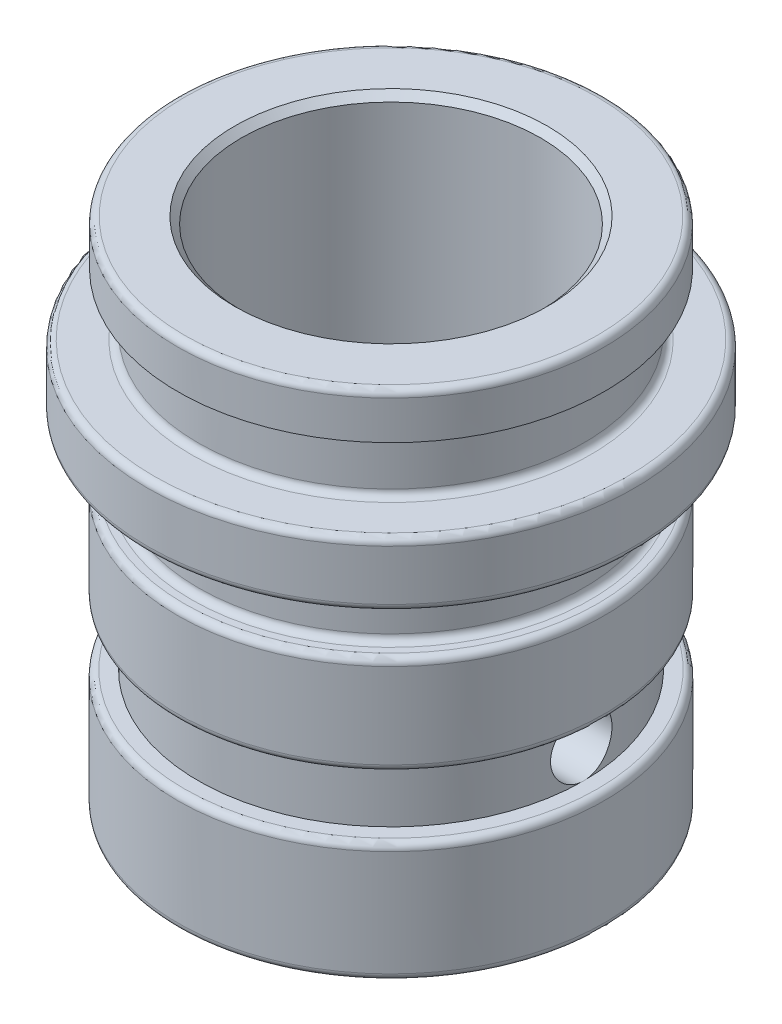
ISO-10303-21;
HEADER;
FILE_DESCRIPTION(('STEP AP214'),'2;1');
FILE_NAME('part.step','',(''),(''),'','','');
FILE_SCHEMA(('AUTOMOTIVE_DESIGN { 1 0 10303 214 1 1 1 1 }'));
ENDSEC;
DATA;
#1=APPLICATION_CONTEXT('core data for automotive mechanical design processes');
#2=APPLICATION_PROTOCOL_DEFINITION('international standard','automotive_design',2000,#1);
#3=PRODUCT_CONTEXT('',#1,'mechanical');
#4=PRODUCT('Part','Part','',(#3));
#5=PRODUCT_RELATED_PRODUCT_CATEGORY('part','',(#4));
#6=PRODUCT_DEFINITION_FORMATION('','',#4);
#7=PRODUCT_DEFINITION_CONTEXT('part definition',#1,'design');
#8=PRODUCT_DEFINITION('design','',#6,#7);
#9=PRODUCT_DEFINITION_SHAPE('','',#8);
#10=(LENGTH_UNIT() NAMED_UNIT(*) SI_UNIT(.MILLI.,.METRE.));
#11=(NAMED_UNIT(*) PLANE_ANGLE_UNIT() SI_UNIT($,.RADIAN.));
#12=(NAMED_UNIT(*) SI_UNIT($,.STERADIAN.) SOLID_ANGLE_UNIT());
#13=UNCERTAINTY_MEASURE_WITH_UNIT(LENGTH_MEASURE(1.E-05),#10,'distance_accuracy_value','');
#14=(GEOMETRIC_REPRESENTATION_CONTEXT(3) GLOBAL_UNCERTAINTY_ASSIGNED_CONTEXT((#13)) GLOBAL_UNIT_ASSIGNED_CONTEXT((#10,
#11,#12)) REPRESENTATION_CONTEXT('',''));
#15=CARTESIAN_POINT('',(0.,0.,0.));
#16=DIRECTION('',(0.,0.,1.));
#17=DIRECTION('',(1.,0.,0.));
#18=AXIS2_PLACEMENT_3D('',#15,#16,#17);
#19=CARTESIAN_POINT('',(0.,0.,0.));
#20=DIRECTION('',(0.,-1.,0.));
#21=DIRECTION('',(0.,0.,-1.));
#22=AXIS2_PLACEMENT_3D('',#19,#20,#21);
#23=CYLINDRICAL_SURFACE('',#22,14.3383);
#24=CARTESIAN_POINT('',(14.3383,13.462,0.));
#25=CARTESIAN_POINT('',(14.3382978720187,13.4619948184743,0.127538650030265));
#26=CARTESIAN_POINT('',(14.3365805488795,13.4512906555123,0.255148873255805));
#27=CARTESIAN_POINT('',(14.3298951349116,13.4087715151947,0.506795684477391));
#28=CARTESIAN_POINT('',(14.324923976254,13.3769366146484,0.63082878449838));
#29=CARTESIAN_POINT('',(14.312288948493,13.2931370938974,0.871643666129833));
#30=CARTESIAN_POINT('',(14.3046272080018,13.2411883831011,0.988431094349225));
#31=CARTESIAN_POINT('',(14.2874553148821,13.1186763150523,1.21161539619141));
#32=CARTESIAN_POINT('',(14.2779453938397,13.04811528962,1.31801356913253));
#33=CARTESIAN_POINT('',(14.2580394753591,12.8897219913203,1.51834959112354));
#34=CARTESIAN_POINT('',(14.2476371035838,12.8017583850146,1.61218298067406));
#35=CARTESIAN_POINT('',(14.227167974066,12.6113395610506,1.78382399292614));
#36=CARTESIAN_POINT('',(14.2171012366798,12.5088834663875,1.86163064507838));
#37=CARTESIAN_POINT('',(14.1983814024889,12.2916773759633,1.9994228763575));
#38=CARTESIAN_POINT('',(14.1897365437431,12.1768617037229,2.05930614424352));
#39=CARTESIAN_POINT('',(14.1749271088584,11.9386406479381,2.15889767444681));
#40=CARTESIAN_POINT('',(14.168762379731,11.8152357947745,2.19860718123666));
#41=CARTESIAN_POINT('',(14.1596743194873,11.5644429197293,2.25639693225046));
#42=CARTESIAN_POINT('',(14.1567240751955,11.4370972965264,2.27465686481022));
#43=CARTESIAN_POINT('',(14.1543174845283,11.1811180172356,2.28958605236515));
#44=CARTESIAN_POINT('',(14.1548609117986,11.0524844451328,2.28625670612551));
#45=CARTESIAN_POINT('',(14.1593556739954,10.7988574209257,2.25824842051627));
#46=CARTESIAN_POINT('',(14.1632749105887,10.6738411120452,2.2337705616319));
#47=CARTESIAN_POINT('',(14.1740294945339,10.4297129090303,2.16447529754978));
#48=CARTESIAN_POINT('',(14.1808649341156,10.3106012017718,2.11965724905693));
#49=CARTESIAN_POINT('',(14.1967167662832,10.0810569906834,2.01074761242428));
#50=CARTESIAN_POINT('',(14.2057426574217,9.9706651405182,1.94657177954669));
#51=CARTESIAN_POINT('',(14.2249516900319,9.76214080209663,1.80082818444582));
#52=CARTESIAN_POINT('',(14.235134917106,9.66400922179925,1.71925913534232));
#53=CARTESIAN_POINT('',(14.2556526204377,9.48162642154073,1.53994531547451));
#54=CARTESIAN_POINT('',(14.2659875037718,9.39754493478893,1.44202785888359));
#55=CARTESIAN_POINT('',(14.2855372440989,9.24698128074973,1.23338278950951));
#56=CARTESIAN_POINT('',(14.2947520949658,9.18049920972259,1.12265510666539));
#57=CARTESIAN_POINT('',(14.3110349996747,9.067009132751,0.891378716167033));
#58=CARTESIAN_POINT('',(14.318101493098,9.02001527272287,0.770822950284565));
#59=CARTESIAN_POINT('',(14.3292787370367,8.94698866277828,0.523392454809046));
#60=CARTESIAN_POINT('',(14.3333897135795,8.92095430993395,0.396518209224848));
#61=CARTESIAN_POINT('',(14.3381625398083,8.89081386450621,0.141516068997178));
#62=CARTESIAN_POINT('',(14.3388610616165,8.88647461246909,0.0134163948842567));
#63=CARTESIAN_POINT('',(14.3368304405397,8.89922715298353,-0.241680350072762));
#64=CARTESIAN_POINT('',(14.3341014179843,8.91631819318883,-0.368677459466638));
#65=CARTESIAN_POINT('',(14.3255450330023,8.97125225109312,-0.617250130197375));
#66=CARTESIAN_POINT('',(14.3197347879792,9.00898065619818,-0.738851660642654));
#67=CARTESIAN_POINT('',(14.3056650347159,9.10399688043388,-0.974003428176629));
#68=CARTESIAN_POINT('',(14.2974053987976,9.16128571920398,-1.08755324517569));
#69=CARTESIAN_POINT('',(14.2792627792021,9.29433639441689,-1.30439667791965));
#70=CARTESIAN_POINT('',(14.2693671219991,9.37024488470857,-1.40759922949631));
#71=CARTESIAN_POINT('',(14.2490906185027,9.53817727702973,-1.59988404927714));
#72=CARTESIAN_POINT('',(14.2387097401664,9.63020224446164,-1.68896538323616));
#73=CARTESIAN_POINT('',(14.2185152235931,9.82879765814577,-1.85133627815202));
#74=CARTESIAN_POINT('',(14.2087078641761,9.93549719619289,-1.92446884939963));
#75=CARTESIAN_POINT('',(14.1908853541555,10.1598035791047,-2.05177216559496));
#76=CARTESIAN_POINT('',(14.1828701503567,10.2774101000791,-2.10594347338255));
#77=CARTESIAN_POINT('',(14.1695858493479,10.519740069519,-2.19354792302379));
#78=CARTESIAN_POINT('',(14.1643061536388,10.6444339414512,-2.22706119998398));
#79=CARTESIAN_POINT('',(14.157063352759,10.8977715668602,-2.27265177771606));
#80=CARTESIAN_POINT('',(14.1550999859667,11.0264150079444,-2.28473076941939));
#81=CARTESIAN_POINT('',(14.1547227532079,11.2824337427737,-2.28706582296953));
#82=CARTESIAN_POINT('',(14.1562687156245,11.4098067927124,-2.27756886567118));
#83=CARTESIAN_POINT('',(14.1626482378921,11.6611186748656,-2.23755352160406));
#84=CARTESIAN_POINT('',(14.1674817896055,11.7850575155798,-2.2070351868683));
#85=CARTESIAN_POINT('',(14.1798771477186,12.025899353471,-2.12593479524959));
#86=CARTESIAN_POINT('',(14.1874363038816,12.1428090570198,-2.07537222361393));
#87=CARTESIAN_POINT('',(14.2044339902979,12.3665261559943,-1.95564362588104));
#88=CARTESIAN_POINT('',(14.2138726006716,12.4733331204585,-1.88647680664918));
#89=CARTESIAN_POINT('',(14.2336938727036,12.6750638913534,-1.73061451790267));
#90=CARTESIAN_POINT('',(14.2440856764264,12.7698459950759,-1.64373678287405));
#91=CARTESIAN_POINT('',(14.2645680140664,12.943572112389,-1.45530376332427));
#92=CARTESIAN_POINT('',(14.2746584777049,13.0225124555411,-1.35374508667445));
#93=CARTESIAN_POINT('',(14.2934740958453,13.162762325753,-1.13807937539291));
#94=CARTESIAN_POINT('',(14.3021902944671,13.2239582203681,-1.02389766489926));
#95=CARTESIAN_POINT('',(14.3171879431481,13.3262088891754,-0.786786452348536));
#96=CARTESIAN_POINT('',(14.3234718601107,13.3672840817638,-0.663865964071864));
#97=CARTESIAN_POINT('',(14.3314973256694,13.4190312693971,-0.450361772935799));
#98=CARTESIAN_POINT('',(14.3340349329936,13.4351192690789,-0.361081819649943));
#99=CARTESIAN_POINT('',(14.3374370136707,13.4566053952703,-0.181213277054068));
#100=CARTESIAN_POINT('',(14.3383015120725,13.4620036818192,-0.0906247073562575));
#101=CARTESIAN_POINT('',(14.3383,13.462,0.));
#102=B_SPLINE_CURVE_WITH_KNOTS('',3,(#24,#25,#26,#27,#28,#29,#30,#31,#32,#33,#34,#35,#36,#37,
#38,#39,#40,#41,#42,#43,#44,#45,#46,#47,#48,#49,#50,#51,#52,#53,#54,#55,#56,#57,#58,#59,#60,#61,
#62,#63,#64,#65,#66,#67,#68,#69,#70,#71,#72,#73,#74,#75,#76,#77,#78,#79,#80,#81,#82,#83,#84,#85,
#86,#87,#88,#89,#90,#91,#92,#93,#94,#95,#96,#97,#98,#99,#100,#101),.UNSPECIFIED.,.T.,.F.,(4,2,2,
2,2,2,2,2,2,2,2,2,2,2,2,2,2,2,2,2,2,2,2,2,2,2,2,2,2,2,2,2,2,2,2,2,2,2,4),(0.,0.382284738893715,
0.764930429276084,1.14727407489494,1.52956984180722,1.91486904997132,2.30019158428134,
2.68767343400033,3.07513137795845,3.4593198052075,3.84348334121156,4.22403394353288,
4.60459658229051,4.9868399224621,5.36911155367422,5.75571127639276,6.14231311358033,
6.52919508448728,6.91604746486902,7.2987332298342,7.68140556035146,8.06197392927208,
8.44256213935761,8.8262500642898,9.20996336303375,9.59729841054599,9.98462195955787,
10.3704334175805,10.7562144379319,11.1376016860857,11.518987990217,11.9000044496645,
12.2810371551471,12.6662093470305,13.0514706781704,13.4391472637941,13.8264296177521,
14.0980724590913,14.3697112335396),.UNSPECIFIED.);
#103=CARTESIAN_POINT('',(14.2661254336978,12.954,1.43684097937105));
#104=VERTEX_POINT('',#103);
#105=CARTESIAN_POINT('',(14.3383,8.89,0.));
#106=VERTEX_POINT('',#105);
#107=EDGE_CURVE('E116',#104,#106,#102,.T.);
#108=ORIENTED_EDGE('',*,*,#107,.F.);
#109=CARTESIAN_POINT('',(0.,12.954,0.));
#110=DIRECTION('',(0.,-1.,0.));
#111=DIRECTION('',(0.,0.,-1.));
#112=AXIS2_PLACEMENT_3D('',#109,#110,#111);
#113=CIRCLE('',#112,14.3383);
#114=CARTESIAN_POINT('',(-14.2661254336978,12.954,1.43684097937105));
#115=VERTEX_POINT('',#114);
#116=EDGE_CURVE('E46',#104,#115,#113,.T.);
#117=ORIENTED_EDGE('',*,*,#116,.T.);
#118=CARTESIAN_POINT('',(-14.3383,13.462,0.));
#119=CARTESIAN_POINT('',(-14.3382978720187,13.4619948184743,-0.127538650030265));
#120=CARTESIAN_POINT('',(-14.3365805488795,13.4512906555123,-0.255148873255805));
#121=CARTESIAN_POINT('',(-14.3298951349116,13.4087715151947,-0.506795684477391));
#122=CARTESIAN_POINT('',(-14.324923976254,13.3769366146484,-0.63082878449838));
#123=CARTESIAN_POINT('',(-14.312288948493,13.2931370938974,-0.871643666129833));
#124=CARTESIAN_POINT('',(-14.3046272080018,13.2411883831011,-0.988431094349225));
#125=CARTESIAN_POINT('',(-14.2874553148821,13.1186763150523,-1.21161539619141));
#126=CARTESIAN_POINT('',(-14.2779453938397,13.04811528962,-1.31801356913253));
#127=CARTESIAN_POINT('',(-14.2580394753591,12.8897219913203,-1.51834959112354));
#128=CARTESIAN_POINT('',(-14.2476371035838,12.8017583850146,-1.61218298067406));
#129=CARTESIAN_POINT('',(-14.227167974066,12.6113395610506,-1.78382399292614));
#130=CARTESIAN_POINT('',(-14.2171012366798,12.5088834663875,-1.86163064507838));
#131=CARTESIAN_POINT('',(-14.1983814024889,12.2916773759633,-1.9994228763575));
#132=CARTESIAN_POINT('',(-14.1897365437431,12.1768617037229,-2.05930614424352));
#133=CARTESIAN_POINT('',(-14.1749271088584,11.9386406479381,-2.15889767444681));
#134=CARTESIAN_POINT('',(-14.168762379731,11.8152357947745,-2.19860718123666));
#135=CARTESIAN_POINT('',(-14.1596743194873,11.5644429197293,-2.25639693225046));
#136=CARTESIAN_POINT('',(-14.1567240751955,11.4370972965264,-2.27465686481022));
#137=CARTESIAN_POINT('',(-14.1543174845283,11.1811180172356,-2.28958605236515));
#138=CARTESIAN_POINT('',(-14.1548609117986,11.0524844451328,-2.28625670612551));
#139=CARTESIAN_POINT('',(-14.1593556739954,10.7988574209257,-2.25824842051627));
#140=CARTESIAN_POINT('',(-14.1632749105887,10.6738411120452,-2.2337705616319));
#141=CARTESIAN_POINT('',(-14.1740294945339,10.4297129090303,-2.16447529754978));
#142=CARTESIAN_POINT('',(-14.1808649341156,10.3106012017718,-2.11965724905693));
#143=CARTESIAN_POINT('',(-14.1967167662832,10.0810569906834,-2.01074761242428));
#144=CARTESIAN_POINT('',(-14.2057426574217,9.9706651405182,-1.94657177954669));
#145=CARTESIAN_POINT('',(-14.2249516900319,9.76214080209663,-1.80082818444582));
#146=CARTESIAN_POINT('',(-14.235134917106,9.66400922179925,-1.71925913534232));
#147=CARTESIAN_POINT('',(-14.2556526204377,9.48162642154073,-1.53994531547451));
#148=CARTESIAN_POINT('',(-14.2659875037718,9.39754493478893,-1.44202785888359));
#149=CARTESIAN_POINT('',(-14.2855372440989,9.24698128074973,-1.23338278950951));
#150=CARTESIAN_POINT('',(-14.2947520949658,9.18049920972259,-1.12265510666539));
#151=CARTESIAN_POINT('',(-14.3110349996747,9.067009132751,-0.891378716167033));
#152=CARTESIAN_POINT('',(-14.318101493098,9.02001527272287,-0.770822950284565));
#153=CARTESIAN_POINT('',(-14.3292787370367,8.94698866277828,-0.523392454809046));
#154=CARTESIAN_POINT('',(-14.3333897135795,8.92095430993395,-0.396518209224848));
#155=CARTESIAN_POINT('',(-14.3381625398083,8.89081386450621,-0.141516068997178));
#156=CARTESIAN_POINT('',(-14.3388610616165,8.88647461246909,-0.0134163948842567));
#157=CARTESIAN_POINT('',(-14.3368304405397,8.89922715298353,0.241680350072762));
#158=CARTESIAN_POINT('',(-14.3341014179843,8.91631819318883,0.368677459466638));
#159=CARTESIAN_POINT('',(-14.3255450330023,8.97125225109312,0.617250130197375));
#160=CARTESIAN_POINT('',(-14.3197347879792,9.00898065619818,0.738851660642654));
#161=CARTESIAN_POINT('',(-14.3056650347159,9.10399688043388,0.974003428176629));
#162=CARTESIAN_POINT('',(-14.2974053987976,9.16128571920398,1.08755324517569));
#163=CARTESIAN_POINT('',(-14.2792627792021,9.29433639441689,1.30439667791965));
#164=CARTESIAN_POINT('',(-14.2693671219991,9.37024488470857,1.40759922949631));
#165=CARTESIAN_POINT('',(-14.2490906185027,9.53817727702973,1.59988404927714));
#166=CARTESIAN_POINT('',(-14.2387097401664,9.63020224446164,1.68896538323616));
#167=CARTESIAN_POINT('',(-14.2185152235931,9.82879765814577,1.85133627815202));
#168=CARTESIAN_POINT('',(-14.2087078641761,9.93549719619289,1.92446884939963));
#169=CARTESIAN_POINT('',(-14.1908853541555,10.1598035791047,2.05177216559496));
#170=CARTESIAN_POINT('',(-14.1828701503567,10.2774101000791,2.10594347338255));
#171=CARTESIAN_POINT('',(-14.1695858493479,10.519740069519,2.19354792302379));
#172=CARTESIAN_POINT('',(-14.1643061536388,10.6444339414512,2.22706119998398));
#173=CARTESIAN_POINT('',(-14.157063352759,10.8977715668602,2.27265177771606));
#174=CARTESIAN_POINT('',(-14.1550999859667,11.0264150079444,2.28473076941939));
#175=CARTESIAN_POINT('',(-14.1547227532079,11.2824337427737,2.28706582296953));
#176=CARTESIAN_POINT('',(-14.1562687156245,11.4098067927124,2.27756886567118));
#177=CARTESIAN_POINT('',(-14.1626482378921,11.6611186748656,2.23755352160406));
#178=CARTESIAN_POINT('',(-14.1674817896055,11.7850575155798,2.2070351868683));
#179=CARTESIAN_POINT('',(-14.1798771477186,12.025899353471,2.12593479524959));
#180=CARTESIAN_POINT('',(-14.1874363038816,12.1428090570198,2.07537222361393));
#181=CARTESIAN_POINT('',(-14.2044339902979,12.3665261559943,1.95564362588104));
#182=CARTESIAN_POINT('',(-14.2138726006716,12.4733331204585,1.88647680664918));
#183=CARTESIAN_POINT('',(-14.2336938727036,12.6750638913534,1.73061451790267));
#184=CARTESIAN_POINT('',(-14.2440856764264,12.7698459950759,1.64373678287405));
#185=CARTESIAN_POINT('',(-14.2645680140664,12.943572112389,1.45530376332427));
#186=CARTESIAN_POINT('',(-14.2746584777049,13.0225124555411,1.35374508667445));
#187=CARTESIAN_POINT('',(-14.2934740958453,13.162762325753,1.13807937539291));
#188=CARTESIAN_POINT('',(-14.3021902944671,13.2239582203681,1.02389766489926));
#189=CARTESIAN_POINT('',(-14.3171879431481,13.3262088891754,0.786786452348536));
#190=CARTESIAN_POINT('',(-14.3234718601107,13.3672840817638,0.663865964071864));
#191=CARTESIAN_POINT('',(-14.3314973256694,13.4190312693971,0.450361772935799));
#192=CARTESIAN_POINT('',(-14.3340349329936,13.4351192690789,0.361081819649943));
#193=CARTESIAN_POINT('',(-14.3374370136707,13.4566053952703,0.181213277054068));
#194=CARTESIAN_POINT('',(-14.3383015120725,13.4620036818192,0.0906247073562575));
#195=CARTESIAN_POINT('',(-14.3383,13.462,0.));
#196=B_SPLINE_CURVE_WITH_KNOTS('',3,(#118,#119,#120,#121,#122,#123,#124,#125,#126,#127,#128,
#129,#130,#131,#132,#133,#134,#135,#136,#137,#138,#139,#140,#141,#142,#143,#144,#145,#146,#147,
#148,#149,#150,#151,#152,#153,#154,#155,#156,#157,#158,#159,#160,#161,#162,#163,#164,#165,#166,
#167,#168,#169,#170,#171,#172,#173,#174,#175,#176,#177,#178,#179,#180,#181,#182,#183,#184,#185,
#186,#187,#188,#189,#190,#191,#192,#193,#194,#195),.UNSPECIFIED.,.T.,.F.,(4,2,2,2,2,2,2,2,2,2,2,
2,2,2,2,2,2,2,2,2,2,2,2,2,2,2,2,2,2,2,2,2,2,2,2,2,2,2,4),(0.,0.382284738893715,
0.764930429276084,1.14727407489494,1.52956984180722,1.91486904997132,2.30019158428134,
2.68767343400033,3.07513137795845,3.4593198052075,3.84348334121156,4.22403394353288,
4.60459658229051,4.9868399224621,5.36911155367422,5.75571127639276,6.14231311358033,
6.52919508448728,6.91604746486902,7.2987332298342,7.68140556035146,8.06197392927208,
8.44256213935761,8.8262500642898,9.20996336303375,9.59729841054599,9.98462195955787,
10.3704334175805,10.7562144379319,11.1376016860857,11.518987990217,11.9000044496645,
12.2810371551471,12.6662093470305,13.0514706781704,13.4391472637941,13.8264296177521,
14.0980724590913,14.3697112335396),.UNSPECIFIED.);
#197=CARTESIAN_POINT('',(-14.3383,8.89,0.));
#198=VERTEX_POINT('',#197);
#199=EDGE_CURVE('E125',#198,#115,#196,.T.);
#200=ORIENTED_EDGE('',*,*,#199,.F.);
#201=CARTESIAN_POINT('',(0.,8.89,0.));
#202=DIRECTION('',(0.,-1.,0.));
#203=DIRECTION('',(0.,0.,-1.));
#204=AXIS2_PLACEMENT_3D('',#201,#202,#203);
#205=CIRCLE('',#204,14.3383);
#206=EDGE_CURVE('E537',#106,#198,#205,.T.);
#207=ORIENTED_EDGE('',*,*,#206,.F.);
#208=EDGE_LOOP('',(#108,#117,#200,#207));
#209=FACE_BOUND('',#208,.T.);
#210=ADVANCED_FACE('F32',(#209),#23,.T.);
#211=CARTESIAN_POINT('',(15.88135,0.,0.));
#212=DIRECTION('',(0.,-1.,0.));
#213=DIRECTION('',(0.,0.,-1.));
#214=AXIS2_PLACEMENT_3D('',#211,#212,#213);
#215=PLANE('',#214);
#216=CARTESIAN_POINT('',(0.,0.,0.));
#217=DIRECTION('',(0.,-1.,0.));
#218=DIRECTION('',(0.,0.,-1.));
#219=AXIS2_PLACEMENT_3D('',#216,#217,#218);
#220=CIRCLE('',#219,11.6332);
#221=CARTESIAN_POINT('',(0.,0.,-11.6332));
#222=VERTEX_POINT('',#221);
#223=EDGE_CURVE('E276',#222,#222,#220,.F.);
#224=ORIENTED_EDGE('',*,*,#223,.T.);
#225=EDGE_LOOP('',(#224));
#226=FACE_BOUND('',#225,.T.);
#227=CARTESIAN_POINT('',(0.,0.,0.));
#228=DIRECTION('',(0.,-1.,0.));
#229=DIRECTION('',(0.,0.,-1.));
#230=AXIS2_PLACEMENT_3D('',#227,#228,#229);
#231=CIRCLE('',#230,15.37335);
#232=CARTESIAN_POINT('',(0.,0.,-15.37335));
#233=VERTEX_POINT('',#232);
#234=EDGE_CURVE('E273',#233,#233,#231,.T.);
#235=ORIENTED_EDGE('',*,*,#234,.T.);
#236=EDGE_LOOP('',(#235));
#237=FACE_BOUND('',#236,.T.);
#238=ADVANCED_FACE('F364',(#226,#237),#215,.T.);
#239=CARTESIAN_POINT('',(0.,0.,0.));
#240=DIRECTION('',(0.,-1.,0.));
#241=DIRECTION('',(0.,0.,-1.));
#242=AXIS2_PLACEMENT_3D('',#239,#240,#241);
#243=CYLINDRICAL_SURFACE('',#242,15.88135);
#244=CARTESIAN_POINT('',(0.,8.382,0.));
#245=DIRECTION('',(0.,1.,0.));
#246=DIRECTION('',(0.,0.,1.));
#247=AXIS2_PLACEMENT_3D('',#244,#245,#246);
#248=CIRCLE('',#247,15.88135);
#249=CARTESIAN_POINT('',(0.,8.382,15.88135));
#250=VERTEX_POINT('',#249);
#251=EDGE_CURVE('E267',#250,#250,#248,.F.);
#252=ORIENTED_EDGE('',*,*,#251,.T.);
#253=EDGE_LOOP('',(#252));
#254=FACE_BOUND('',#253,.T.);
#255=CARTESIAN_POINT('',(0.,0.508,0.));
#256=DIRECTION('',(0.,-1.,0.));
#257=DIRECTION('',(0.,0.,-1.));
#258=AXIS2_PLACEMENT_3D('',#255,#256,#257);
#259=CIRCLE('',#258,15.88135);
#260=CARTESIAN_POINT('',(0.,0.508,-15.88135));
#261=VERTEX_POINT('',#260);
#262=EDGE_CURVE('E264',#261,#261,#259,.F.);
#263=ORIENTED_EDGE('',*,*,#262,.T.);
#264=EDGE_LOOP('',(#263));
#265=FACE_BOUND('',#264,.T.);
#266=ADVANCED_FACE('F368',(#254,#265),#243,.T.);
#267=CARTESIAN_POINT('',(15.88135,8.89,0.));
#268=DIRECTION('',(0.,1.,0.));
#269=DIRECTION('',(0.,0.,1.));
#270=AXIS2_PLACEMENT_3D('',#267,#268,#269);
#271=PLANE('',#270);
#272=CARTESIAN_POINT('',(0.,8.89,0.));
#273=DIRECTION('',(0.,1.,0.));
#274=DIRECTION('',(0.,0.,1.));
#275=AXIS2_PLACEMENT_3D('',#272,#273,#274);
#276=CIRCLE('',#275,15.37335);
#277=CARTESIAN_POINT('',(0.,8.89,15.37335));
#278=VERTEX_POINT('',#277);
#279=EDGE_CURVE('E270',#278,#278,#276,.T.);
#280=ORIENTED_EDGE('',*,*,#279,.T.);
#281=EDGE_LOOP('',(#280));
#282=FACE_BOUND('',#281,.T.);
#283=ORIENTED_EDGE('',*,*,#206,.T.);
#284=EDGE_CURVE('E383',#198,#106,#205,.T.);
#285=ORIENTED_EDGE('',*,*,#284,.T.);
#286=EDGE_LOOP('',(#283,#285));
#287=FACE_BOUND('',#286,.T.);
#288=ADVANCED_FACE('F372',(#282,#287),#271,.T.);
#289=CARTESIAN_POINT('',(-14.2661254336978,12.954,-1.43684097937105));
#290=VERTEX_POINT('',#289);
#291=EDGE_CURVE('E127',#290,#198,#196,.T.);
#292=ORIENTED_EDGE('',*,*,#291,.F.);
#293=CARTESIAN_POINT('',(0.,12.954,0.));
#294=DIRECTION('',(0.,-1.,0.));
#295=DIRECTION('',(0.,0.,-1.));
#296=AXIS2_PLACEMENT_3D('',#293,#294,#295);
#297=CIRCLE('',#296,14.3383);
#298=CARTESIAN_POINT('',(14.2661254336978,12.954,-1.43684097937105));
#299=VERTEX_POINT('',#298);
#300=EDGE_CURVE('E100',#290,#299,#297,.T.);
#301=ORIENTED_EDGE('',*,*,#300,.T.);
#302=EDGE_CURVE('E111',#106,#299,#102,.T.);
#303=ORIENTED_EDGE('',*,*,#302,.F.);
#304=ORIENTED_EDGE('',*,*,#284,.F.);
#305=EDGE_LOOP('',(#292,#301,#303,#304));
#306=FACE_BOUND('',#305,.T.);
#307=ADVANCED_FACE('F135',(#306),#23,.T.);
#308=CARTESIAN_POINT('',(14.3383,13.462,0.));
#309=DIRECTION('',(0.,-1.,0.));
#310=DIRECTION('',(0.,0.,-1.));
#311=AXIS2_PLACEMENT_3D('',#308,#309,#310);
#312=PLANE('',#311);
#313=CARTESIAN_POINT('',(0.,13.462,0.));
#314=DIRECTION('',(0.,-1.,0.));
#315=DIRECTION('',(0.,0.,-1.));
#316=AXIS2_PLACEMENT_3D('',#313,#314,#315);
#317=CIRCLE('',#316,15.37335);
#318=CARTESIAN_POINT('',(0.,13.462,-15.37335));
#319=VERTEX_POINT('',#318);
#320=EDGE_CURVE('E120',#319,#319,#317,.T.);
#321=ORIENTED_EDGE('',*,*,#320,.T.);
#322=EDGE_LOOP('',(#321));
#323=FACE_BOUND('',#322,.T.);
#324=CARTESIAN_POINT('',(14.6911692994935,13.462,1.80317628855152));
#325=CARTESIAN_POINT('',(14.0620761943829,13.462,1.5218761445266));
#326=CARTESIAN_POINT('',(14.2481763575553,12.8037220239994,1.60509117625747));
#327=CARTESIAN_POINT('',(14.7135037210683,13.462,1.75302297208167));
#328=CARTESIAN_POINT('',(14.0973227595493,13.462,1.5275318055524));
#329=CARTESIAN_POINT('',(14.2508688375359,12.8273125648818,1.5811725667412));
#330=CARTESIAN_POINT('',(14.7309255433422,13.462,1.70105180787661));
#331=CARTESIAN_POINT('',(14.1342148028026,13.462,1.52128760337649));
#332=CARTESIAN_POINT('',(14.2537454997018,12.8519639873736,1.5551120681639));
#333=CARTESIAN_POINT('',(14.75717567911,13.462,1.59551637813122));
#334=CARTESIAN_POINT('',(14.2034813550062,13.462,1.49053892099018));
#335=CARTESIAN_POINT('',(14.2597518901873,12.9022875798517,1.49904195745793));
#336=CARTESIAN_POINT('',(14.7660921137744,13.462,1.54197450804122));
#337=CARTESIAN_POINT('',(14.2361721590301,13.462,1.46719979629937));
#338=CARTESIAN_POINT('',(14.2628786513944,12.9279463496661,1.46907658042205));
#339=CARTESIAN_POINT('',(14.7799732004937,13.462,1.40452139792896));
#340=CARTESIAN_POINT('',(14.3092196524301,13.462,1.39316511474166));
#341=CARTESIAN_POINT('',(14.2711084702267,12.9939848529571,1.38736992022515));
#342=CARTESIAN_POINT('',(14.7800478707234,13.462,1.32014345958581));
#343=CARTESIAN_POINT('',(14.3467617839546,13.462,1.3343664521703));
#344=CARTESIAN_POINT('',(14.2763505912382,13.0346803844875,1.33273213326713));
#345=CARTESIAN_POINT('',(14.7705922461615,13.462,1.19424400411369));
#346=CARTESIAN_POINT('',(14.390034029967,13.462,1.23359229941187));
#347=CARTESIAN_POINT('',(14.2843103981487,13.0945633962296,1.24345911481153));
#348=CARTESIAN_POINT('',(14.7658109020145,13.462,1.15223799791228));
#349=CARTESIAN_POINT('',(14.4022286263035,13.462,1.19861275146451));
#350=CARTESIAN_POINT('',(14.2869896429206,13.1144006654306,1.21235608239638));
#351=CARTESIAN_POINT('',(14.7534299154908,13.462,1.06865436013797));
#352=CARTESIAN_POINT('',(14.4225795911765,13.462,1.12611659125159));
#353=CARTESIAN_POINT('',(14.2923254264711,13.1533423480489,1.14775033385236));
#354=CARTESIAN_POINT('',(14.745831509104,13.462,1.0270765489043));
#355=CARTESIAN_POINT('',(14.4308709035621,13.462,1.08859234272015));
#356=CARTESIAN_POINT('',(14.2949819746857,13.1724470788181,1.11424867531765));
#357=CARTESIAN_POINT('',(14.7186265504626,13.462,0.899624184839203));
#358=CARTESIAN_POINT('',(14.4504918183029,13.462,0.971724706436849));
#359=CARTESIAN_POINT('',(14.3030588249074,13.2297586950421,1.00726080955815));
#360=CARTESIAN_POINT('',(14.6949341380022,13.462,0.814613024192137));
#361=CARTESIAN_POINT('',(14.4565854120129,13.462,0.887571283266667));
#362=CARTESIAN_POINT('',(14.3083518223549,13.2662111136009,0.929815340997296));
#363=CARTESIAN_POINT('',(14.6535140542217,13.462,0.689039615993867));
#364=CARTESIAN_POINT('',(14.456366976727,13.462,0.758144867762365));
#365=CARTESIAN_POINT('',(14.3156495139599,13.3154091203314,0.806641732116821));
#366=CARTESIAN_POINT('',(14.6387038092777,13.462,0.647452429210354));
#367=CARTESIAN_POINT('',(14.4548186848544,13.462,0.714877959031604));
#368=CARTESIAN_POINT('',(14.3179777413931,13.3309117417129,0.764356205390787));
#369=CARTESIAN_POINT('',(14.6074176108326,13.462,0.564916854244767));
#370=CARTESIAN_POINT('',(14.4491500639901,13.462,0.627903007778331));
#371=CARTESIAN_POINT('',(14.3223442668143,13.3597312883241,0.67764966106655));
#372=CARTESIAN_POINT('',(14.5909421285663,13.462,0.523968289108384));
#373=CARTESIAN_POINT('',(14.4450632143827,13.462,0.584082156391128));
#374=CARTESIAN_POINT('',(14.3243826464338,13.3730488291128,0.633229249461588));
#375=CARTESIAN_POINT('',(14.5565914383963,13.462,0.442651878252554));
#376=CARTESIAN_POINT('',(14.4347498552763,13.462,0.496223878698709));
#377=CARTESIAN_POINT('',(14.3281046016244,13.3971883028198,0.542513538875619));
#378=CARTESIAN_POINT('',(14.538715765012,13.462,0.402284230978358));
#379=CARTESIAN_POINT('',(14.4285349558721,13.462,0.452062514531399));
#380=CARTESIAN_POINT('',(14.3297880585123,13.4080094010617,0.496217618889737));
#381=CARTESIAN_POINT('',(14.5110403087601,13.462,0.342120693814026));
#382=CARTESIAN_POINT('',(14.4179047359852,13.462,0.385589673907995));
#383=CARTESIAN_POINT('',(14.3320024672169,13.4221667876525,0.425566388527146));
#384=CARTESIAN_POINT('',(14.501669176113,13.462,0.322126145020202));
#385=CARTESIAN_POINT('',(14.4141544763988,13.462,0.363444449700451));
#386=CARTESIAN_POINT('',(14.3326889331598,13.42654099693,0.401808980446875));
#387=CARTESIAN_POINT('',(14.4826747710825,13.462,0.282259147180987));
#388=CARTESIAN_POINT('',(14.406279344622,13.462,0.319132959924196));
#389=CARTESIAN_POINT('',(14.3339505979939,13.4345630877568,0.353945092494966));
#390=CARTESIAN_POINT('',(14.4730515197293,13.462,0.262386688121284));
#391=CARTESIAN_POINT('',(14.40215303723,13.462,0.296949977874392));
#392=CARTESIAN_POINT('',(14.3345258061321,13.4382110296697,0.329838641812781));
#393=CARTESIAN_POINT('',(14.4535954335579,13.462,0.222782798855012));
#394=CARTESIAN_POINT('',(14.3935824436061,13.462,0.252611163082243));
#395=CARTESIAN_POINT('',(14.3355587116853,13.4447483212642,0.281370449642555));
#396=CARTESIAN_POINT('',(14.4437629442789,13.462,0.203051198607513));
#397=CARTESIAN_POINT('',(14.3891364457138,13.462,0.230438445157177));
#398=CARTESIAN_POINT('',(14.3360165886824,13.4476388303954,0.2570091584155));
#399=CARTESIAN_POINT('',(14.4238992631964,13.462,0.163683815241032));
#400=CARTESIAN_POINT('',(14.3799697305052,13.462,0.186086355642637));
#401=CARTESIAN_POINT('',(14.3368113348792,13.4526469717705,0.208033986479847));
#402=CARTESIAN_POINT('',(14.4138680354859,13.462,0.144048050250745));
#403=CARTESIAN_POINT('',(14.3752460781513,13.462,0.163889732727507));
#404=CARTESIAN_POINT('',(14.3371481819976,13.4547644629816,0.183420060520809));
#405=CARTESIAN_POINT('',(14.398696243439,13.462,0.114666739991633));
#406=CARTESIAN_POINT('',(14.3679902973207,13.462,0.130589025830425));
#407=CARTESIAN_POINT('',(14.3375591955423,13.4573449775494,0.146358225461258));
#408=CARTESIAN_POINT('',(14.3936197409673,13.462,0.104888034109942));
#409=CARTESIAN_POINT('',(14.3655450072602,13.462,0.119495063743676));
#410=CARTESIAN_POINT('',(14.3376804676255,13.4581057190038,0.133984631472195));
#411=CARTESIAN_POINT('',(14.3834269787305,13.462,0.0853500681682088));
#412=CARTESIAN_POINT('',(14.3606037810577,13.462,0.0973044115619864));
#413=CARTESIAN_POINT('',(14.3378911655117,13.4594269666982,0.109192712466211));
#414=CARTESIAN_POINT('',(14.3783107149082,13.462,0.0755908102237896));
#415=CARTESIAN_POINT('',(14.3581073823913,13.462,0.0862055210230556));
#416=CARTESIAN_POINT('',(14.33798058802,13.4599874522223,0.0967743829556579));
#417=CARTESIAN_POINT('',(14.3706097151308,13.462,0.0609684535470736));
#418=CARTESIAN_POINT('',(14.3543293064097,13.462,0.0695569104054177));
#419=CARTESIAN_POINT('',(14.3380904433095,13.4606763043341,0.0781220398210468));
#420=CARTESIAN_POINT('',(14.3680388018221,13.462,0.056098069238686));
#421=CARTESIAN_POINT('',(14.353064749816,13.462,0.0640089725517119));
#422=CARTESIAN_POINT('',(14.3381230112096,13.4608805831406,0.0719017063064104));
#423=CARTESIAN_POINT('',(14.3628890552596,13.462,0.0463610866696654));
#424=CARTESIAN_POINT('',(14.3505256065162,13.462,0.0529116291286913));
#425=CARTESIAN_POINT('',(14.338180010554,13.4612383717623,0.0594516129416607));
#426=CARTESIAN_POINT('',(14.3603102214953,13.462,0.0414944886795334));
#427=CARTESIAN_POINT('',(14.3492509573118,13.462,0.0473619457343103));
#428=CARTESIAN_POINT('',(14.3382044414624,13.4613918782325,0.0532218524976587));
#429=CARTESIAN_POINT('',(14.3551416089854,13.462,0.0317688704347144));
#430=CARTESIAN_POINT('',(14.3466906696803,13.462,0.036265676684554));
#431=CARTESIAN_POINT('',(14.3382450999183,13.4616478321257,0.0407588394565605));
#432=CARTESIAN_POINT('',(14.3525518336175,13.462,0.0269098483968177));
#433=CARTESIAN_POINT('',(14.3454049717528,13.462,0.0307188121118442));
#434=CARTESIAN_POINT('',(14.3382613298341,13.4617502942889,0.0345255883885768));
#435=CARTESIAN_POINT('',(14.3486711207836,13.462,0.0196200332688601));
#436=CARTESIAN_POINT('',(14.343474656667,13.462,0.0223928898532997));
#437=CARTESIAN_POINT('',(14.3382794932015,13.4618656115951,0.0251649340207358));
#438=CARTESIAN_POINT('',(14.3473783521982,13.462,0.0171901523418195));
#439=CARTESIAN_POINT('',(14.3428310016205,13.462,0.0196169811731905));
#440=CARTESIAN_POINT('',(14.3382845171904,13.4618976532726,0.0220432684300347));
#441=CARTESIAN_POINT('',(14.3454246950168,13.462,0.0135531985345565));
#442=CARTESIAN_POINT('',(14.3418573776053,13.462,0.0154610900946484));
#443=CARTESIAN_POINT('',(14.3382904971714,13.4619360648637,0.0173687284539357));
#444=CARTESIAN_POINT('',(14.3447711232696,13.462,0.0123423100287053));
#445=CARTESIAN_POINT('',(14.3415315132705,13.462,0.0140772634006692));
#446=CARTESIAN_POINT('',(14.338292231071,13.4619472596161,0.0158120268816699));
#447=CARTESIAN_POINT('',(14.3438087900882,13.462,0.010516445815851));
#448=CARTESIAN_POINT('',(14.341051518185,13.462,0.0119903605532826));
#449=CARTESIAN_POINT('',(14.3382944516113,13.4619616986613,0.0134641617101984));
#450=CARTESIAN_POINT('',(14.3434909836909,13.462,0.00990617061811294));
#451=CARTESIAN_POINT('',(14.3408929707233,13.462,0.0112927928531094));
#452=CARTESIAN_POINT('',(14.3382951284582,13.4619661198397,0.0126793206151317));
#453=CARTESIAN_POINT('',(14.3429879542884,13.462,0.00900419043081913));
#454=CARTESIAN_POINT('',(14.3406419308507,13.462,0.010261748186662));
#455=CARTESIAN_POINT('',(14.3382960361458,13.4619720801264,0.0115192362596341));
#456=CARTESIAN_POINT('',(14.3428158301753,13.462,0.00870567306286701));
#457=CARTESIAN_POINT('',(14.3405560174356,13.462,0.00992050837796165));
#458=CARTESIAN_POINT('',(14.3382963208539,13.4619739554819,0.0111352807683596));
#459=CARTESIAN_POINT('',(14.3425943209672,13.462,0.00823838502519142));
#460=CARTESIAN_POINT('',(14.3404454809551,13.462,0.00938630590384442));
#461=CARTESIAN_POINT('',(14.338296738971,13.4619767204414,0.0105341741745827));
#462=CARTESIAN_POINT('',(14.342526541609,13.462,0.0080791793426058));
#463=CARTESIAN_POINT('',(14.3404116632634,13.462,0.00920429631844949));
#464=CARTESIAN_POINT('',(14.3382968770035,13.4619776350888,0.0103293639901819));
#465=CARTESIAN_POINT('',(14.3423722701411,13.462,0.00786698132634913));
#466=CARTESIAN_POINT('',(14.3403346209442,13.462,0.00896172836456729));
#467=CARTESIAN_POINT('',(14.3382970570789,13.4619788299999,0.0100564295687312));
#468=CARTESIAN_POINT('',(14.3423117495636,13.462,0.00780048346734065));
#469=CARTESIAN_POINT('',(14.3403043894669,13.462,0.00888571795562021));
#470=CARTESIAN_POINT('',(14.3382971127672,13.4619791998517,0.00997090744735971));
#471=CARTESIAN_POINT('',(14.3422895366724,13.462,0.00761231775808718));
#472=CARTESIAN_POINT('',(14.3402933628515,13.462,0.00867056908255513));
#473=CARTESIAN_POINT('',(14.338297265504,13.4619802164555,0.00972877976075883));
#474=CARTESIAN_POINT('',(14.3423317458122,13.462,0.00748862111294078));
#475=CARTESIAN_POINT('',(14.3403145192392,13.462,0.00852910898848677));
#476=CARTESIAN_POINT('',(14.3382973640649,13.4619808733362,0.0095695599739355));
#477=CARTESIAN_POINT('',(14.3422368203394,13.462,0.00740813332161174));
#478=CARTESIAN_POINT('',(14.3402670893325,13.462,0.0084371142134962));
#479=CARTESIAN_POINT('',(14.3382974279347,13.4619812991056,0.00946605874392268));
#480=CARTESIAN_POINT('',(14.3421624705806,13.462,0.00740542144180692));
#481=CARTESIAN_POINT('',(14.3402299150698,13.462,0.00843404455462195));
#482=CARTESIAN_POINT('',(14.3382974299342,13.4619813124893,0.00946263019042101));
#483=CARTESIAN_POINT('',(14.3420872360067,13.462,0.00734458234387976));
#484=CARTESIAN_POINT('',(14.3401923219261,13.462,0.0083645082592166));
#485=CARTESIAN_POINT('',(14.3382974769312,13.4619816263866,0.00938439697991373));
#486=CARTESIAN_POINT('',(14.3420744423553,13.462,0.00729789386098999));
#487=CARTESIAN_POINT('',(14.3401859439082,13.462,0.00831112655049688));
#488=CARTESIAN_POINT('',(14.3382975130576,13.4619818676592,0.0093243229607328));
#489=CARTESIAN_POINT('',(14.3420252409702,13.462,0.00716866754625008));
#490=CARTESIAN_POINT('',(14.3401613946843,13.462,0.00816337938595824));
#491=CARTESIAN_POINT('',(14.3382976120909,13.4619825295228,0.00915805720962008));
#492=CARTESIAN_POINT('',(14.3419779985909,13.462,0.00709653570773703));
#493=CARTESIAN_POINT('',(14.3401378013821,13.462,0.00808091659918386));
#494=CARTESIAN_POINT('',(14.3382976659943,13.4619828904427,0.00906526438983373));
#495=CARTESIAN_POINT('',(14.341844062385,13.462,0.00687288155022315));
#496=CARTESIAN_POINT('',(14.3400709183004,13.462,0.00782522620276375));
#497=CARTESIAN_POINT('',(14.338297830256,13.461983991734,0.00877754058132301));
#498=CARTESIAN_POINT('',(14.3417650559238,13.462,0.00671397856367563));
#499=CARTESIAN_POINT('',(14.3400314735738,13.462,0.00764355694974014));
#500=CARTESIAN_POINT('',(14.3382979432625,13.4619847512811,0.00857310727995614));
#501=CARTESIAN_POINT('',(14.341522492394,13.462,0.00624269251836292));
#502=CARTESIAN_POINT('',(14.3399103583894,13.462,0.0071047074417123));
#503=CARTESIAN_POINT('',(14.3382982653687,13.4619869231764,0.00796669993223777));
#504=CARTESIAN_POINT('',(14.3413533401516,13.462,0.00593561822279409));
#505=CARTESIAN_POINT('',(14.3398258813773,13.462,0.00675355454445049));
#506=CARTESIAN_POINT('',(14.3382984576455,13.4619882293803,0.00757147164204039));
#507=CARTESIAN_POINT('',(14.3408512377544,13.462,0.00501003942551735));
#508=CARTESIAN_POINT('',(14.3395751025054,13.462,0.00569549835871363));
#509=CARTESIAN_POINT('',(14.3382989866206,13.4619918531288,0.00638094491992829));
#510=CARTESIAN_POINT('',(14.3405235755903,13.462,0.00438706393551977));
#511=CARTESIAN_POINT('',(14.3394114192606,13.462,0.00498386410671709));
#512=CARTESIAN_POINT('',(14.3382992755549,13.4619938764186,0.00558065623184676));
#513=CARTESIAN_POINT('',(14.3398541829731,13.462,0.00314879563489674));
#514=CARTESIAN_POINT('',(14.3390769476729,13.462,0.00356615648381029));
#515=CARTESIAN_POINT('',(14.3382997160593,13.4619970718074,0.00398351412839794));
#516=CARTESIAN_POINT('',(14.3395124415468,13.462,0.00253350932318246));
#517=CARTESIAN_POINT('',(14.3389061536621,13.462,0.00286008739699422));
#518=CARTESIAN_POINT('',(14.3382998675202,13.4619982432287,0.00318666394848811));
#519=CARTESIAN_POINT('',(14.338866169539,13.462,0.00128619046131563));
#520=CARTESIAN_POINT('',(14.3385831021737,13.462,0.0014401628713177));
#521=CARTESIAN_POINT('',(14.3383000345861,13.4619997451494,0.00159413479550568));
#522=CARTESIAN_POINT('',(14.3385615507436,13.462,0.000654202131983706));
#523=CARTESIAN_POINT('',(14.3384308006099,13.462,0.000726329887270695));
#524=CARTESIAN_POINT('',(14.3383000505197,13.4620000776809,0.000798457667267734));
#525=CARTESIAN_POINT('',(14.3383,13.462,0.));
#526=CARTESIAN_POINT('',(14.3383,13.462,0.));
#527=CARTESIAN_POINT('',(14.3383,13.462,8.3779460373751E-11));
#528=(BOUNDED_SURFACE() B_SPLINE_SURFACE(3,2,((#324,#325,#326),(#327,#328,#329),(#330,#331,
#332),(#333,#334,#335),(#336,#337,#338),(#339,#340,#341),(#342,#343,#344),(#345,#346,#347),
(#348,#349,#350),(#351,#352,#353),(#354,#355,#356),(#357,#358,#359),(#360,#361,#362),(#363,#364,
#365),(#366,#367,#368),(#369,#370,#371),(#372,#373,#374),(#375,#376,#377),(#378,#379,#380),
(#381,#382,#383),(#384,#385,#386),(#387,#388,#389),(#390,#391,#392),(#393,#394,#395),(#396,#397,
#398),(#399,#400,#401),(#402,#403,#404),(#405,#406,#407),(#408,#409,#410),(#411,#412,#413),
(#414,#415,#416),(#417,#418,#419),(#420,#421,#422),(#423,#424,#425),(#426,#427,#428),(#429,#430,
#431),(#432,#433,#434),(#435,#436,#437),(#438,#439,#440),(#441,#442,#443),(#444,#445,#446),
(#447,#448,#449),(#450,#451,#452),(#453,#454,#455),(#456,#457,#458),(#459,#460,#461),(#462,#463,
#464),(#465,#466,#467),(#468,#469,#470),(#471,#472,#473),(#474,#475,#476),(#477,#478,#479),
(#480,#481,#482),(#483,#484,#485),(#486,#487,#488),(#489,#490,#491),(#492,#493,#494),(#495,#496,
#497),(#498,#499,#500),(#501,#502,#503),(#504,#505,#506),(#507,#508,#509),(#510,#511,#512),
(#513,#514,#515),(#516,#517,#518),(#519,#520,#521),(#522,#523,#524),(#525,#526,#527)),
.UNSPECIFIED.,.F.,.F.,.F.) B_SPLINE_SURFACE_WITH_KNOTS((4,2,2,2,2,2,2,2,2,2,2,2,2,2,2,2,2,2,2,2,
2,2,2,2,2,2,2,2,2,2,2,2,2,4),(3,3),(0.,0.163955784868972,0.326193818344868,0.577889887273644,
0.704658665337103,0.831371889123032,1.09551077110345,1.22792808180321,1.36030802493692,
1.49273216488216,1.55897563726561,1.62521360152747,1.6913495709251,1.7574976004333,
1.79055121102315,1.82360823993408,1.84013009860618,1.85665304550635,1.87317121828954,
1.88142846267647,1.88555627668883,1.88762062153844,1.88865347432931,1.8891710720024,
1.88943184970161,1.88970268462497,1.88986925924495,1.89000179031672,1.89026584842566,
1.89079346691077,1.89184833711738,1.89395767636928,1.89606869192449,1.89817458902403),(0.,1.),
.UNSPECIFIED.) GEOMETRIC_REPRESENTATION_ITEM() RATIONAL_B_SPLINE_SURFACE(((1.,0.593370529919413,
1.),(1.,0.612962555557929,1.),(1.,0.632411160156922,1.),(1.,0.670411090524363,1.),(1.,
0.688969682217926,1.),(1.,0.734942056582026,1.),(1.,0.761596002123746,1.),(1.,0.799067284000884,
1.),(1.,0.811178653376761,1.),(1.,0.834468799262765,1.),(1.,0.845647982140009,1.),(1.,
0.878585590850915,1.),(1.,0.898668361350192,1.),(1.,0.925091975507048,1.),(1.,0.933291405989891,
1.),(1.,0.948366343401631,1.),(1.,0.955242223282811,1.),(1.,0.967598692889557,1.),(1.,
0.973078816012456,1.),(1.,0.980203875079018,1.),(1.,0.982396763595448,1.),(1.,0.98640722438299,
1.),(1.,0.988224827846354,1.),(1.,0.991474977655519,1.),(1.,0.992908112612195,1.),(1.,
0.995387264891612,1.),(1.,0.996433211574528,1.),(1.,0.997706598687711,1.),(1.,0.998081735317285,
1.),(1.,0.998732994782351,1.),(1.,0.999009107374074,1.),(1.,0.999348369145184,1.),(1.,
0.999448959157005,1.),(1.,0.999625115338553,1.),(1.,0.999700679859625,1.),(1.,0.999826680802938,
1.),(1.,0.999877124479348,1.),(1.,0.999933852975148,1.),(1.,0.999949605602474,1.),(1.,
0.999968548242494,1.),(1.,0.999974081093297,1.),(1.,0.999981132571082,1.),(1.,0.999983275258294,
1.),(1.,0.999986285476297,1.),(1.,0.999987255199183,1.),(1.,0.999988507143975,1.),(1.,
0.999988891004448,1.),(1.,0.999989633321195,1.),(1.,0.999989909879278,1.),(1.,0.999990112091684,
1.),(1.,0.999990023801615,1.),(1.,0.999990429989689,1.),(1.,0.999990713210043,1.),(1.,
0.999991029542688,1.),(1.,0.999991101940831,1.),(1.,0.9999913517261,1.),(1.,0.999991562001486,
1.),(1.,0.999992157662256,1.),(1.,0.999992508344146,1.),(1.,0.999993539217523,1.),(1.,
0.999994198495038,1.),(1.,0.999996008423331,1.),(1.,0.999996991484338,1.),(1.,0.99999855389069,
1.),(1.,0.99999913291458,1.),(1.,0.999999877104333,1.),(1.,1.00000004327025,1.),(1.,1.,1.))) REPRESENTATION_ITEM('') SURFACE());
#529=CARTESIAN_POINT('',(14.6911692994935,13.462,1.80317628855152));
#530=CARTESIAN_POINT('',(14.7135037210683,13.462,1.75302297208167));
#531=CARTESIAN_POINT('',(14.7309255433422,13.462,1.70105180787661));
#532=CARTESIAN_POINT('',(14.75717567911,13.462,1.59551637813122));
#533=CARTESIAN_POINT('',(14.7660921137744,13.462,1.54197450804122));
#534=CARTESIAN_POINT('',(14.7799732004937,13.462,1.40452139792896));
#535=CARTESIAN_POINT('',(14.7800478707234,13.462,1.32014345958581));
#536=CARTESIAN_POINT('',(14.7705922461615,13.462,1.19424400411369));
#537=CARTESIAN_POINT('',(14.7658109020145,13.462,1.15223799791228));
#538=CARTESIAN_POINT('',(14.7534299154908,13.462,1.06865436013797));
#539=CARTESIAN_POINT('',(14.745831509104,13.462,1.0270765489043));
#540=CARTESIAN_POINT('',(14.7186265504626,13.462,0.899624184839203));
#541=CARTESIAN_POINT('',(14.6949341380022,13.462,0.814613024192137));
#542=CARTESIAN_POINT('',(14.6535140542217,13.462,0.689039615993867));
#543=CARTESIAN_POINT('',(14.6387038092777,13.462,0.647452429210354));
#544=CARTESIAN_POINT('',(14.6074176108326,13.462,0.564916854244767));
#545=CARTESIAN_POINT('',(14.5909421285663,13.462,0.523968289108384));
#546=CARTESIAN_POINT('',(14.5565914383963,13.462,0.442651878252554));
#547=CARTESIAN_POINT('',(14.538715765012,13.462,0.402284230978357));
#548=CARTESIAN_POINT('',(14.5110403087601,13.462,0.342120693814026));
#549=CARTESIAN_POINT('',(14.501669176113,13.462,0.322126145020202));
#550=CARTESIAN_POINT('',(14.4826747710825,13.462,0.282259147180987));
#551=CARTESIAN_POINT('',(14.4730515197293,13.462,0.262386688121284));
#552=CARTESIAN_POINT('',(14.4535954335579,13.462,0.222782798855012));
#553=CARTESIAN_POINT('',(14.4437629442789,13.462,0.203051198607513));
#554=CARTESIAN_POINT('',(14.4238992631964,13.462,0.163683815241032));
#555=CARTESIAN_POINT('',(14.4138680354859,13.462,0.144048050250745));
#556=CARTESIAN_POINT('',(14.398696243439,13.462,0.114666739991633));
#557=CARTESIAN_POINT('',(14.3936197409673,13.462,0.104888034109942));
#558=CARTESIAN_POINT('',(14.3834269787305,13.462,0.0853500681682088));
#559=CARTESIAN_POINT('',(14.3783107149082,13.462,0.0755908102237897));
#560=CARTESIAN_POINT('',(14.3706097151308,13.462,0.0609684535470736));
#561=CARTESIAN_POINT('',(14.3680388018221,13.462,0.056098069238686));
#562=CARTESIAN_POINT('',(14.3628890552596,13.462,0.0463610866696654));
#563=CARTESIAN_POINT('',(14.3603102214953,13.462,0.0414944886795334));
#564=CARTESIAN_POINT('',(14.3551416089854,13.462,0.0317688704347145));
#565=CARTESIAN_POINT('',(14.3525518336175,13.462,0.0269098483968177));
#566=CARTESIAN_POINT('',(14.3486711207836,13.462,0.0196200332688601));
#567=CARTESIAN_POINT('',(14.3473783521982,13.462,0.0171901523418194));
#568=CARTESIAN_POINT('',(14.3454246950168,13.462,0.0135531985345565));
#569=CARTESIAN_POINT('',(14.3447711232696,13.462,0.0123423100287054));
#570=CARTESIAN_POINT('',(14.3438087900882,13.462,0.010516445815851));
#571=CARTESIAN_POINT('',(14.3434909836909,13.462,0.00990617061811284));
#572=CARTESIAN_POINT('',(14.3429879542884,13.462,0.00900419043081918));
#573=CARTESIAN_POINT('',(14.3428158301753,13.462,0.00870567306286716));
#574=CARTESIAN_POINT('',(14.3425943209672,13.462,0.00823838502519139));
#575=CARTESIAN_POINT('',(14.3425265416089,13.462,0.00807917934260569));
#576=CARTESIAN_POINT('',(14.3423722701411,13.462,0.00786698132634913));
#577=CARTESIAN_POINT('',(14.3423117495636,13.462,0.0078004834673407));
#578=CARTESIAN_POINT('',(14.3422895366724,13.462,0.00761231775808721));
#579=CARTESIAN_POINT('',(14.3423317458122,13.462,0.00748862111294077));
#580=CARTESIAN_POINT('',(14.3422368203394,13.462,0.00740813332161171));
#581=CARTESIAN_POINT('',(14.3421624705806,13.462,0.00740542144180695));
#582=CARTESIAN_POINT('',(14.3420872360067,13.462,0.00734458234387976));
#583=CARTESIAN_POINT('',(14.3420744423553,13.462,0.00729789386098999));
#584=CARTESIAN_POINT('',(14.3420252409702,13.462,0.00716866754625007));
#585=CARTESIAN_POINT('',(14.3419779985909,13.462,0.00709653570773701));
#586=CARTESIAN_POINT('',(14.341844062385,13.462,0.00687288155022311));
#587=CARTESIAN_POINT('',(14.3417650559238,13.462,0.00671397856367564));
#588=CARTESIAN_POINT('',(14.341522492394,13.462,0.00624269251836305));
#589=CARTESIAN_POINT('',(14.3413533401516,13.462,0.00593561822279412));
#590=CARTESIAN_POINT('',(14.3408512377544,13.462,0.00501003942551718));
#591=CARTESIAN_POINT('',(14.3405235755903,13.462,0.0043870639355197));
#592=CARTESIAN_POINT('',(14.3398541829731,13.462,0.00314879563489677));
#593=CARTESIAN_POINT('',(14.3395124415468,13.462,0.00253350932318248));
#594=CARTESIAN_POINT('',(14.338866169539,13.462,0.00128619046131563));
#595=CARTESIAN_POINT('',(14.3385615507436,13.462,0.000654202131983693));
#596=CARTESIAN_POINT('',(14.3383,13.462,0.));
#597=B_SPLINE_CURVE_WITH_KNOTS('',3,(#529,#530,#531,#532,#533,#534,#535,#536,#537,#538,#539,
#540,#541,#542,#543,#544,#545,#546,#547,#548,#549,#550,#551,#552,#553,#554,#555,#556,#557,#558,
#559,#560,#561,#562,#563,#564,#565,#566,#567,#568,#569,#570,#571,#572,#573,#574,#575,#576,#577,
#578,#579,#580,#581,#582,#583,#584,#585,#586,#587,#588,#589,#590,#591,#592,#593,#594,#595,#596),
.UNSPECIFIED.,.F.,.F.,(4,2,2,2,2,2,2,2,2,2,2,2,2,2,2,2,2,2,2,2,2,2,2,2,2,2,2,2,2,2,2,2,2,4),(0.,
0.163955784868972,0.326193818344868,0.577889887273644,0.704658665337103,0.831371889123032,
1.09551077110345,1.22792808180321,1.36030802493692,1.49273216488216,1.55897563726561,
1.62521360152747,1.6913495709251,1.7574976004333,1.79055121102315,1.82360823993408,
1.84013009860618,1.85665304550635,1.87317121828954,1.88142846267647,1.88555627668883,
1.88762062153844,1.88865347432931,1.8891710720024,1.88943184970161,1.88970268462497,
1.88986925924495,1.89000179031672,1.89026584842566,1.89079346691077,1.89184833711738,
1.89395767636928,1.89606869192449,1.89817458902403),.UNSPECIFIED.);
#598=CARTESIAN_POINT('',(14.7715683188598,13.462,1.4877476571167));
#599=VERTEX_POINT('',#598);
#600=CARTESIAN_POINT('',(14.3383,13.462,0.));
#601=VERTEX_POINT('',#600);
#602=EDGE_CURVE('E92',#599,#601,#597,.T.);
#603=ORIENTED_EDGE('',*,*,#602,.T.);
#604=CARTESIAN_POINT('',(14.3383,13.462,0.));
#605=CARTESIAN_POINT('',(14.3383,13.462,0.));
#606=CARTESIAN_POINT('',(14.3383,13.462,-8.64784841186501E-12));
#607=CARTESIAN_POINT('',(14.3385735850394,13.462,-0.000648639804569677));
#608=CARTESIAN_POINT('',(14.3384368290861,13.462,-0.000723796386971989));
#609=CARTESIAN_POINT('',(14.3383000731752,13.462000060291,-0.000798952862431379));
#610=CARTESIAN_POINT('',(14.3388839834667,13.462,-0.0012782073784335));
#611=CARTESIAN_POINT('',(14.3385920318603,13.462,-0.00143635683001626));
#612=CARTESIAN_POINT('',(14.3383000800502,13.4619997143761,-0.00159450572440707));
#613=CARTESIAN_POINT('',(14.3395344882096,13.462,-0.00252358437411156));
#614=CARTESIAN_POINT('',(14.3389172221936,13.462,-0.00285500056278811));
#615=CARTESIAN_POINT('',(14.3382999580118,13.4619981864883,-0.00318641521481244));
#616=CARTESIAN_POINT('',(14.3398746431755,13.462,-0.00313936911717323));
#617=CARTESIAN_POINT('',(14.3390872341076,13.462,-0.00356107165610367));
#618=CARTESIAN_POINT('',(14.3382998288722,13.4619970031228,-0.00398277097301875));
#619=CARTESIAN_POINT('',(14.3405393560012,13.462,-0.00437922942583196));
#620=CARTESIAN_POINT('',(14.3394193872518,13.462,-0.0049800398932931));
#621=CARTESIAN_POINT('',(14.3382994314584,13.4619937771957,-0.00558084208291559));
#622=CARTESIAN_POINT('',(14.3408639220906,13.462,-0.00500330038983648));
#623=CARTESIAN_POINT('',(14.3395815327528,13.462,-0.00569293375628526));
#624=CARTESIAN_POINT('',(14.3382991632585,13.4619917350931,-0.00638255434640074));
#625=CARTESIAN_POINT('',(14.3413726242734,13.462,-0.00592608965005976));
#626=CARTESIAN_POINT('',(14.3398356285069,13.462,-0.00674765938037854));
#627=CARTESIAN_POINT('',(14.3382986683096,13.4619881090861,-0.00756920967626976));
#628=CARTESIAN_POINT('',(14.3415458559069,13.462,-0.00623150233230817));
#629=CARTESIAN_POINT('',(14.3399221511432,13.462,-0.00709684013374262));
#630=CARTESIAN_POINT('',(14.3382984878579,13.4619868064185,-0.00796215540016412));
#631=CARTESIAN_POINT('',(14.3417783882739,13.462,-0.00670675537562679));
#632=CARTESIAN_POINT('',(14.3400382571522,13.462,-0.00764013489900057));
#633=CARTESIAN_POINT('',(14.3382981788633,13.4619846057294,-0.00857348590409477));
#634=CARTESIAN_POINT('',(14.3418513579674,13.462,-0.00686806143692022));
#635=CARTESIAN_POINT('',(14.3400746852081,13.462,-0.00782452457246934));
#636=CARTESIAN_POINT('',(14.3382980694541,13.4619838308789,-0.00878095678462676));
#637=CARTESIAN_POINT('',(14.3420495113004,13.462,-0.00716062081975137));
#638=CARTESIAN_POINT('',(14.3401736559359,13.462,-0.00815892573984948));
#639=CARTESIAN_POINT('',(14.3382978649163,13.4619823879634,-0.00915719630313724));
#640=CARTESIAN_POINT('',(14.3421753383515,13.462,-0.00729147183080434));
#641=CARTESIAN_POINT('',(14.3402365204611,13.462,-0.00830847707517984));
#642=CARTESIAN_POINT('',(14.338297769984,13.4619817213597,-0.00932544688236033));
#643=CARTESIAN_POINT('',(14.3424561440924,13.462,-0.00771517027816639));
#644=CARTESIAN_POINT('',(14.3403767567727,13.462,-0.00879276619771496));
#645=CARTESIAN_POINT('',(14.3382974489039,13.4619794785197,-0.00987032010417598));
#646=CARTESIAN_POINT('',(14.3425400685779,13.462,-0.00804950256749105));
#647=CARTESIAN_POINT('',(14.3404185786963,13.462,-0.00917495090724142));
#648=CARTESIAN_POINT('',(14.3382971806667,13.4619776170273,-0.0103003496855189));
#649=CARTESIAN_POINT('',(14.3427992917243,13.462,-0.00866782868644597));
#650=CARTESIAN_POINT('',(14.340547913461,13.462,-0.00988171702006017));
#651=CARTESIAN_POINT('',(14.3382966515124,13.4619739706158,-0.0110955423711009));
#652=CARTESIAN_POINT('',(14.3429743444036,13.462,-0.00895195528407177));
#653=CARTESIAN_POINT('',(14.3406353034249,13.462,-0.0102064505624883));
#654=CARTESIAN_POINT('',(14.3382963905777,13.4619721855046,-0.0114608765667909));
#655=CARTESIAN_POINT('',(14.3434753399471,13.462,-0.00981766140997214));
#656=CARTESIAN_POINT('',(14.3408853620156,13.462,-0.0111958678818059));
#657=CARTESIAN_POINT('',(14.3382955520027,13.4619664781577,-0.0125739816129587));
#658=CARTESIAN_POINT('',(14.3437769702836,13.462,-0.0104123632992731));
#659=CARTESIAN_POINT('',(14.3410358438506,13.462,-0.0118755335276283));
#660=CARTESIAN_POINT('',(14.3382949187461,13.4619622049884,-0.0133385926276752));
#661=CARTESIAN_POINT('',(14.3446987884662,13.462,-0.0121871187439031));
#662=CARTESIAN_POINT('',(14.3414956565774,13.462,-0.0139037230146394));
#663=CARTESIAN_POINT('',(14.3382928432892,13.4619483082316,-0.0156201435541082));
#664=CARTESIAN_POINT('',(14.3453359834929,13.462,-0.0133579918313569));
#665=CARTESIAN_POINT('',(14.3418133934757,13.462,-0.0152416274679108));
#666=CARTESIAN_POINT('',(14.3382912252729,13.4619376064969,-0.0171250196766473));
#667=CARTESIAN_POINT('',(14.347234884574,13.462,-0.0168778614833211));
#668=CARTESIAN_POINT('',(14.3427598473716,13.462,-0.0192631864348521));
#669=CARTESIAN_POINT('',(14.3382856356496,13.4619009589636,-0.0216479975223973));
#670=CARTESIAN_POINT('',(14.3484837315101,13.462,-0.0192337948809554));
#671=CARTESIAN_POINT('',(14.34338171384,13.462,-0.0219543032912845));
#672=CARTESIAN_POINT('',(14.3382809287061,13.4618704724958,-0.0246740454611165));
#673=CARTESIAN_POINT('',(14.3522365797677,13.462,-0.0262990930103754));
#674=CARTESIAN_POINT('',(14.3452487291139,13.462,-0.0300229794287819));
#675=CARTESIAN_POINT('',(14.3382638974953,13.4617610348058,-0.0337448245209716));
#676=CARTESIAN_POINT('',(14.3547465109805,13.462,-0.0310052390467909));
#677=CARTESIAN_POINT('',(14.3464950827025,13.462,-0.0353949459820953));
#678=CARTESIAN_POINT('',(14.338248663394,13.461664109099,-0.0397812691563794));
#679=CARTESIAN_POINT('',(14.3622595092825,13.462,-0.045134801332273));
#680=CARTESIAN_POINT('',(14.3502180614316,13.462,-0.0515161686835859));
#681=CARTESIAN_POINT('',(14.3381913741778,13.461301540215,-0.0578868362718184));
#682=CARTESIAN_POINT('',(14.3672448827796,13.462,-0.0545676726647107));
#683=CARTESIAN_POINT('',(14.3526780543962,13.462,-0.0622684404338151));
#684=CARTESIAN_POINT('',(14.3381377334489,13.4609641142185,-0.0699500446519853));
#685=CARTESIAN_POINT('',(14.3771882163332,13.462,-0.0734509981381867));
#686=CARTESIAN_POINT('',(14.3575589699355,13.462,-0.0837679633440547));
#687=CARTESIAN_POINT('',(14.3379999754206,13.4600993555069,-0.0940428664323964));
#688=CARTESIAN_POINT('',(14.3821461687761,13.462,-0.0829014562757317));
#689=CARTESIAN_POINT('',(14.3599803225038,13.462,-0.0945172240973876));
#690=CARTESIAN_POINT('',(14.3379158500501,13.4595719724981,-0.106072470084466));
#691=CARTESIAN_POINT('',(14.392024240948,13.462,-0.101821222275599));
#692=CARTESIAN_POINT('',(14.364774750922,13.462,-0.116010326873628));
#693=CARTESIAN_POINT('',(14.337717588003,13.4583291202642,-0.130091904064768));
#694=CARTESIAN_POINT('',(14.396944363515,13.462,-0.111290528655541));
#695=CARTESIAN_POINT('',(14.3671482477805,13.462,-0.126756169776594));
#696=CARTESIAN_POINT('',(14.3376034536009,13.4576136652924,-0.142081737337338));
#697=CARTESIAN_POINT('',(14.41165064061,13.462,-0.139737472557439));
#698=CARTESIAN_POINT('',(14.3741943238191,13.462,-0.159007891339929));
#699=CARTESIAN_POINT('',(14.3372166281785,13.4551872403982,-0.177993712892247));
#700=CARTESIAN_POINT('',(14.4213781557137,13.462,-0.15874551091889));
#701=CARTESIAN_POINT('',(14.378786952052,13.462,-0.180504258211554));
#702=CARTESIAN_POINT('',(14.3368995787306,13.4531966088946,-0.201847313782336));
#703=CARTESIAN_POINT('',(14.4406497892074,13.462,-0.196850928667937));
#704=CARTESIAN_POINT('',(14.3877138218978,13.462,-0.223459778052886));
#705=CARTESIAN_POINT('',(14.3361514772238,13.4484881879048,-0.249322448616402));
#706=CARTESIAN_POINT('',(14.4501939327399,13.462,-0.215948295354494));
#707=CARTESIAN_POINT('',(14.3920507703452,13.462,-0.244934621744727));
#708=CARTESIAN_POINT('',(14.3357204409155,13.445770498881,-0.27294401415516));
#709=CARTESIAN_POINT('',(14.4785402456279,13.462,-0.273442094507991));
#710=CARTESIAN_POINT('',(14.4046385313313,13.462,-0.309456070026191));
#711=CARTESIAN_POINT('',(14.334261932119,13.4365485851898,-0.34346210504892));
#712=CARTESIAN_POINT('',(14.4970316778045,13.462,-0.311992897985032));
#713=CARTESIAN_POINT('',(14.4124278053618,13.462,-0.352439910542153));
#714=CARTESIAN_POINT('',(14.333069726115,13.4289796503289,-0.38995199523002));
#715=CARTESIAN_POINT('',(14.5329704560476,13.462,-0.389564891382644));
#716=CARTESIAN_POINT('',(14.4264288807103,13.462,-0.43809362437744));
#717=CARTESIAN_POINT('',(14.330287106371,13.4112080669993,-0.481468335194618));
#718=CARTESIAN_POINT('',(14.5504181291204,13.462,-0.42858592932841));
#719=CARTESIAN_POINT('',(14.4326466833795,13.462,-0.480883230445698));
#720=CARTESIAN_POINT('',(14.3286968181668,13.4010062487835,-0.526495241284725));
#721=CARTESIAN_POINT('',(14.5840005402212,13.462,-0.507117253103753));
#722=CARTESIAN_POINT('',(14.443138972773,13.462,-0.565961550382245));
#723=CARTESIAN_POINT('',(14.3251814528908,13.3782614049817,-0.614706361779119));
#724=CARTESIAN_POINT('',(14.6001374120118,13.462,-0.546626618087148));
#725=CARTESIAN_POINT('',(14.4474076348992,13.462,-0.608363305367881));
#726=CARTESIAN_POINT('',(14.3232569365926,13.3657222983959,-0.657893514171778));
#727=CARTESIAN_POINT('',(14.6308898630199,13.462,-0.626238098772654));
#728=CARTESIAN_POINT('',(14.4536621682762,13.462,-0.692606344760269));
#729=CARTESIAN_POINT('',(14.3191293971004,13.3385543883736,-0.742350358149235));
#730=CARTESIAN_POINT('',(14.645505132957,13.462,-0.666340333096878));
#731=CARTESIAN_POINT('',(14.4556211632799,13.462,-0.734551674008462));
#732=CARTESIAN_POINT('',(14.3169263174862,13.3239251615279,-0.783619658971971));
#733=CARTESIAN_POINT('',(14.6866339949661,13.462,-0.787414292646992));
#734=CARTESIAN_POINT('',(14.4574886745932,13.462,-0.860114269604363));
#735=CARTESIAN_POINT('',(14.3099981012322,13.2774054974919,-0.904045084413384));
#736=CARTESIAN_POINT('',(14.7105081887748,13.462,-0.869329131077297));
#737=CARTESIAN_POINT('',(14.4530807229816,13.462,-0.941973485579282));
#738=CARTESIAN_POINT('',(14.3049455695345,13.2428294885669,-0.98001844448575));
#739=CARTESIAN_POINT('',(14.7438495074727,13.462,-1.01429265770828));
#740=CARTESIAN_POINT('',(14.4338001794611,13.462,-1.07796028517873));
#741=CARTESIAN_POINT('',(14.2958056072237,13.1784465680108,-1.10435281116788));
#742=CARTESIAN_POINT('',(14.7554358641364,13.462,-1.07684749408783));
#743=CARTESIAN_POINT('',(14.4214041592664,13.462,-1.13468383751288));
#744=CARTESIAN_POINT('',(14.2917990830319,13.1496595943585,-1.15482535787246));
#745=CARTESIAN_POINT('',(14.7720158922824,13.462,-1.20270602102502));
#746=CARTESIAN_POINT('',(14.3880498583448,13.462,-1.24174939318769));
#747=CARTESIAN_POINT('',(14.2837724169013,13.0906652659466,-1.25018803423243));
#748=CARTESIAN_POINT('',(14.7770254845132,13.462,-1.26600752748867));
#749=CARTESIAN_POINT('',(14.366629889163,13.462,-1.29211149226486));
#750=CARTESIAN_POINT('',(14.2797523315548,13.0604615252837,-1.29509140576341));
#751=CARTESIAN_POINT('',(14.7790135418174,13.462,-1.39316822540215));
#752=CARTESIAN_POINT('',(14.31428016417,13.462,-1.38293382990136));
#753=CARTESIAN_POINT('',(14.2718357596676,12.9995016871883,-1.37960271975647));
#754=CARTESIAN_POINT('',(14.775952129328,13.462,-1.45702862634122));
#755=CARTESIAN_POINT('',(14.2826548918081,13.462,-1.42299923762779));
#756=CARTESIAN_POINT('',(14.2679399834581,12.968743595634,-1.41918334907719));
#757=CARTESIAN_POINT('',(14.7597028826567,13.462,-1.58396804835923));
#758=CARTESIAN_POINT('',(14.2112796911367,13.462,-1.48705317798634));
#759=CARTESIAN_POINT('',(14.2604050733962,12.9077817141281,-1.49300448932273));
#760=CARTESIAN_POINT('',(14.7464250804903,13.462,-1.647035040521));
#761=CARTESIAN_POINT('',(14.1708013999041,13.462,-1.50991481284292));
#762=CARTESIAN_POINT('',(14.2567685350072,12.8775853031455,-1.52719428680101));
#763=CARTESIAN_POINT('',(14.727034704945,13.462,-1.70860119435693));
#764=CARTESIAN_POINT('',(14.1291073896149,13.462,-1.51905731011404));
#765=CARTESIAN_POINT('',(14.2533543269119,12.8484404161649,-1.55844378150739));
#766=(BOUNDED_SURFACE() B_SPLINE_SURFACE(3,2,((#604,#605,#606),(#607,#608,#609),(#610,#611,
#612),(#613,#614,#615),(#616,#617,#618),(#619,#620,#621),(#622,#623,#624),(#625,#626,#627),
(#628,#629,#630),(#631,#632,#633),(#634,#635,#636),(#637,#638,#639),(#640,#641,#642),(#643,#644,
#645),(#646,#647,#648),(#649,#650,#651),(#652,#653,#654),(#655,#656,#657),(#658,#659,#660),
(#661,#662,#663),(#664,#665,#666),(#667,#668,#669),(#670,#671,#672),(#673,#674,#675),(#676,#677,
#678),(#679,#680,#681),(#682,#683,#684),(#685,#686,#687),(#688,#689,#690),(#691,#692,#693),
(#694,#695,#696),(#697,#698,#699),(#700,#701,#702),(#703,#704,#705),(#706,#707,#708),(#709,#710,
#711),(#712,#713,#714),(#715,#716,#717),(#718,#719,#720),(#721,#722,#723),(#724,#725,#726),
(#727,#728,#729),(#730,#731,#732),(#733,#734,#735),(#736,#737,#738),(#739,#740,#741),(#742,#743,
#744),(#745,#746,#747),(#748,#749,#750),(#751,#752,#753),(#754,#755,#756),(#757,#758,#759),
(#760,#761,#762),(#763,#764,#765)),.UNSPECIFIED.,.F.,.F.,.F.) B_SPLINE_SURFACE_WITH_KNOTS((4,2,
2,2,2,2,2,2,2,2,2,2,2,2,2,2,2,2,2,2,2,2,2,2,2,2,4),(3,3),(0.,0.00210657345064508,
0.00421665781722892,0.00632561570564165,0.00738034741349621,0.00790791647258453,
0.00844210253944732,0.00944433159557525,0.0104438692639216,0.0124436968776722,
0.0164427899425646,0.0244420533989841,0.0404430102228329,0.0724506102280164,0.104466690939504,
0.136480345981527,0.200536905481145,0.26458461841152,0.392840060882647,0.52105510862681,
0.649057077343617,0.777085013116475,1.03256587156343,1.22314295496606,1.4132578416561,
1.60431381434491,1.79707180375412),(0.,1.),
.UNSPECIFIED.) GEOMETRIC_REPRESENTATION_ITEM() RATIONAL_B_SPLINE_SURFACE(((1.,1.,1.),(1.,
1.0000000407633,1.),(1.,0.99999986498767,1.),(1.,0.999999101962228,1.),(1.,0.999998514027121,
1.),(1.,0.999996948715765,1.),(1.,0.999995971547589,1.),(1.,0.999994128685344,1.),(1.,
0.999993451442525,1.),(1.,0.999992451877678,1.),(1.,0.999992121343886,1.),(1.,0.999991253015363,
1.),(1.,0.99999071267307,1.),(1.,0.999989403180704,1.),(1.,0.999988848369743,1.),(1.,
0.999987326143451,1.),(1.,0.99998635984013,1.),(1.,0.999983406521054,1.),(1.,0.999981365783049,
1.),(1.,0.999974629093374,1.),(1.,0.999969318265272,1.),(1.,0.999951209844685,1.),(1.,
0.999936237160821,1.),(1.,0.999882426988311,1.),(1.,0.999834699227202,1.),(1.,0.999656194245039,
1.),(1.,0.999490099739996,1.),(1.,0.999064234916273,1.),(1.,0.99880443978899,1.),(1.,
0.998191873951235,1.),(1.,0.997839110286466,1.),(1.,0.996641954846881,1.),(1.,0.995658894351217,
1.),(1.,0.993328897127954,1.),(1.,0.99198201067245,1.),(1.,0.987400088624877,1.),(1.,
0.983625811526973,1.),(1.,0.974693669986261,1.),(1.,0.96953624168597,1.),(1.,0.957921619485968,
1.),(1.,0.95146659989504,1.),(1.,0.937309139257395,1.),(1.,0.92960644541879,1.),(1.,
0.904757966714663,1.),(1.,0.885845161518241,1.),(1.,0.849208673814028,1.),(1.,0.832403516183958,
1.),(1.,0.796762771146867,1.),(1.,0.777932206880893,1.),(1.,0.738359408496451,1.),(1.,
0.717608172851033,1.),(1.,0.674527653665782,1.),(1.,0.652185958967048,1.),(1.,0.629366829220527,1.))) REPRESENTATION_ITEM('') SURFACE());
#767=CARTESIAN_POINT('',(14.727034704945,13.462,-1.70860119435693));
#768=CARTESIAN_POINT('',(14.7464250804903,13.462,-1.647035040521));
#769=CARTESIAN_POINT('',(14.7597028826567,13.462,-1.58396804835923));
#770=CARTESIAN_POINT('',(14.775952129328,13.462,-1.45702862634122));
#771=CARTESIAN_POINT('',(14.7790135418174,13.462,-1.39316822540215));
#772=CARTESIAN_POINT('',(14.7770254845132,13.462,-1.26600752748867));
#773=CARTESIAN_POINT('',(14.7720158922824,13.462,-1.20270602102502));
#774=CARTESIAN_POINT('',(14.7554358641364,13.462,-1.07684749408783));
#775=CARTESIAN_POINT('',(14.7438495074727,13.462,-1.01429265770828));
#776=CARTESIAN_POINT('',(14.7105081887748,13.462,-0.869329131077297));
#777=CARTESIAN_POINT('',(14.6866339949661,13.462,-0.787414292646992));
#778=CARTESIAN_POINT('',(14.645505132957,13.462,-0.666340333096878));
#779=CARTESIAN_POINT('',(14.6308898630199,13.462,-0.626238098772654));
#780=CARTESIAN_POINT('',(14.6001374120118,13.462,-0.546626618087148));
#781=CARTESIAN_POINT('',(14.5840005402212,13.462,-0.507117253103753));
#782=CARTESIAN_POINT('',(14.5504181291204,13.462,-0.42858592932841));
#783=CARTESIAN_POINT('',(14.5329704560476,13.462,-0.389564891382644));
#784=CARTESIAN_POINT('',(14.4970316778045,13.462,-0.311992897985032));
#785=CARTESIAN_POINT('',(14.4785402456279,13.462,-0.273442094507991));
#786=CARTESIAN_POINT('',(14.4501939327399,13.462,-0.215948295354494));
#787=CARTESIAN_POINT('',(14.4406497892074,13.462,-0.196850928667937));
#788=CARTESIAN_POINT('',(14.4213781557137,13.462,-0.15874551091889));
#789=CARTESIAN_POINT('',(14.41165064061,13.462,-0.139737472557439));
#790=CARTESIAN_POINT('',(14.396944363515,13.462,-0.111290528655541));
#791=CARTESIAN_POINT('',(14.392024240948,13.462,-0.101821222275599));
#792=CARTESIAN_POINT('',(14.3821461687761,13.462,-0.0829014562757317));
#793=CARTESIAN_POINT('',(14.3771882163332,13.462,-0.0734509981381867));
#794=CARTESIAN_POINT('',(14.3672448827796,13.462,-0.0545676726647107));
#795=CARTESIAN_POINT('',(14.3622595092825,13.462,-0.0451348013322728));
#796=CARTESIAN_POINT('',(14.3547465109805,13.462,-0.031005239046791));
#797=CARTESIAN_POINT('',(14.3522365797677,13.462,-0.0262990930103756));
#798=CARTESIAN_POINT('',(14.3484837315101,13.462,-0.0192337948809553));
#799=CARTESIAN_POINT('',(14.347234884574,13.462,-0.016877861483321));
#800=CARTESIAN_POINT('',(14.3453359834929,13.462,-0.0133579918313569));
#801=CARTESIAN_POINT('',(14.3446987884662,13.462,-0.0121871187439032));
#802=CARTESIAN_POINT('',(14.3437769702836,13.462,-0.0104123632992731));
#803=CARTESIAN_POINT('',(14.3434753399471,13.462,-0.00981766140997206));
#804=CARTESIAN_POINT('',(14.3429743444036,13.462,-0.00895195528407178));
#805=CARTESIAN_POINT('',(14.3427992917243,13.462,-0.00866782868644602));
#806=CARTESIAN_POINT('',(14.3425400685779,13.462,-0.00804950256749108));
#807=CARTESIAN_POINT('',(14.3424561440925,13.462,-0.00771517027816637));
#808=CARTESIAN_POINT('',(14.3421753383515,13.462,-0.00729147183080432));
#809=CARTESIAN_POINT('',(14.3420495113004,13.462,-0.00716062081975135));
#810=CARTESIAN_POINT('',(14.3418513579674,13.462,-0.00686806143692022));
#811=CARTESIAN_POINT('',(14.3417783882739,13.462,-0.00670675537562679));
#812=CARTESIAN_POINT('',(14.3415458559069,13.462,-0.00623150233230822));
#813=CARTESIAN_POINT('',(14.3413726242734,13.462,-0.00592608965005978));
#814=CARTESIAN_POINT('',(14.3408639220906,13.462,-0.00500330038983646));
#815=CARTESIAN_POINT('',(14.3405393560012,13.462,-0.00437922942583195));
#816=CARTESIAN_POINT('',(14.3398746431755,13.462,-0.00313936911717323));
#817=CARTESIAN_POINT('',(14.3395344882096,13.462,-0.00252358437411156));
#818=CARTESIAN_POINT('',(14.3388839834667,13.462,-0.00127820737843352));
#819=CARTESIAN_POINT('',(14.3385735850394,13.462,-0.000648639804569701));
#820=CARTESIAN_POINT('',(14.3383,13.462,0.));
#821=B_SPLINE_CURVE_WITH_KNOTS('',3,(#767,#768,#769,#770,#771,#772,#773,#774,#775,#776,#777,
#778,#779,#780,#781,#782,#783,#784,#785,#786,#787,#788,#789,#790,#791,#792,#793,#794,#795,#796,
#797,#798,#799,#800,#801,#802,#803,#804,#805,#806,#807,#808,#809,#810,#811,#812,#813,#814,#815,
#816,#817,#818,#819,#820),.UNSPECIFIED.,.F.,.F.,(4,2,2,2,2,2,2,2,2,2,2,2,2,2,2,2,2,2,2,2,2,2,2,
2,2,2,4),(0.,0.192757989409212,0.383813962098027,0.573928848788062,0.764505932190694,
1.01998679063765,1.14801472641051,1.27601669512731,1.40423174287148,1.5324871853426,
1.59653489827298,1.6605914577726,1.69260511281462,1.72462119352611,1.75662879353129,
1.77262975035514,1.78062901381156,1.78462810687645,1.7866279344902,1.78762747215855,
1.78862970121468,1.78916388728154,1.78969145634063,1.79074618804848,1.79285514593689,
1.79496523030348,1.79707180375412),.UNSPECIFIED.);
#822=CARTESIAN_POINT('',(14.7715683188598,13.462,-1.4877476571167));
#823=VERTEX_POINT('',#822);
#824=EDGE_CURVE('E96',#601,#823,#821,.F.);
#825=ORIENTED_EDGE('',*,*,#824,.T.);
#826=CARTESIAN_POINT('',(0.,13.462,0.));
#827=DIRECTION('',(0.,-1.,0.));
#828=DIRECTION('',(0.,0.,-1.));
#829=AXIS2_PLACEMENT_3D('',#826,#827,#828);
#830=CIRCLE('',#829,14.8463);
#831=CARTESIAN_POINT('',(-14.7715683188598,13.462,-1.4877476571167));
#832=VERTEX_POINT('',#831);
#833=EDGE_CURVE('E121',#823,#832,#830,.F.);
#834=ORIENTED_EDGE('',*,*,#833,.T.);
#835=CARTESIAN_POINT('',(-14.6911692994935,13.462,-1.80317628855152));
#836=CARTESIAN_POINT('',(-14.0620761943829,13.462,-1.5218761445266));
#837=CARTESIAN_POINT('',(-14.2481763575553,12.8037220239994,-1.60509117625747));
#838=CARTESIAN_POINT('',(-14.7135037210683,13.462,-1.75302297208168));
#839=CARTESIAN_POINT('',(-14.0973227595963,13.462,-1.52753180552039));
#840=CARTESIAN_POINT('',(-14.2508688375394,12.8273125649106,-1.58117256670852));
#841=CARTESIAN_POINT('',(-14.7309255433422,13.462,-1.70105180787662));
#842=CARTESIAN_POINT('',(-14.1342148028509,13.462,-1.52128760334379));
#843=CARTESIAN_POINT('',(-14.2537454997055,12.8519639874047,-1.55511206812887));
#844=CARTESIAN_POINT('',(-14.75717567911,13.462,-1.59551637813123));
#845=CARTESIAN_POINT('',(-14.2034813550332,13.462,-1.49053892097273));
#846=CARTESIAN_POINT('',(-14.2597518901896,12.9022875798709,-1.49904195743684));
#847=CARTESIAN_POINT('',(-14.7660921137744,13.462,-1.54197450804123));
#848=CARTESIAN_POINT('',(-14.2361721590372,13.462,-1.46719979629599));
#849=CARTESIAN_POINT('',(-14.262878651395,12.9279463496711,-1.46907658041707));
#850=CARTESIAN_POINT('',(-14.7799732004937,13.462,-1.40452139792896));
#851=CARTESIAN_POINT('',(-14.3092196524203,13.462,-1.39316511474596));
#852=CARTESIAN_POINT('',(-14.2711084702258,12.9939848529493,-1.38736992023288));
#853=CARTESIAN_POINT('',(-14.7800478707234,13.462,-1.32014345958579));
#854=CARTESIAN_POINT('',(-14.3467617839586,13.462,-1.33436645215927));
#855=CARTESIAN_POINT('',(-14.2763505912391,13.0346803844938,-1.33273213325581));
#856=CARTESIAN_POINT('',(-14.7705922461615,13.462,-1.19424400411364));
#857=CARTESIAN_POINT('',(-14.3900340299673,13.462,-1.23359229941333));
#858=CARTESIAN_POINT('',(-14.2843103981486,13.0945633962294,-1.24345911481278));
#859=CARTESIAN_POINT('',(-14.7658109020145,13.462,-1.15223799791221));
#860=CARTESIAN_POINT('',(-14.4022286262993,13.462,-1.19861275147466));
#861=CARTESIAN_POINT('',(-14.2869896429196,13.1144006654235,-1.21235608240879));
#862=CARTESIAN_POINT('',(-14.7534299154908,13.462,-1.06865436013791));
#863=CARTESIAN_POINT('',(-14.4225795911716,13.462,-1.12611659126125));
#864=CARTESIAN_POINT('',(-14.29232542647,13.1533423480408,-1.1477503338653));
#865=CARTESIAN_POINT('',(-14.745831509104,13.462,-1.02707654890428));
#866=CARTESIAN_POINT('',(-14.4308709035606,13.462,-1.0885923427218));
#867=CARTESIAN_POINT('',(-14.2949819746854,13.1724470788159,-1.11424867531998));
#868=CARTESIAN_POINT('',(-14.7186265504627,13.462,-0.899624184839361));
#869=CARTESIAN_POINT('',(-14.4504918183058,13.462,-0.971724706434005));
#870=CARTESIAN_POINT('',(-14.303058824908,13.2297586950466,-1.00726080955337));
#871=CARTESIAN_POINT('',(-14.6949341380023,13.462,-0.814613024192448));
#872=CARTESIAN_POINT('',(-14.4565854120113,13.462,-0.887571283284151));
#873=CARTESIAN_POINT('',(-14.3083518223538,13.2662111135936,-0.929815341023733));
#874=CARTESIAN_POINT('',(-14.6535140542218,13.462,-0.689039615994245));
#875=CARTESIAN_POINT('',(-14.456366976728,13.462,-0.758144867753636));
#876=CARTESIAN_POINT('',(-14.3156495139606,13.3154091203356,-0.806641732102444));
#877=CARTESIAN_POINT('',(-14.6387038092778,13.462,-0.647452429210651));
#878=CARTESIAN_POINT('',(-14.4548186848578,13.462,-0.71487795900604));
#879=CARTESIAN_POINT('',(-14.3179777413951,13.3309117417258,-0.764356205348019));
#880=CARTESIAN_POINT('',(-14.6074176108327,13.462,-0.564916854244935));
#881=CARTESIAN_POINT('',(-14.4491500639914,13.462,-0.627903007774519));
#882=CARTESIAN_POINT('',(-14.3223442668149,13.3597312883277,-0.677649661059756));
#883=CARTESIAN_POINT('',(-14.5909421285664,13.462,-0.523968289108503));
#884=CARTESIAN_POINT('',(-14.4450632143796,13.462,-0.584082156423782));
#885=CARTESIAN_POINT('',(-14.3243826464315,13.3730488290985,-0.633229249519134));
#886=CARTESIAN_POINT('',(-14.5565914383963,13.462,-0.442651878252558));
#887=CARTESIAN_POINT('',(-14.4347498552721,13.462,-0.496223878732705));
#888=CARTESIAN_POINT('',(-14.3281046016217,13.3971883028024,-0.542513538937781));
#889=CARTESIAN_POINT('',(-14.538715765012,13.462,-0.402284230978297));
#890=CARTESIAN_POINT('',(-14.4285349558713,13.462,-0.452062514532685));
#891=CARTESIAN_POINT('',(-14.3297880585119,13.4080094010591,-0.496217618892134));
#892=CARTESIAN_POINT('',(-14.51104030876,13.462,-0.34212069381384));
#893=CARTESIAN_POINT('',(-14.4179047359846,13.462,-0.385589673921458));
#894=CARTESIAN_POINT('',(-14.3320024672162,13.4221667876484,-0.425566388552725));
#895=CARTESIAN_POINT('',(-14.5016691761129,13.462,-0.322126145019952));
#896=CARTESIAN_POINT('',(-14.4141544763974,13.462,-0.363444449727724));
#897=CARTESIAN_POINT('',(-14.3326889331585,13.4265409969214,-0.401808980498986));
#898=CARTESIAN_POINT('',(-14.4826747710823,13.462,-0.282259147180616));
#899=CARTESIAN_POINT('',(-14.4062793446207,13.462,-0.31913295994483));
#900=CARTESIAN_POINT('',(-14.3339505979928,13.4345630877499,-0.353945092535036));
#901=CARTESIAN_POINT('',(-14.473051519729,13.462,-0.262386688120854));
#902=CARTESIAN_POINT('',(-14.4021530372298,13.462,-0.296949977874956));
#903=CARTESIAN_POINT('',(-14.334525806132,13.4382110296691,-0.329838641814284));
#904=CARTESIAN_POINT('',(-14.4535954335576,13.462,-0.222782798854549));
#905=CARTESIAN_POINT('',(-14.3935824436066,13.462,-0.252611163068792));
#906=CARTESIAN_POINT('',(-14.3355587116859,13.4447483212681,-0.281370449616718));
#907=CARTESIAN_POINT('',(-14.4437629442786,13.462,-0.203051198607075));
#908=CARTESIAN_POINT('',(-14.3891364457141,13.462,-0.230438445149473));
#909=CARTESIAN_POINT('',(-14.3360165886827,13.4476388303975,-0.257009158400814));
#910=CARTESIAN_POINT('',(-14.4238992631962,13.462,-0.163683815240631));
#911=CARTESIAN_POINT('',(-14.3799697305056,13.462,-0.186086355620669));
#912=CARTESIAN_POINT('',(-14.3368113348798,13.4526469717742,-0.208033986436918));
#913=CARTESIAN_POINT('',(-14.4138680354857,13.462,-0.144048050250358));
#914=CARTESIAN_POINT('',(-14.3752460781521,13.462,-0.163889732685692));
#915=CARTESIAN_POINT('',(-14.3371481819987,13.4547644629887,-0.183420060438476));
#916=CARTESIAN_POINT('',(-14.3986962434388,13.462,-0.114666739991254));
#917=CARTESIAN_POINT('',(-14.3679902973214,13.462,-0.130589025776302));
#918=CARTESIAN_POINT('',(-14.3375591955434,13.4573449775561,-0.146358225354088));
#919=CARTESIAN_POINT('',(-14.3936197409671,13.462,-0.104888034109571));
#920=CARTESIAN_POINT('',(-14.3655450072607,13.462,-0.119495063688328));
#921=CARTESIAN_POINT('',(-14.3376804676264,13.4581057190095,-0.133984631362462));
#922=CARTESIAN_POINT('',(-14.3834269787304,13.462,-0.0853500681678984));
#923=CARTESIAN_POINT('',(-14.3606037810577,13.462,-0.0973044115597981));
#924=CARTESIAN_POINT('',(-14.3378911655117,13.4594269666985,-0.109192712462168));
#925=CARTESIAN_POINT('',(-14.378310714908,13.462,-0.0755908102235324));
#926=CARTESIAN_POINT('',(-14.3581073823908,13.462,-0.0862055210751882));
#927=CARTESIAN_POINT('',(-14.3379805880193,13.4599874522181,-0.0967743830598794));
#928=CARTESIAN_POINT('',(-14.3706097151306,13.462,-0.0609684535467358));
#929=CARTESIAN_POINT('',(-14.3543293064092,13.462,-0.0695569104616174));
#930=CARTESIAN_POINT('',(-14.3380904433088,13.4606763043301,-0.0781220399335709));
#931=CARTESIAN_POINT('',(-14.3680388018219,13.462,-0.0560980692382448));
#932=CARTESIAN_POINT('',(-14.3530647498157,13.462,-0.0640089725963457));
#933=CARTESIAN_POINT('',(-14.3381230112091,13.4608805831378,-0.0719017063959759));
#934=CARTESIAN_POINT('',(-14.3628890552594,13.462,-0.0463610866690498));
#935=CARTESIAN_POINT('',(-14.3505256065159,13.462,-0.0529116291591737));
#936=CARTESIAN_POINT('',(-14.3381800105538,13.4612383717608,-0.059451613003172));
#937=CARTESIAN_POINT('',(-14.3603102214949,13.462,-0.0414944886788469));
#938=CARTESIAN_POINT('',(-14.3492509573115,13.462,-0.0473619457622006));
#939=CARTESIAN_POINT('',(-14.3382044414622,13.4613918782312,-0.0532218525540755));
#940=CARTESIAN_POINT('',(-14.3551416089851,13.462,-0.0317688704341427));
#941=CARTESIAN_POINT('',(-14.3466906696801,13.462,-0.0362656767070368));
#942=CARTESIAN_POINT('',(-14.3382450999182,13.4616478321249,-0.0407588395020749));
#943=CARTESIAN_POINT('',(-14.3525518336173,13.462,-0.0269098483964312));
#944=CARTESIAN_POINT('',(-14.3454049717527,13.462,-0.030718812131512));
#945=CARTESIAN_POINT('',(-14.338261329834,13.4617502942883,-0.0345255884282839));
#946=CARTESIAN_POINT('',(-14.3486711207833,13.462,-0.0196200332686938));
#947=CARTESIAN_POINT('',(-14.3434746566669,13.462,-0.0223928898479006));
#948=CARTESIAN_POINT('',(-14.3382794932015,13.4618656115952,-0.0251649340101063));
#949=CARTESIAN_POINT('',(-14.3473783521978,13.462,-0.0171901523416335));
#950=CARTESIAN_POINT('',(-14.3428310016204,13.462,-0.0196169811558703));
#951=CARTESIAN_POINT('',(-14.3382845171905,13.4618976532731,-0.0220432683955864));
#952=CARTESIAN_POINT('',(-14.3454246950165,13.462,-0.0135531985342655));
#953=CARTESIAN_POINT('',(-14.3418573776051,13.462,-0.0154610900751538));
#954=CARTESIAN_POINT('',(-14.3382904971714,13.461936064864,-0.0173687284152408));
#955=CARTESIAN_POINT('',(-14.3447711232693,13.462,-0.0123423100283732));
#956=CARTESIAN_POINT('',(-14.3415315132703,13.462,-0.0140772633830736));
#957=CARTESIAN_POINT('',(-14.338292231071,13.4619472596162,-0.0158120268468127));
#958=CARTESIAN_POINT('',(-14.3438087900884,13.462,-0.0105164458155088));
#959=CARTESIAN_POINT('',(-14.341051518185,13.462,-0.0119903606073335));
#960=CARTESIAN_POINT('',(-14.3382944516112,13.4619616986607,-0.0134641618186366));
#961=CARTESIAN_POINT('',(-14.3434909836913,13.462,-0.00990617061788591));
#962=CARTESIAN_POINT('',(-14.3408929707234,13.462,-0.0112927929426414));
#963=CARTESIAN_POINT('',(-14.3382951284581,13.4619661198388,-0.0126793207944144));
#964=CARTESIAN_POINT('',(-14.3429879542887,13.462,-0.00900419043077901));
#965=CARTESIAN_POINT('',(-14.3406419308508,13.462,-0.0102617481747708));
#966=CARTESIAN_POINT('',(-14.3382960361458,13.4619720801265,-0.0115192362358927));
#967=CARTESIAN_POINT('',(-14.3428158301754,13.462,-0.00870567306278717));
#968=CARTESIAN_POINT('',(-14.3405560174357,13.462,-0.00992050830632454));
#969=CARTESIAN_POINT('',(-14.338296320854,13.4619739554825,-0.0111352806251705));
#970=CARTESIAN_POINT('',(-14.3425943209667,13.462,-0.0082383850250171));
#971=CARTESIAN_POINT('',(-14.3404454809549,13.462,-0.00938630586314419));
#972=CARTESIAN_POINT('',(-14.3382967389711,13.4619767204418,-0.0105341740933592));
#973=CARTESIAN_POINT('',(-14.3425265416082,13.462,-0.00807917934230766));
#974=CARTESIAN_POINT('',(-14.3404116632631,13.462,-0.00920429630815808));
#975=CARTESIAN_POINT('',(-14.3382968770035,13.4619776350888,-0.0103293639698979));
#976=CARTESIAN_POINT('',(-14.3423722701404,13.462,-0.00786698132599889));
#977=CARTESIAN_POINT('',(-14.3403346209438,13.462,-0.00896172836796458));
#978=CARTESIAN_POINT('',(-14.3382970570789,13.4619788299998,-0.0100564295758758));
#979=CARTESIAN_POINT('',(-14.3423117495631,13.462,-0.00780048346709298));
#980=CARTESIAN_POINT('',(-14.3403043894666,13.462,-0.00888571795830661));
#981=CARTESIAN_POINT('',(-14.3382971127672,13.4619791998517,-0.00997090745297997));
#982=CARTESIAN_POINT('',(-14.342289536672,13.462,-0.00761231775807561));
#983=CARTESIAN_POINT('',(-14.3402933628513,13.462,-0.00867056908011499));
#984=CARTESIAN_POINT('',(-14.338297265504,13.4619802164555,-0.00972877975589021));
#985=CARTESIAN_POINT('',(-14.3423317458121,13.462,-0.00748862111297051));
#986=CARTESIAN_POINT('',(-14.3403145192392,13.462,-0.00852910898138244));
#987=CARTESIAN_POINT('',(-14.3382973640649,13.4619808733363,-0.00956955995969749));
#988=CARTESIAN_POINT('',(-14.3422368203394,13.462,-0.00740813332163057));
#989=CARTESIAN_POINT('',(-14.3402670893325,13.462,-0.00843711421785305));
#990=CARTESIAN_POINT('',(-14.3382974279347,13.4619812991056,-0.00946605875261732));
#991=CARTESIAN_POINT('',(-14.3421624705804,13.462,-0.00740542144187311));
#992=CARTESIAN_POINT('',(-14.3402299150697,13.462,-0.00843404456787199));
#993=CARTESIAN_POINT('',(-14.3382974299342,13.4619813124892,-0.0094626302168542));
#994=CARTESIAN_POINT('',(-14.3420872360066,13.462,-0.00734458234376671));
#995=CARTESIAN_POINT('',(-14.3401923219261,13.462,-0.00836450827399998));
#996=CARTESIAN_POINT('',(-14.3382974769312,13.4619816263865,-0.00938439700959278));
#997=CARTESIAN_POINT('',(-14.3420744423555,13.462,-0.00729789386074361));
#998=CARTESIAN_POINT('',(-14.3401859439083,13.462,-0.00831112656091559));
#999=CARTESIAN_POINT('',(-14.3382975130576,13.4619818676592,-0.00932432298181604));
#1000=CARTESIAN_POINT('',(-14.3420252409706,13.462,-0.00716866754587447));
#1001=CARTESIAN_POINT('',(-14.3401613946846,13.462,-0.0081633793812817));
#1002=CARTESIAN_POINT('',(-14.3382976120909,13.4619825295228,-0.00915805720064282));
#1003=CARTESIAN_POINT('',(-14.341977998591,13.462,-0.0070965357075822));
#1004=CARTESIAN_POINT('',(-14.3401378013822,13.462,-0.0080809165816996));
#1005=CARTESIAN_POINT('',(-14.3382976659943,13.4619828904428,-0.00906526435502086));
#1006=CARTESIAN_POINT('',(-14.3418440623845,13.462,-0.0068728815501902));
#1007=CARTESIAN_POINT('',(-14.3400709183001,13.462,-0.00782522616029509));
#1008=CARTESIAN_POINT('',(-14.338297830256,13.4619839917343,-0.00877754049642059));
#1009=CARTESIAN_POINT('',(-14.3417650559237,13.462,-0.00671397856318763));
#1010=CARTESIAN_POINT('',(-14.3400314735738,13.462,-0.00764355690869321));
#1011=CARTESIAN_POINT('',(-14.3382979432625,13.4619847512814,-0.00857310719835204));
#1012=CARTESIAN_POINT('',(-14.3415224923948,13.462,-0.00624269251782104));
#1013=CARTESIAN_POINT('',(-14.3399103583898,13.462,-0.00710470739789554));
#1014=CARTESIAN_POINT('',(-14.3382982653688,13.4619869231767,-0.00796669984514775));
#1015=CARTESIAN_POINT('',(-14.341353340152,13.462,-0.00593561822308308));
#1016=CARTESIAN_POINT('',(-14.3398258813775,13.462,-0.0067535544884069));
#1017=CARTESIAN_POINT('',(-14.3382984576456,13.4619882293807,-0.00757147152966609));
#1018=CARTESIAN_POINT('',(-14.3408512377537,13.462,-0.00501003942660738));
#1019=CARTESIAN_POINT('',(-14.339575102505,13.462,-0.00569549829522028));
#1020=CARTESIAN_POINT('',(-14.3382989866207,13.4619918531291,-0.00638094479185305));
#1021=CARTESIAN_POINT('',(-14.3405235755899,13.462,-0.00438706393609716));
#1022=CARTESIAN_POINT('',(-14.3394114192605,13.462,-0.0049838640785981));
#1023=CARTESIAN_POINT('',(-14.3382992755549,13.4619938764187,-0.00558065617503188));
#1024=CARTESIAN_POINT('',(-14.3398541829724,13.462,-0.00314879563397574));
#1025=CARTESIAN_POINT('',(-14.3390769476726,13.462,-0.00356615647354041));
#1026=CARTESIAN_POINT('',(-14.3382997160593,13.4619970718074,-0.00398351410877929));
#1027=CARTESIAN_POINT('',(-14.3395124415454,13.462,-0.00253350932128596));
#1028=CARTESIAN_POINT('',(-14.3389061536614,13.462,-0.0028600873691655));
#1029=CARTESIAN_POINT('',(-14.3382998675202,13.4619982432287,-0.00318666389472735));
#1030=CARTESIAN_POINT('',(-14.3388661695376,13.462,-0.00128619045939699));
#1031=CARTESIAN_POINT('',(-14.3385831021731,13.462,-0.00144016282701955));
#1032=CARTESIAN_POINT('',(-14.3383000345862,13.4619997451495,-0.001594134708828));
#1033=CARTESIAN_POINT('',(-14.3385615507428,13.462,-0.000654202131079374));
#1034=CARTESIAN_POINT('',(-14.3384308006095,13.462,-0.000726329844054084));
#1035=CARTESIAN_POINT('',(-14.3383000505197,13.4620000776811,-0.00079845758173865));
#1036=CARTESIAN_POINT('',(-14.3383,13.462,0.));
#1037=CARTESIAN_POINT('',(-14.3383,13.462,0.));
#1038=CARTESIAN_POINT('',(-14.3383,13.462,-8.3779460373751E-11));
#1039=(BOUNDED_SURFACE() B_SPLINE_SURFACE(3,2,((#835,#836,#837),(#838,#839,#840),(#841,#842,
#843),(#844,#845,#846),(#847,#848,#849),(#850,#851,#852),(#853,#854,#855),(#856,#857,#858),
(#859,#860,#861),(#862,#863,#864),(#865,#866,#867),(#868,#869,#870),(#871,#872,#873),(#874,#875,
#876),(#877,#878,#879),(#880,#881,#882),(#883,#884,#885),(#886,#887,#888),(#889,#890,#891),
(#892,#893,#894),(#895,#896,#897),(#898,#899,#900),(#901,#902,#903),(#904,#905,#906),(#907,#908,
#909),(#910,#911,#912),(#913,#914,#915),(#916,#917,#918),(#919,#920,#921),(#922,#923,#924),
(#925,#926,#927),(#928,#929,#930),(#931,#932,#933),(#934,#935,#936),(#937,#938,#939),(#940,#941,
#942),(#943,#944,#945),(#946,#947,#948),(#949,#950,#951),(#952,#953,#954),(#955,#956,#957),
(#958,#959,#960),(#961,#962,#963),(#964,#965,#966),(#967,#968,#969),(#970,#971,#972),(#973,#974,
#975),(#976,#977,#978),(#979,#980,#981),(#982,#983,#984),(#985,#986,#987),(#988,#989,#990),
(#991,#992,#993),(#994,#995,#996),(#997,#998,#999),(#1000,#1001,#1002),(#1003,#1004,#1005),
(#1006,#1007,#1008),(#1009,#1010,#1011),(#1012,#1013,#1014),(#1015,#1016,#1017),(#1018,#1019,
#1020),(#1021,#1022,#1023),(#1024,#1025,#1026),(#1027,#1028,#1029),(#1030,#1031,#1032),(#1033,
#1034,#1035),(#1036,#1037,#1038)),.UNSPECIFIED.,.F.,.F.,.F.) B_SPLINE_SURFACE_WITH_KNOTS((4,2,2,
2,2,2,2,2,2,2,2,2,2,2,2,2,2,2,2,2,2,2,2,2,2,2,2,2,2,2,2,2,2,4),(3,3),(0.,0.163955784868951,
0.326193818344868,0.577889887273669,0.704658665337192,0.831371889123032,1.09551077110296,
1.22792808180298,1.36030802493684,1.49273216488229,1.55897563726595,1.62521360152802,
1.69134957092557,1.75749760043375,1.79055121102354,1.82360823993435,1.84013009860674,
1.85665304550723,1.87317121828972,1.88142846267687,1.88555627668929,1.8876206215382,
1.88865347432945,1.88917107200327,1.88943184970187,1.88970268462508,1.88986925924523,
1.89000179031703,1.89026584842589,1.8907934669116,1.89184833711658,1.89395767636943,
1.89606869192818,1.89817458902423),(0.,1.),
.UNSPECIFIED.) GEOMETRIC_REPRESENTATION_ITEM() RATIONAL_B_SPLINE_SURFACE(((1.,0.593370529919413,
1.),(1.,0.612962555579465,1.),(1.,0.632411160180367,1.),(1.,0.670411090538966,1.),(1.,
0.68896968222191,1.),(1.,0.734942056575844,1.),(1.,0.761596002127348,1.),(1.,0.799067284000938,
1.),(1.,0.811178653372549,1.),(1.,0.834468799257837,1.),(1.,0.845647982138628,1.),(1.,
0.878585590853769,1.),(1.,0.89866836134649,1.),(1.,0.925091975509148,1.),(1.,0.933291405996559,
1.),(1.,0.948366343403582,1.),(1.,0.955242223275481,1.),(1.,0.967598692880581,1.),(1.,
0.973078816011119,1.),(1.,0.980203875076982,1.),(1.,0.982396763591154,1.),(1.,0.98640722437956,
1.),(1.,0.988224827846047,1.),(1.,0.991474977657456,1.),(1.,0.99290811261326,1.),(1.,
0.995387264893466,1.),(1.,0.996433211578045,1.),(1.,0.997706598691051,1.),(1.,0.998081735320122,
1.),(1.,0.998732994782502,1.),(1.,0.999009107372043,1.),(1.,0.999348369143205,1.),(1.,
0.999448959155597,1.),(1.,0.999625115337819,1.),(1.,0.999700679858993,1.),(1.,0.999826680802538,
1.),(1.,0.99987712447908,1.),(1.,0.999933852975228,1.),(1.,0.999949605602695,1.),(1.,
0.999968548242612,1.),(1.,0.999974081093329,1.),(1.,0.999981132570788,1.),(1.,0.999983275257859,
1.),(1.,0.999986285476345,1.),(1.,0.999987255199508,1.),(1.,0.999988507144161,1.),(1.,
0.999988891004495,1.),(1.,0.999989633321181,1.),(1.,0.999989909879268,1.),(1.,0.999990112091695,
1.),(1.,0.999990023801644,1.),(1.,0.999990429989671,1.),(1.,0.999990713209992,1.),(1.,
0.99999102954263,1.),(1.,0.999991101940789,1.),(1.,0.999991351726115,1.),(1.,0.999991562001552,
1.),(1.,0.999992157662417,1.),(1.,0.999992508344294,1.),(1.,0.999993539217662,1.),(1.,
0.99999419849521,1.),(1.,0.999996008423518,1.),(1.,0.999996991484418,1.),(1.,0.999998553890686,
1.),(1.,0.999999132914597,1.),(1.,0.999999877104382,1.),(1.,1.00000004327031,1.),(1.,1.,1.))) REPRESENTATION_ITEM('') SURFACE());
#1040=CARTESIAN_POINT('',(-14.6911692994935,13.462,-1.80317628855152));
#1041=CARTESIAN_POINT('',(-14.7135037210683,13.462,-1.75302297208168));
#1042=CARTESIAN_POINT('',(-14.7309255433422,13.462,-1.70105180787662));
#1043=CARTESIAN_POINT('',(-14.75717567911,13.462,-1.59551637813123));
#1044=CARTESIAN_POINT('',(-14.7660921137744,13.462,-1.54197450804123));
#1045=CARTESIAN_POINT('',(-14.7799732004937,13.462,-1.40452139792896));
#1046=CARTESIAN_POINT('',(-14.7800478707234,13.462,-1.32014345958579));
#1047=CARTESIAN_POINT('',(-14.7705922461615,13.462,-1.19424400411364));
#1048=CARTESIAN_POINT('',(-14.7658109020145,13.462,-1.15223799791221));
#1049=CARTESIAN_POINT('',(-14.7534299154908,13.462,-1.06865436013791));
#1050=CARTESIAN_POINT('',(-14.745831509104,13.462,-1.02707654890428));
#1051=CARTESIAN_POINT('',(-14.7186265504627,13.462,-0.899624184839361));
#1052=CARTESIAN_POINT('',(-14.6949341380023,13.462,-0.814613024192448));
#1053=CARTESIAN_POINT('',(-14.6535140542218,13.462,-0.689039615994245));
#1054=CARTESIAN_POINT('',(-14.6387038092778,13.462,-0.647452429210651));
#1055=CARTESIAN_POINT('',(-14.6074176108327,13.462,-0.564916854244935));
#1056=CARTESIAN_POINT('',(-14.5909421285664,13.462,-0.523968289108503));
#1057=CARTESIAN_POINT('',(-14.5565914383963,13.462,-0.442651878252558));
#1058=CARTESIAN_POINT('',(-14.538715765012,13.462,-0.402284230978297));
#1059=CARTESIAN_POINT('',(-14.51104030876,13.462,-0.34212069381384));
#1060=CARTESIAN_POINT('',(-14.5016691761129,13.462,-0.322126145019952));
#1061=CARTESIAN_POINT('',(-14.4826747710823,13.462,-0.282259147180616));
#1062=CARTESIAN_POINT('',(-14.473051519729,13.462,-0.262386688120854));
#1063=CARTESIAN_POINT('',(-14.4535954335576,13.462,-0.222782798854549));
#1064=CARTESIAN_POINT('',(-14.4437629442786,13.462,-0.203051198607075));
#1065=CARTESIAN_POINT('',(-14.4238992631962,13.462,-0.163683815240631));
#1066=CARTESIAN_POINT('',(-14.4138680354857,13.462,-0.144048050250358));
#1067=CARTESIAN_POINT('',(-14.3986962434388,13.462,-0.114666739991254));
#1068=CARTESIAN_POINT('',(-14.3936197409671,13.462,-0.104888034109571));
#1069=CARTESIAN_POINT('',(-14.3834269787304,13.462,-0.0853500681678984));
#1070=CARTESIAN_POINT('',(-14.378310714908,13.462,-0.0755908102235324));
#1071=CARTESIAN_POINT('',(-14.3706097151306,13.462,-0.0609684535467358));
#1072=CARTESIAN_POINT('',(-14.3680388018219,13.462,-0.0560980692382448));
#1073=CARTESIAN_POINT('',(-14.3628890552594,13.462,-0.0463610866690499));
#1074=CARTESIAN_POINT('',(-14.3603102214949,13.462,-0.041494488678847));
#1075=CARTESIAN_POINT('',(-14.3551416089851,13.462,-0.0317688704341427));
#1076=CARTESIAN_POINT('',(-14.3525518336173,13.462,-0.0269098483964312));
#1077=CARTESIAN_POINT('',(-14.3486711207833,13.462,-0.0196200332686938));
#1078=CARTESIAN_POINT('',(-14.3473783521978,13.462,-0.0171901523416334));
#1079=CARTESIAN_POINT('',(-14.3454246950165,13.462,-0.0135531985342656));
#1080=CARTESIAN_POINT('',(-14.3447711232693,13.462,-0.0123423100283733));
#1081=CARTESIAN_POINT('',(-14.3438087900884,13.462,-0.0105164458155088));
#1082=CARTESIAN_POINT('',(-14.3434909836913,13.462,-0.00990617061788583));
#1083=CARTESIAN_POINT('',(-14.3429879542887,13.462,-0.00900419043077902));
#1084=CARTESIAN_POINT('',(-14.3428158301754,13.462,-0.00870567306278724));
#1085=CARTESIAN_POINT('',(-14.3425943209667,13.462,-0.00823838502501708));
#1086=CARTESIAN_POINT('',(-14.3425265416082,13.462,-0.00807917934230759));
#1087=CARTESIAN_POINT('',(-14.3423722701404,13.462,-0.00786698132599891));
#1088=CARTESIAN_POINT('',(-14.3423117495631,13.462,-0.00780048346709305));
#1089=CARTESIAN_POINT('',(-14.342289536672,13.462,-0.00761231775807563));
#1090=CARTESIAN_POINT('',(-14.3423317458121,13.462,-0.00748862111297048));
#1091=CARTESIAN_POINT('',(-14.3422368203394,13.462,-0.00740813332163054));
#1092=CARTESIAN_POINT('',(-14.3421624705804,13.462,-0.00740542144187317));
#1093=CARTESIAN_POINT('',(-14.3420872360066,13.462,-0.00734458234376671));
#1094=CARTESIAN_POINT('',(-14.3420744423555,13.462,-0.00729789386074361));
#1095=CARTESIAN_POINT('',(-14.3420252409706,13.462,-0.00716866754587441));
#1096=CARTESIAN_POINT('',(-14.341977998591,13.462,-0.00709653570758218));
#1097=CARTESIAN_POINT('',(-14.3418440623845,13.462,-0.00687288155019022));
#1098=CARTESIAN_POINT('',(-14.3417650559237,13.462,-0.00671397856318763));
#1099=CARTESIAN_POINT('',(-14.3415224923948,13.462,-0.006242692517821));
#1100=CARTESIAN_POINT('',(-14.341353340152,13.462,-0.00593561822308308));
#1101=CARTESIAN_POINT('',(-14.3408512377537,13.462,-0.00501003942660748));
#1102=CARTESIAN_POINT('',(-14.3405235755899,13.462,-0.00438706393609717));
#1103=CARTESIAN_POINT('',(-14.3398541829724,13.462,-0.00314879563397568));
#1104=CARTESIAN_POINT('',(-14.3395124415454,13.462,-0.00253350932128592));
#1105=CARTESIAN_POINT('',(-14.3388661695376,13.462,-0.00128619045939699));
#1106=CARTESIAN_POINT('',(-14.3385615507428,13.462,-0.0006542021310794));
#1107=CARTESIAN_POINT('',(-14.3383,13.462,0.));
#1108=B_SPLINE_CURVE_WITH_KNOTS('',3,(#1040,#1041,#1042,#1043,#1044,#1045,#1046,#1047,#1048,
#1049,#1050,#1051,#1052,#1053,#1054,#1055,#1056,#1057,#1058,#1059,#1060,#1061,#1062,#1063,#1064,
#1065,#1066,#1067,#1068,#1069,#1070,#1071,#1072,#1073,#1074,#1075,#1076,#1077,#1078,#1079,#1080,
#1081,#1082,#1083,#1084,#1085,#1086,#1087,#1088,#1089,#1090,#1091,#1092,#1093,#1094,#1095,#1096,
#1097,#1098,#1099,#1100,#1101,#1102,#1103,#1104,#1105,#1106,#1107),.UNSPECIFIED.,.F.,.F.,(4,2,2,
2,2,2,2,2,2,2,2,2,2,2,2,2,2,2,2,2,2,2,2,2,2,2,2,2,2,2,2,2,2,4),(0.,0.163955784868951,
0.326193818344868,0.577889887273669,0.704658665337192,0.831371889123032,1.09551077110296,
1.22792808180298,1.36030802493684,1.49273216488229,1.55897563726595,1.62521360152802,
1.69134957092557,1.75749760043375,1.79055121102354,1.82360823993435,1.84013009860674,
1.85665304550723,1.87317121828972,1.88142846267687,1.88555627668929,1.8876206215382,
1.88865347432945,1.88917107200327,1.88943184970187,1.88970268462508,1.88986925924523,
1.89000179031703,1.89026584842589,1.8907934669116,1.89184833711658,1.89395767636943,
1.89606869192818,1.89817458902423),.UNSPECIFIED.);
#1109=CARTESIAN_POINT('',(-14.3383,13.462,0.));
#1110=VERTEX_POINT('',#1109);
#1111=EDGE_CURVE('E248',#832,#1110,#1108,.T.);
#1112=ORIENTED_EDGE('',*,*,#1111,.T.);
#1113=CARTESIAN_POINT('',(-14.3383,13.462,0.));
#1114=CARTESIAN_POINT('',(-14.3383,13.462,0.));
#1115=CARTESIAN_POINT('',(-14.3383,13.462,8.64784841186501E-12));
#1116=CARTESIAN_POINT('',(-14.3385735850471,13.462,0.000648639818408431));
#1117=CARTESIAN_POINT('',(-14.33843682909,13.462,0.000723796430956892));
#1118=CARTESIAN_POINT('',(-14.3383000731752,13.4620000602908,0.000798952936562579));
#1119=CARTESIAN_POINT('',(-14.3388839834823,13.462,0.00127820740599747));
#1120=CARTESIAN_POINT('',(-14.3385920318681,13.462,0.00143635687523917));
#1121=CARTESIAN_POINT('',(-14.3383000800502,13.4619997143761,0.00159450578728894));
#1122=CARTESIAN_POINT('',(-14.3395344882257,13.462,0.00252358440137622));
#1123=CARTESIAN_POINT('',(-14.3389172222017,13.462,0.00285500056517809));
#1124=CARTESIAN_POINT('',(-14.3382999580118,13.4619981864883,0.00318641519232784));
#1125=CARTESIAN_POINT('',(-14.3398746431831,13.462,0.00313936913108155));
#1126=CARTESIAN_POINT('',(-14.3390872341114,13.462,0.00356107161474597));
#1127=CARTESIAN_POINT('',(-14.3382998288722,13.461997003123,0.00398277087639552));
#1128=CARTESIAN_POINT('',(-14.3405393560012,13.462,0.00437922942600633));
#1129=CARTESIAN_POINT('',(-14.3394193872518,13.462,0.00498003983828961));
#1130=CARTESIAN_POINT('',(-14.3382994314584,13.461993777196,0.00558084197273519));
#1131=CARTESIAN_POINT('',(-14.3408639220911,13.462,0.00500330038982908));
#1132=CARTESIAN_POINT('',(-14.3395815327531,13.462,0.00569293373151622));
#1133=CARTESIAN_POINT('',(-14.3382991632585,13.4619917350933,0.00638255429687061));
#1134=CARTESIAN_POINT('',(-14.341372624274,13.462,0.00592608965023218));
#1135=CARTESIAN_POINT('',(-14.3398356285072,13.462,0.0067476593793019));
#1136=CARTESIAN_POINT('',(-14.3382986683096,13.4619881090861,0.00756920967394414));
#1137=CARTESIAN_POINT('',(-14.3415458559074,13.462,0.00623150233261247));
#1138=CARTESIAN_POINT('',(-14.3399221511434,13.462,0.00709684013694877));
#1139=CARTESIAN_POINT('',(-14.3382984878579,13.4619868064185,0.00796215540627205));
#1140=CARTESIAN_POINT('',(-14.3417783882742,13.462,0.00670675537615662));
#1141=CARTESIAN_POINT('',(-14.3400382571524,13.462,0.00764013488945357));
#1142=CARTESIAN_POINT('',(-14.3382981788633,13.4619846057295,0.0085734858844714));
#1143=CARTESIAN_POINT('',(-14.3418513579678,13.462,0.00686806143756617));
#1144=CARTESIAN_POINT('',(-14.3400746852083,13.462,0.00782452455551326));
#1145=CARTESIAN_POINT('',(-14.3382980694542,13.461983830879,0.00878095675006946));
#1146=CARTESIAN_POINT('',(-14.3420495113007,13.462,0.00716062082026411));
#1147=CARTESIAN_POINT('',(-14.340173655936,13.462,0.00815892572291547));
#1148=CARTESIAN_POINT('',(-14.3382978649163,13.4619823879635,0.00915719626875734));
#1149=CARTESIAN_POINT('',(-14.3421753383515,13.462,0.00729147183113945));
#1150=CARTESIAN_POINT('',(-14.3402365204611,13.462,0.0083084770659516));
#1151=CARTESIAN_POINT('',(-14.338297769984,13.4619817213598,0.00932544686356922));
#1152=CARTESIAN_POINT('',(-14.3424561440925,13.462,0.00771517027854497));
#1153=CARTESIAN_POINT('',(-14.3403767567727,13.462,0.00879276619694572));
#1154=CARTESIAN_POINT('',(-14.3382974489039,13.4619794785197,0.00987032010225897));
#1155=CARTESIAN_POINT('',(-14.3425400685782,13.462,0.00804950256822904));
#1156=CARTESIAN_POINT('',(-14.3404185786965,13.462,0.00917495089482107));
#1157=CARTESIAN_POINT('',(-14.3382971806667,13.4619776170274,0.010300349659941));
#1158=CARTESIAN_POINT('',(-14.3427992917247,13.462,0.00866782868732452));
#1159=CARTESIAN_POINT('',(-14.3405479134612,13.462,0.00988171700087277));
#1160=CARTESIAN_POINT('',(-14.3382966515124,13.461973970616,0.0110955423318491));
#1161=CARTESIAN_POINT('',(-14.3429743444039,13.462,0.00895195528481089));
#1162=CARTESIAN_POINT('',(-14.3406353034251,13.462,0.0102064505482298));
#1163=CARTESIAN_POINT('',(-14.3382963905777,13.4619721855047,0.011460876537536));
#1164=CARTESIAN_POINT('',(-14.3434753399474,13.462,0.00981766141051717));
#1165=CARTESIAN_POINT('',(-14.3408853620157,13.462,0.0111958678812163));
#1166=CARTESIAN_POINT('',(-14.3382955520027,13.4619664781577,0.0125739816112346));
#1167=CARTESIAN_POINT('',(-14.3437769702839,13.462,0.0104123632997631));
#1168=CARTESIAN_POINT('',(-14.3410358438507,13.462,0.0118755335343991));
#1169=CARTESIAN_POINT('',(-14.3382949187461,13.4619622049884,0.0133385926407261));
#1170=CARTESIAN_POINT('',(-14.3446987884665,13.462,0.0121871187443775));
#1171=CARTESIAN_POINT('',(-14.3414956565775,13.462,0.0139037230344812));
#1172=CARTESIAN_POINT('',(-14.3382928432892,13.4619483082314,0.0156201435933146));
#1173=CARTESIAN_POINT('',(-14.3453359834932,13.462,0.013357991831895));
#1174=CARTESIAN_POINT('',(-14.3418133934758,13.462,0.0152416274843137));
#1175=CARTESIAN_POINT('',(-14.3382912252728,13.4619376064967,0.0171250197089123));
#1176=CARTESIAN_POINT('',(-14.3472348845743,13.462,0.0168778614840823));
#1177=CARTESIAN_POINT('',(-14.3427598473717,13.462,0.0192631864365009));
#1178=CARTESIAN_POINT('',(-14.3382856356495,13.4619009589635,0.0216479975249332));
#1179=CARTESIAN_POINT('',(-14.3484837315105,13.462,0.0192337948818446));
#1180=CARTESIAN_POINT('',(-14.3433817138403,13.462,0.0219543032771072));
#1181=CARTESIAN_POINT('',(-14.3382809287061,13.4618704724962,0.0246740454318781));
#1182=CARTESIAN_POINT('',(-14.3522365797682,13.462,0.0262990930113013));
#1183=CARTESIAN_POINT('',(-14.3452487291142,13.462,0.0300229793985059));
#1184=CARTESIAN_POINT('',(-14.3382638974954,13.4617610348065,0.0337448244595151));
#1185=CARTESIAN_POINT('',(-14.354746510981,13.462,0.0310052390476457));
#1186=CARTESIAN_POINT('',(-14.3464950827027,13.462,0.0353949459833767));
#1187=CARTESIAN_POINT('',(-14.3382486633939,13.4616641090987,0.0397812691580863));
#1188=CARTESIAN_POINT('',(-14.3622595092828,13.462,0.0451348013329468));
#1189=CARTESIAN_POINT('',(-14.3502180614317,13.462,0.0515161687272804));
#1190=CARTESIAN_POINT('',(-14.3381913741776,13.4613015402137,0.0578868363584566));
#1191=CARTESIAN_POINT('',(-14.36724488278,13.462,0.0545676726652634));
#1192=CARTESIAN_POINT('',(-14.3526780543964,13.462,0.0622684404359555));
#1193=CARTESIAN_POINT('',(-14.3381377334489,13.4609641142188,0.0699500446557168));
#1194=CARTESIAN_POINT('',(-14.3771882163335,13.462,0.0734509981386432));
#1195=CARTESIAN_POINT('',(-14.3575589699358,13.462,0.0837679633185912));
#1196=CARTESIAN_POINT('',(-14.3379999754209,13.4600993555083,0.094042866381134));
#1197=CARTESIAN_POINT('',(-14.3821461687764,13.462,0.0829014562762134));
#1198=CARTESIAN_POINT('',(-14.359980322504,13.462,0.094517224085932));
#1199=CARTESIAN_POINT('',(-14.3379158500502,13.459571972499,0.106072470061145));
#1200=CARTESIAN_POINT('',(-14.3920242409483,13.462,0.101821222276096));
#1201=CARTESIAN_POINT('',(-14.3647747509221,13.462,0.116010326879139));
#1202=CARTESIAN_POINT('',(-14.337717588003,13.458329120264,0.130091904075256));
#1203=CARTESIAN_POINT('',(-14.3969443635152,13.462,0.111290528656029));
#1204=CARTESIAN_POINT('',(-14.3671482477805,13.462,0.126756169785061));
#1205=CARTESIAN_POINT('',(-14.3376034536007,13.4576136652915,0.142081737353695));
#1206=CARTESIAN_POINT('',(-14.4116506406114,13.462,0.139737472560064));
#1207=CARTESIAN_POINT('',(-14.3741943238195,13.462,0.159007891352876));
#1208=CARTESIAN_POINT('',(-14.3372166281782,13.4551872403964,0.177993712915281));
#1209=CARTESIAN_POINT('',(-14.4213781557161,13.462,0.158745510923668));
#1210=CARTESIAN_POINT('',(-14.3787869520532,13.462,0.180504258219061));
#1211=CARTESIAN_POINT('',(-14.3368995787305,13.4531966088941,0.201847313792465));
#1212=CARTESIAN_POINT('',(-14.4406497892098,13.462,0.196850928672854));
#1213=CARTESIAN_POINT('',(-14.3877138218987,13.462,0.223459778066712));
#1214=CARTESIAN_POINT('',(-14.3361514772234,13.4484881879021,0.249322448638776));
#1215=CARTESIAN_POINT('',(-14.4501939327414,13.462,0.215948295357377));
#1216=CARTESIAN_POINT('',(-14.392050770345,13.462,0.244934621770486));
#1217=CARTESIAN_POINT('',(-14.3357204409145,13.445770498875,0.272944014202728));
#1218=CARTESIAN_POINT('',(-14.4785402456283,13.462,0.2734420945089));
#1219=CARTESIAN_POINT('',(-14.4046385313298,13.462,0.309456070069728));
#1220=CARTESIAN_POINT('',(-14.3342619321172,13.4365485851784,0.343462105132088));
#1221=CARTESIAN_POINT('',(-14.4970316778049,13.462,0.311992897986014));
#1222=CARTESIAN_POINT('',(-14.4124278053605,13.462,0.352439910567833));
#1223=CARTESIAN_POINT('',(-14.3330697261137,13.4289796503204,0.389951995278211));
#1224=CARTESIAN_POINT('',(-14.5329704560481,13.462,0.389564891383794));
#1225=CARTESIAN_POINT('',(-14.4264288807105,13.462,0.438093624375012));
#1226=CARTESIAN_POINT('',(-14.3302871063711,13.4112080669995,0.481468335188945));
#1227=CARTESIAN_POINT('',(-14.5504181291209,13.462,0.428585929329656));
#1228=CARTESIAN_POINT('',(-14.4326466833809,13.462,0.480883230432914));
#1229=CARTESIAN_POINT('',(-14.3286968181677,13.4010062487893,0.526495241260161));
#1230=CARTESIAN_POINT('',(-14.5840005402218,13.462,0.507117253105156));
#1231=CARTESIAN_POINT('',(-14.443138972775,13.462,0.565961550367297));
#1232=CARTESIAN_POINT('',(-14.3251814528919,13.3782614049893,0.614706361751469));
#1233=CARTESIAN_POINT('',(-14.6001374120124,13.462,0.54662661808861));
#1234=CARTESIAN_POINT('',(-14.4474076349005,13.462,0.608363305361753));
#1235=CARTESIAN_POINT('',(-14.3232569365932,13.3657222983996,0.657893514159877));
#1236=CARTESIAN_POINT('',(-14.6308898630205,13.462,0.626238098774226));
#1237=CARTESIAN_POINT('',(-14.4536621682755,13.462,0.692606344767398));
#1238=CARTESIAN_POINT('',(-14.3191293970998,13.3385543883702,0.74235035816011));
#1239=CARTESIAN_POINT('',(-14.6455051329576,13.462,0.6663403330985));
#1240=CARTESIAN_POINT('',(-14.455621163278,13.462,0.734551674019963));
#1241=CARTESIAN_POINT('',(-14.3169263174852,13.3239251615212,0.783619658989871));
#1242=CARTESIAN_POINT('',(-14.6866339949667,13.462,0.787414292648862));
#1243=CARTESIAN_POINT('',(-14.4574886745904,13.462,0.860114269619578));
#1244=CARTESIAN_POINT('',(-14.3099981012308,13.2774054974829,0.904045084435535));
#1245=CARTESIAN_POINT('',(-14.7105081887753,13.462,0.869329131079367));
#1246=CARTESIAN_POINT('',(-14.4530807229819,13.462,0.941973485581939));
#1247=CARTESIAN_POINT('',(-14.3049455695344,13.2428294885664,0.980018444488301));
#1248=CARTESIAN_POINT('',(-14.7438495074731,13.462,1.01429265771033));
#1249=CARTESIAN_POINT('',(-14.4338001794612,13.462,1.07796028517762));
#1250=CARTESIAN_POINT('',(-14.2958056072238,13.1784465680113,1.10435281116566));
#1251=CARTESIAN_POINT('',(-14.7554358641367,13.462,1.07684749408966));
#1252=CARTESIAN_POINT('',(-14.4214041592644,13.462,1.1346838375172));
#1253=CARTESIAN_POINT('',(-14.2917990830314,13.1496595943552,1.15482535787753));
#1254=CARTESIAN_POINT('',(-14.7720158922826,13.462,1.20270602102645));
#1255=CARTESIAN_POINT('',(-14.3880498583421,13.462,1.24174939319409));
#1256=CARTESIAN_POINT('',(-14.2837724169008,13.0906652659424,1.25018803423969));
#1257=CARTESIAN_POINT('',(-14.7770254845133,13.462,1.26600752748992));
#1258=CARTESIAN_POINT('',(-14.3666298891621,13.462,1.29211149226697));
#1259=CARTESIAN_POINT('',(-14.2797523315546,13.0604615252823,1.29509140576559));
#1260=CARTESIAN_POINT('',(-14.7790135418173,13.462,1.39316822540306));
#1261=CARTESIAN_POINT('',(-14.314280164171,13.462,1.38293382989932));
#1262=CARTESIAN_POINT('',(-14.2718357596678,12.9995016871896,1.37960271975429));
#1263=CARTESIAN_POINT('',(-14.7759521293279,13.462,1.45702862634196));
#1264=CARTESIAN_POINT('',(-14.282654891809,13.462,1.4229992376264));
#1265=CARTESIAN_POINT('',(-14.2679399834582,12.9687435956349,1.41918334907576));
#1266=CARTESIAN_POINT('',(-14.7597028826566,13.462,1.58396804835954));
#1267=CARTESIAN_POINT('',(-14.2112796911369,13.462,1.48705317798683));
#1268=CARTESIAN_POINT('',(-14.2604050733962,12.907781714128,1.49300448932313));
#1269=CARTESIAN_POINT('',(-14.7464250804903,13.462,1.64703504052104));
#1270=CARTESIAN_POINT('',(-14.1708013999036,13.462,1.50991481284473));
#1271=CARTESIAN_POINT('',(-14.2567685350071,12.8775853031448,1.52719428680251));
#1272=CARTESIAN_POINT('',(-14.7270347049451,13.462,1.70860119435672));
#1273=CARTESIAN_POINT('',(-14.1291073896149,13.462,1.51905731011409));
#1274=CARTESIAN_POINT('',(-14.2533543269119,12.8484404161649,1.55844378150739));
#1275=(BOUNDED_SURFACE() B_SPLINE_SURFACE(3,2,((#1113,#1114,#1115),(#1116,#1117,#1118),(#1119,
#1120,#1121),(#1122,#1123,#1124),(#1125,#1126,#1127),(#1128,#1129,#1130),(#1131,#1132,#1133),
(#1134,#1135,#1136),(#1137,#1138,#1139),(#1140,#1141,#1142),(#1143,#1144,#1145),(#1146,#1147,
#1148),(#1149,#1150,#1151),(#1152,#1153,#1154),(#1155,#1156,#1157),(#1158,#1159,#1160),(#1161,
#1162,#1163),(#1164,#1165,#1166),(#1167,#1168,#1169),(#1170,#1171,#1172),(#1173,#1174,#1175),
(#1176,#1177,#1178),(#1179,#1180,#1181),(#1182,#1183,#1184),(#1185,#1186,#1187),(#1188,#1189,
#1190),(#1191,#1192,#1193),(#1194,#1195,#1196),(#1197,#1198,#1199),(#1200,#1201,#1202),(#1203,
#1204,#1205),(#1206,#1207,#1208),(#1209,#1210,#1211),(#1212,#1213,#1214),(#1215,#1216,#1217),
(#1218,#1219,#1220),(#1221,#1222,#1223),(#1224,#1225,#1226),(#1227,#1228,#1229),(#1230,#1231,
#1232),(#1233,#1234,#1235),(#1236,#1237,#1238),(#1239,#1240,#1241),(#1242,#1243,#1244),(#1245,
#1246,#1247),(#1248,#1249,#1250),(#1251,#1252,#1253),(#1254,#1255,#1256),(#1257,#1258,#1259),
(#1260,#1261,#1262),(#1263,#1264,#1265),(#1266,#1267,#1268),(#1269,#1270,#1271),(#1272,#1273,
#1274)),.UNSPECIFIED.,.F.,.F.,.F.) B_SPLINE_SURFACE_WITH_KNOTS((4,2,2,2,2,2,2,2,2,2,2,2,2,2,2,2,
2,2,2,2,2,2,2,2,2,2,4),(3,3),(0.,0.00210657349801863,0.00421665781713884,0.00632561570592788,
0.00738034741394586,0.00790791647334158,0.00844210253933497,0.00944433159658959,
0.0104438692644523,0.012443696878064,0.0164427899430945,0.0244420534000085,0.0404430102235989,
0.0724506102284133,0.104466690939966,0.136480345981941,0.2005369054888,0.264584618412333,
0.39284006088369,0.521055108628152,0.649057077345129,0.77708501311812,1.03256587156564,
1.22314295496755,1.41325784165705,1.60431381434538,1.79707180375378),(0.,1.),
.UNSPECIFIED.) GEOMETRIC_REPRESENTATION_ITEM() RATIONAL_B_SPLINE_SURFACE(((1.,1.,1.),(1.,
1.00000004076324,1.),(1.,0.999999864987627,1.),(1.,0.99999910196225,1.),(1.,0.99999851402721,
1.),(1.,0.999996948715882,1.),(1.,0.999995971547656,1.),(1.,0.999994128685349,1.),(1.,
0.999993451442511,1.),(1.,0.999992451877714,1.),(1.,0.999992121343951,1.),(1.,0.999991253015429,
1.),(1.,0.999990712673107,1.),(1.,0.999989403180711,1.),(1.,0.999988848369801,1.),(1.,
0.999987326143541,1.),(1.,0.999986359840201,1.),(1.,0.999983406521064,1.),(1.,0.999981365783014,
1.),(1.,0.999974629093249,1.),(1.,0.999969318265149,1.),(1.,0.999951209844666,1.),(1.,
0.999936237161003,1.),(1.,0.999882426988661,1.),(1.,0.999834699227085,1.),(1.,0.999656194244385,
1.),(1.,0.999490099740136,1.),(1.,0.99906423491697,1.),(1.,0.998804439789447,1.),(1.,
0.998191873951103,1.),(1.,0.997839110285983,1.),(1.,0.99664195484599,1.),(1.,0.995658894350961,
1.),(1.,0.993328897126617,1.),(1.,0.991982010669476,1.),(1.,0.987400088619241,1.),(1.,
0.983625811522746,1.),(1.,0.974693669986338,1.),(1.,0.96953624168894,1.),(1.,0.957921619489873,
1.),(1.,0.951466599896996,1.),(1.,0.937309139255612,1.),(1.,0.929606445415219,1.),(1.,
0.904757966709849,1.),(1.,0.885845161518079,1.),(1.,0.849208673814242,1.),(1.,0.832403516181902,
1.),(1.,0.796762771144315,1.),(1.,0.777932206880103,1.),(1.,0.738359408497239,1.),(1.,
0.717608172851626,1.),(1.,0.67452765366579,1.),(1.,0.652185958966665,1.),(1.,0.629366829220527,1.))) REPRESENTATION_ITEM('') SURFACE());
#1276=CARTESIAN_POINT('',(-14.7270347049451,13.462,1.70860119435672));
#1277=CARTESIAN_POINT('',(-14.7464250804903,13.462,1.64703504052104));
#1278=CARTESIAN_POINT('',(-14.7597028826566,13.462,1.58396804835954));
#1279=CARTESIAN_POINT('',(-14.7759521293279,13.462,1.45702862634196));
#1280=CARTESIAN_POINT('',(-14.7790135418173,13.462,1.39316822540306));
#1281=CARTESIAN_POINT('',(-14.7770254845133,13.462,1.26600752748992));
#1282=CARTESIAN_POINT('',(-14.7720158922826,13.462,1.20270602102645));
#1283=CARTESIAN_POINT('',(-14.7554358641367,13.462,1.07684749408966));
#1284=CARTESIAN_POINT('',(-14.7438495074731,13.462,1.01429265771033));
#1285=CARTESIAN_POINT('',(-14.7105081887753,13.462,0.869329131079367));
#1286=CARTESIAN_POINT('',(-14.6866339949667,13.462,0.787414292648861));
#1287=CARTESIAN_POINT('',(-14.6455051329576,13.462,0.6663403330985));
#1288=CARTESIAN_POINT('',(-14.6308898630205,13.462,0.626238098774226));
#1289=CARTESIAN_POINT('',(-14.6001374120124,13.462,0.54662661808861));
#1290=CARTESIAN_POINT('',(-14.5840005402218,13.462,0.507117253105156));
#1291=CARTESIAN_POINT('',(-14.5504181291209,13.462,0.428585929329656));
#1292=CARTESIAN_POINT('',(-14.5329704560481,13.462,0.389564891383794));
#1293=CARTESIAN_POINT('',(-14.4970316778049,13.462,0.311992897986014));
#1294=CARTESIAN_POINT('',(-14.4785402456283,13.462,0.2734420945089));
#1295=CARTESIAN_POINT('',(-14.4501939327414,13.462,0.215948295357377));
#1296=CARTESIAN_POINT('',(-14.4406497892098,13.462,0.196850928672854));
#1297=CARTESIAN_POINT('',(-14.4213781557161,13.462,0.158745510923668));
#1298=CARTESIAN_POINT('',(-14.4116506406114,13.462,0.139737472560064));
#1299=CARTESIAN_POINT('',(-14.3969443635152,13.462,0.111290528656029));
#1300=CARTESIAN_POINT('',(-14.3920242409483,13.462,0.101821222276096));
#1301=CARTESIAN_POINT('',(-14.3821461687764,13.462,0.0829014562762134));
#1302=CARTESIAN_POINT('',(-14.3771882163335,13.462,0.0734509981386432));
#1303=CARTESIAN_POINT('',(-14.36724488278,13.462,0.0545676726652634));
#1304=CARTESIAN_POINT('',(-14.3622595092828,13.462,0.0451348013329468));
#1305=CARTESIAN_POINT('',(-14.354746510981,13.462,0.0310052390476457));
#1306=CARTESIAN_POINT('',(-14.3522365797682,13.462,0.0262990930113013));
#1307=CARTESIAN_POINT('',(-14.3484837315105,13.462,0.0192337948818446));
#1308=CARTESIAN_POINT('',(-14.3472348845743,13.462,0.0168778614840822));
#1309=CARTESIAN_POINT('',(-14.3453359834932,13.462,0.0133579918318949));
#1310=CARTESIAN_POINT('',(-14.3446987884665,13.462,0.0121871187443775));
#1311=CARTESIAN_POINT('',(-14.3437769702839,13.462,0.0104123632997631));
#1312=CARTESIAN_POINT('',(-14.3434753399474,13.462,0.00981766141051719));
#1313=CARTESIAN_POINT('',(-14.3429743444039,13.462,0.00895195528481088));
#1314=CARTESIAN_POINT('',(-14.3427992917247,13.462,0.0086678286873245));
#1315=CARTESIAN_POINT('',(-14.3425400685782,13.462,0.00804950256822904));
#1316=CARTESIAN_POINT('',(-14.3424561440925,13.462,0.00771517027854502));
#1317=CARTESIAN_POINT('',(-14.3421753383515,13.462,0.00729147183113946));
#1318=CARTESIAN_POINT('',(-14.3420495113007,13.462,0.0071606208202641));
#1319=CARTESIAN_POINT('',(-14.3418513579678,13.462,0.00686806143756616));
#1320=CARTESIAN_POINT('',(-14.3417783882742,13.462,0.0067067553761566));
#1321=CARTESIAN_POINT('',(-14.3415458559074,13.462,0.00623150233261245));
#1322=CARTESIAN_POINT('',(-14.341372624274,13.462,0.00592608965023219));
#1323=CARTESIAN_POINT('',(-14.3408639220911,13.462,0.00500330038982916));
#1324=CARTESIAN_POINT('',(-14.3405393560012,13.462,0.00437922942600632));
#1325=CARTESIAN_POINT('',(-14.3398746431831,13.462,0.0031393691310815));
#1326=CARTESIAN_POINT('',(-14.3395344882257,13.462,0.0025235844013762));
#1327=CARTESIAN_POINT('',(-14.3388839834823,13.462,0.00127820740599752));
#1328=CARTESIAN_POINT('',(-14.3385735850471,13.462,0.000648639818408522));
#1329=CARTESIAN_POINT('',(-14.3383,13.462,0.));
#1330=B_SPLINE_CURVE_WITH_KNOTS('',3,(#1276,#1277,#1278,#1279,#1280,#1281,#1282,#1283,#1284,
#1285,#1286,#1287,#1288,#1289,#1290,#1291,#1292,#1293,#1294,#1295,#1296,#1297,#1298,#1299,#1300,
#1301,#1302,#1303,#1304,#1305,#1306,#1307,#1308,#1309,#1310,#1311,#1312,#1313,#1314,#1315,#1316,
#1317,#1318,#1319,#1320,#1321,#1322,#1323,#1324,#1325,#1326,#1327,#1328,#1329),.UNSPECIFIED.,
.F.,.F.,(4,2,2,2,2,2,2,2,2,2,2,2,2,2,2,2,2,2,2,2,2,2,2,2,2,2,4),(0.,0.192757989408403,
0.383813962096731,0.57392884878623,0.764505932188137,1.01998679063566,1.14801472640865,
1.27601669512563,1.40423174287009,1.53248718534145,1.59653489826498,1.66059145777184,
1.69260511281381,1.72462119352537,1.75662879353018,1.77262975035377,1.78062901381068,
1.78462810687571,1.78662793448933,1.78762747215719,1.78862970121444,1.78916388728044,
1.78969145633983,1.79074618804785,1.79285514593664,1.79496523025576,1.79707180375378),.UNSPECIFIED.);
#1331=CARTESIAN_POINT('',(-14.7715683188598,13.462,1.4877476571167));
#1332=VERTEX_POINT('',#1331);
#1333=EDGE_CURVE('E243',#1110,#1332,#1330,.F.);
#1334=ORIENTED_EDGE('',*,*,#1333,.T.);
#1335=CARTESIAN_POINT('',(0.,13.462,0.));
#1336=DIRECTION('',(0.,-1.,0.));
#1337=DIRECTION('',(0.,0.,-1.));
#1338=AXIS2_PLACEMENT_3D('',#1335,#1336,#1337);
#1339=CIRCLE('',#1338,14.8463);
#1340=EDGE_CURVE('E99',#1332,#599,#1339,.F.);
#1341=ORIENTED_EDGE('',*,*,#1340,.T.);
#1342=EDGE_LOOP('',(#603,#825,#834,#1112,#1334,#1341));
#1343=FACE_BOUND('',#1342,.T.);
#1344=ADVANCED_FACE('F94',(#323,#1343),#312,.T.);
#1345=CARTESIAN_POINT('',(0.,0.,0.));
#1346=DIRECTION('',(0.,-1.,0.));
#1347=DIRECTION('',(0.,0.,-1.));
#1348=AXIS2_PLACEMENT_3D('',#1345,#1346,#1347);
#1349=CYLINDRICAL_SURFACE('',#1348,15.88135);
#1350=CARTESIAN_POINT('',(0.,13.97,0.));
#1351=DIRECTION('',(0.,-1.,0.));
#1352=DIRECTION('',(0.,0.,-1.));
#1353=AXIS2_PLACEMENT_3D('',#1350,#1351,#1352);
#1354=CIRCLE('',#1353,15.88135);
#1355=CARTESIAN_POINT('',(0.,13.97,-15.88135));
#1356=VERTEX_POINT('',#1355);
#1357=EDGE_CURVE('E285',#1356,#1356,#1354,.F.);
#1358=ORIENTED_EDGE('',*,*,#1357,.T.);
#1359=EDGE_LOOP('',(#1358));
#1360=FACE_BOUND('',#1359,.T.);
#1361=CARTESIAN_POINT('',(0.,20.3073,0.));
#1362=DIRECTION('',(0.,1.,0.));
#1363=DIRECTION('',(0.,0.,1.));
#1364=AXIS2_PLACEMENT_3D('',#1361,#1362,#1363);
#1365=CIRCLE('',#1364,15.88135);
#1366=CARTESIAN_POINT('',(0.,20.3073,15.88135));
#1367=VERTEX_POINT('',#1366);
#1368=EDGE_CURVE('E282',#1367,#1367,#1365,.F.);
#1369=ORIENTED_EDGE('',*,*,#1368,.T.);
#1370=EDGE_LOOP('',(#1369));
#1371=FACE_BOUND('',#1370,.T.);
#1372=ADVANCED_FACE('F221',(#1360,#1371),#1349,.T.);
#1373=CARTESIAN_POINT('',(15.88135,20.8153,0.));
#1374=DIRECTION('',(0.,1.,0.));
#1375=DIRECTION('',(0.,0.,1.));
#1376=AXIS2_PLACEMENT_3D('',#1373,#1374,#1375);
#1377=PLANE('',#1376);
#1378=CARTESIAN_POINT('',(0.,20.8153,0.));
#1379=DIRECTION('',(0.,1.,0.));
#1380=DIRECTION('',(0.,0.,1.));
#1381=AXIS2_PLACEMENT_3D('',#1378,#1379,#1380);
#1382=CIRCLE('',#1381,15.37335);
#1383=CARTESIAN_POINT('',(0.,20.8153,15.37335));
#1384=VERTEX_POINT('',#1383);
#1385=EDGE_CURVE('E291',#1384,#1384,#1382,.T.);
#1386=ORIENTED_EDGE('',*,*,#1385,.T.);
#1387=EDGE_LOOP('',(#1386));
#1388=FACE_BOUND('',#1387,.T.);
#1389=CARTESIAN_POINT('',(0.,20.8153,0.));
#1390=DIRECTION('',(0.,1.,0.));
#1391=DIRECTION('',(0.,0.,1.));
#1392=AXIS2_PLACEMENT_3D('',#1389,#1390,#1391);
#1393=CIRCLE('',#1392,14.8463);
#1394=CARTESIAN_POINT('',(0.,20.8153,14.8463));
#1395=VERTEX_POINT('',#1394);
#1396=EDGE_CURVE('E288',#1395,#1395,#1393,.F.);
#1397=ORIENTED_EDGE('',*,*,#1396,.T.);
#1398=EDGE_LOOP('',(#1397));
#1399=FACE_BOUND('',#1398,.T.);
#1400=ADVANCED_FACE('F449',(#1388,#1399),#1377,.T.);
#1401=CARTESIAN_POINT('',(0.,0.,0.));
#1402=DIRECTION('',(0.,-1.,0.));
#1403=DIRECTION('',(0.,0.,-1.));
#1404=AXIS2_PLACEMENT_3D('',#1401,#1402,#1403);
#1405=CYLINDRICAL_SURFACE('',#1404,14.3383);
#1406=CARTESIAN_POINT('',(0.,21.3233,0.));
#1407=DIRECTION('',(0.,1.,0.));
#1408=DIRECTION('',(0.,0.,1.));
#1409=AXIS2_PLACEMENT_3D('',#1406,#1407,#1408);
#1410=CIRCLE('',#1409,14.3383);
#1411=CARTESIAN_POINT('',(0.,21.3233,14.3383));
#1412=VERTEX_POINT('',#1411);
#1413=EDGE_CURVE('E327',#1412,#1412,#1410,.T.);
#1414=ORIENTED_EDGE('',*,*,#1413,.T.);
#1415=EDGE_LOOP('',(#1414));
#1416=FACE_BOUND('',#1415,.T.);
#1417=CARTESIAN_POINT('',(0.,24.8793,0.));
#1418=DIRECTION('',(0.,-1.,0.));
#1419=DIRECTION('',(0.,0.,-1.));
#1420=AXIS2_PLACEMENT_3D('',#1417,#1418,#1419);
#1421=CIRCLE('',#1420,14.3383);
#1422=CARTESIAN_POINT('',(0.,24.8793,-14.3383));
#1423=VERTEX_POINT('',#1422);
#1424=EDGE_CURVE('E324',#1423,#1423,#1421,.T.);
#1425=ORIENTED_EDGE('',*,*,#1424,.T.);
#1426=EDGE_LOOP('',(#1425));
#1427=FACE_BOUND('',#1426,.T.);
#1428=ADVANCED_FACE('F446',(#1416,#1427),#1405,.T.);
#1429=CARTESIAN_POINT('',(14.3383,25.3873,0.));
#1430=DIRECTION('',(0.,-1.,0.));
#1431=DIRECTION('',(0.,0.,-1.));
#1432=AXIS2_PLACEMENT_3D('',#1429,#1430,#1431);
#1433=PLANE('',#1432);
#1434=CARTESIAN_POINT('',(0.,25.3873,0.));
#1435=DIRECTION('',(0.,-1.,0.));
#1436=DIRECTION('',(0.,0.,-1.));
#1437=AXIS2_PLACEMENT_3D('',#1434,#1435,#1436);
#1438=CIRCLE('',#1437,17.6149);
#1439=CARTESIAN_POINT('',(0.,25.3873,-17.6149));
#1440=VERTEX_POINT('',#1439);
#1441=EDGE_CURVE('E297',#1440,#1440,#1438,.T.);
#1442=ORIENTED_EDGE('',*,*,#1441,.T.);
#1443=EDGE_LOOP('',(#1442));
#1444=FACE_BOUND('',#1443,.T.);
#1445=CARTESIAN_POINT('',(0.,25.3873,0.));
#1446=DIRECTION('',(0.,-1.,0.));
#1447=DIRECTION('',(0.,0.,-1.));
#1448=AXIS2_PLACEMENT_3D('',#1445,#1446,#1447);
#1449=CIRCLE('',#1448,14.8463);
#1450=CARTESIAN_POINT('',(0.,25.3873,-14.8463));
#1451=VERTEX_POINT('',#1450);
#1452=EDGE_CURVE('E294',#1451,#1451,#1449,.F.);
#1453=ORIENTED_EDGE('',*,*,#1452,.T.);
#1454=EDGE_LOOP('',(#1453));
#1455=FACE_BOUND('',#1454,.T.);
#1456=ADVANCED_FACE('F442',(#1444,#1455),#1433,.T.);
#1457=CARTESIAN_POINT('',(0.,0.,0.));
#1458=DIRECTION('',(0.,-1.,0.));
#1459=DIRECTION('',(0.,0.,-1.));
#1460=AXIS2_PLACEMENT_3D('',#1457,#1458,#1459);
#1461=CYLINDRICAL_SURFACE('',#1460,18.1229);
#1462=CARTESIAN_POINT('',(0.,25.8953,0.));
#1463=DIRECTION('',(0.,-1.,0.));
#1464=DIRECTION('',(0.,0.,-1.));
#1465=AXIS2_PLACEMENT_3D('',#1462,#1463,#1464);
#1466=CIRCLE('',#1465,18.1229);
#1467=CARTESIAN_POINT('',(0.,25.8953,-18.1229));
#1468=VERTEX_POINT('',#1467);
#1469=EDGE_CURVE('E303',#1468,#1468,#1466,.F.);
#1470=ORIENTED_EDGE('',*,*,#1469,.T.);
#1471=EDGE_LOOP('',(#1470));
#1472=FACE_BOUND('',#1471,.T.);
#1473=CARTESIAN_POINT('',(0.,29.6418,0.));
#1474=DIRECTION('',(0.,1.,0.));
#1475=DIRECTION('',(0.,0.,1.));
#1476=AXIS2_PLACEMENT_3D('',#1473,#1474,#1475);
#1477=CIRCLE('',#1476,18.1229);
#1478=CARTESIAN_POINT('',(0.,29.6418,18.1229));
#1479=VERTEX_POINT('',#1478);
#1480=EDGE_CURVE('E300',#1479,#1479,#1477,.F.);
#1481=ORIENTED_EDGE('',*,*,#1480,.T.);
#1482=EDGE_LOOP('',(#1481));
#1483=FACE_BOUND('',#1482,.T.);
#1484=ADVANCED_FACE('F435',(#1472,#1483),#1461,.T.);
#1485=CARTESIAN_POINT('',(18.1229,30.1498,0.));
#1486=DIRECTION('',(0.,1.,0.));
#1487=DIRECTION('',(0.,0.,1.));
#1488=AXIS2_PLACEMENT_3D('',#1485,#1486,#1487);
#1489=PLANE('',#1488);
#1490=CARTESIAN_POINT('',(0.,30.1498,0.));
#1491=DIRECTION('',(0.,1.,0.));
#1492=DIRECTION('',(0.,0.,1.));
#1493=AXIS2_PLACEMENT_3D('',#1490,#1491,#1492);
#1494=CIRCLE('',#1493,17.6149);
#1495=CARTESIAN_POINT('',(0.,30.1498,17.6149));
#1496=VERTEX_POINT('',#1495);
#1497=EDGE_CURVE('E309',#1496,#1496,#1494,.T.);
#1498=ORIENTED_EDGE('',*,*,#1497,.T.);
#1499=EDGE_LOOP('',(#1498));
#1500=FACE_BOUND('',#1499,.T.);
#1501=CARTESIAN_POINT('',(0.,30.1498,0.));
#1502=DIRECTION('',(0.,1.,0.));
#1503=DIRECTION('',(0.,0.,1.));
#1504=AXIS2_PLACEMENT_3D('',#1501,#1502,#1503);
#1505=CIRCLE('',#1504,14.8463);
#1506=CARTESIAN_POINT('',(0.,30.1498,14.8463));
#1507=VERTEX_POINT('',#1506);
#1508=EDGE_CURVE('E306',#1507,#1507,#1505,.F.);
#1509=ORIENTED_EDGE('',*,*,#1508,.T.);
#1510=EDGE_LOOP('',(#1509));
#1511=FACE_BOUND('',#1510,.T.);
#1512=ADVANCED_FACE('F425',(#1500,#1511),#1489,.T.);
#1513=CARTESIAN_POINT('',(0.,0.,0.));
#1514=DIRECTION('',(0.,-1.,0.));
#1515=DIRECTION('',(0.,0.,-1.));
#1516=AXIS2_PLACEMENT_3D('',#1513,#1514,#1515);
#1517=CYLINDRICAL_SURFACE('',#1516,14.3383);
#1518=CARTESIAN_POINT('',(0.,30.6578,0.));
#1519=DIRECTION('',(0.,1.,0.));
#1520=DIRECTION('',(0.,0.,1.));
#1521=AXIS2_PLACEMENT_3D('',#1518,#1519,#1520);
#1522=CIRCLE('',#1521,14.3383);
#1523=CARTESIAN_POINT('',(0.,30.6578,14.3383));
#1524=VERTEX_POINT('',#1523);
#1525=EDGE_CURVE('E321',#1524,#1524,#1522,.T.);
#1526=ORIENTED_EDGE('',*,*,#1525,.T.);
#1527=EDGE_LOOP('',(#1526));
#1528=FACE_BOUND('',#1527,.T.);
#1529=CARTESIAN_POINT('',(0.,34.2138,0.));
#1530=DIRECTION('',(0.,-1.,0.));
#1531=DIRECTION('',(0.,0.,-1.));
#1532=AXIS2_PLACEMENT_3D('',#1529,#1530,#1531);
#1533=CIRCLE('',#1532,14.3383);
#1534=CARTESIAN_POINT('',(0.,34.2138,-14.3383));
#1535=VERTEX_POINT('',#1534);
#1536=EDGE_CURVE('E318',#1535,#1535,#1533,.T.);
#1537=ORIENTED_EDGE('',*,*,#1536,.T.);
#1538=EDGE_LOOP('',(#1537));
#1539=FACE_BOUND('',#1538,.T.);
#1540=ADVANCED_FACE('F422',(#1528,#1539),#1517,.T.);
#1541=CARTESIAN_POINT('',(14.3383,34.7218,0.));
#1542=DIRECTION('',(0.,-1.,0.));
#1543=DIRECTION('',(0.,0.,-1.));
#1544=AXIS2_PLACEMENT_3D('',#1541,#1542,#1543);
#1545=PLANE('',#1544);
#1546=CARTESIAN_POINT('',(0.,34.7218,0.));
#1547=DIRECTION('',(0.,-1.,0.));
#1548=DIRECTION('',(0.,0.,-1.));
#1549=AXIS2_PLACEMENT_3D('',#1546,#1547,#1548);
#1550=CIRCLE('',#1549,14.8463);
#1551=CARTESIAN_POINT('',(0.,34.7218,-14.8463));
#1552=VERTEX_POINT('',#1551);
#1553=EDGE_CURVE('E11',#1552,#1552,#1550,.F.);
#1554=ORIENTED_EDGE('',*,*,#1553,.T.);
#1555=EDGE_LOOP('',(#1554));
#1556=FACE_BOUND('',#1555,.T.);
#1557=CARTESIAN_POINT('',(0.,34.7218,0.));
#1558=DIRECTION('',(0.,-1.,0.));
#1559=DIRECTION('',(0.,0.,-1.));
#1560=AXIS2_PLACEMENT_3D('',#1557,#1558,#1559);
#1561=CIRCLE('',#1560,15.8623);
#1562=CARTESIAN_POINT('',(0.,34.7218,-15.8623));
#1563=VERTEX_POINT('',#1562);
#1564=EDGE_CURVE('E391',#1563,#1563,#1561,.T.);
#1565=ORIENTED_EDGE('',*,*,#1564,.T.);
#1566=EDGE_LOOP('',(#1565));
#1567=FACE_BOUND('',#1566,.T.);
#1568=ADVANCED_FACE('F424',(#1556,#1567),#1545,.T.);
#1569=CARTESIAN_POINT('',(0.,0.,0.));
#1570=DIRECTION('',(0.,-1.,0.));
#1571=DIRECTION('',(0.,0.,-1.));
#1572=AXIS2_PLACEMENT_3D('',#1569,#1570,#1571);
#1573=CYLINDRICAL_SURFACE('',#1572,15.8623);
#1574=CARTESIAN_POINT('',(0.,37.592,0.));
#1575=DIRECTION('',(0.,1.,0.));
#1576=DIRECTION('',(0.,0.,1.));
#1577=AXIS2_PLACEMENT_3D('',#1574,#1575,#1576);
#1578=CIRCLE('',#1577,15.8623);
#1579=CARTESIAN_POINT('',(0.,37.592,15.8623));
#1580=VERTEX_POINT('',#1579);
#1581=EDGE_CURVE('E312',#1580,#1580,#1578,.F.);
#1582=ORIENTED_EDGE('',*,*,#1581,.T.);
#1583=EDGE_LOOP('',(#1582));
#1584=FACE_BOUND('',#1583,.T.);
#1585=ORIENTED_EDGE('',*,*,#1564,.F.);
#1586=EDGE_LOOP('',(#1585));
#1587=FACE_BOUND('',#1586,.T.);
#1588=ADVANCED_FACE('F432',(#1584,#1587),#1573,.T.);
#1589=CARTESIAN_POINT('',(15.8623,38.1,0.));
#1590=DIRECTION('',(0.,1.,0.));
#1591=DIRECTION('',(0.,0.,1.));
#1592=AXIS2_PLACEMENT_3D('',#1589,#1590,#1591);
#1593=PLANE('',#1592);
#1594=CARTESIAN_POINT('',(0.,38.1,0.));
#1595=DIRECTION('',(0.,1.,0.));
#1596=DIRECTION('',(0.,0.,1.));
#1597=AXIS2_PLACEMENT_3D('',#1594,#1595,#1596);
#1598=CIRCLE('',#1597,15.3543);
#1599=CARTESIAN_POINT('',(0.,38.1,15.3543));
#1600=VERTEX_POINT('',#1599);
#1601=EDGE_CURVE('E315',#1600,#1600,#1598,.T.);
#1602=ORIENTED_EDGE('',*,*,#1601,.T.);
#1603=EDGE_LOOP('',(#1602));
#1604=FACE_BOUND('',#1603,.T.);
#1605=CARTESIAN_POINT('',(0.,38.1,0.));
#1606=DIRECTION('',(0.,1.,0.));
#1607=DIRECTION('',(0.,0.,1.));
#1608=AXIS2_PLACEMENT_3D('',#1605,#1606,#1607);
#1609=CIRCLE('',#1608,11.6332);
#1610=CARTESIAN_POINT('',(0.,38.1,11.6332));
#1611=VERTEX_POINT('',#1610);
#1612=EDGE_CURVE('E536',#1611,#1611,#1609,.F.);
#1613=ORIENTED_EDGE('',*,*,#1612,.T.);
#1614=EDGE_LOOP('',(#1613));
#1615=FACE_BOUND('',#1614,.T.);
#1616=ADVANCED_FACE('F529',(#1604,#1615),#1593,.T.);
#1617=CARTESIAN_POINT('',(0.,0.,0.));
#1618=DIRECTION('',(0.,1.,0.));
#1619=DIRECTION('',(0.,0.,1.));
#1620=AXIS2_PLACEMENT_3D('',#1617,#1618,#1619);
#1621=CYLINDRICAL_SURFACE('',#1620,11.1252);
#1622=CARTESIAN_POINT('',(0.,0.508,0.));
#1623=DIRECTION('',(0.,-1.,0.));
#1624=DIRECTION('',(0.,0.,-1.));
#1625=AXIS2_PLACEMENT_3D('',#1622,#1623,#1624);
#1626=CIRCLE('',#1625,11.1252);
#1627=CARTESIAN_POINT('',(0.,0.508,-11.1252));
#1628=VERTEX_POINT('',#1627);
#1629=EDGE_CURVE('E279',#1628,#1628,#1626,.T.);
#1630=ORIENTED_EDGE('',*,*,#1629,.T.);
#1631=EDGE_LOOP('',(#1630));
#1632=FACE_BOUND('',#1631,.T.);
#1633=CARTESIAN_POINT('',(-10.8878041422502,11.176,-2.286));
#1634=CARTESIAN_POINT('',(-10.8878066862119,11.0490572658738,-2.28599539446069));
#1635=CARTESIAN_POINT('',(-10.8900483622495,10.922057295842,-2.2753902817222));
#1636=CARTESIAN_POINT('',(-10.8987587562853,10.6716554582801,-2.23328851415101));
#1637=CARTESIAN_POINT('',(-10.9052307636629,10.5482564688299,-2.20177560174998));
#1638=CARTESIAN_POINT('',(-10.9216385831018,10.3087153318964,-2.1188811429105));
#1639=CARTESIAN_POINT('',(-10.9315708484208,10.1925658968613,-2.06751993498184));
#1640=CARTESIAN_POINT('',(-10.9537758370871,9.97053406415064,-1.94644327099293));
#1641=CARTESIAN_POINT('',(-10.966048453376,9.86465119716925,-1.87672865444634));
#1642=CARTESIAN_POINT('',(-10.9917559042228,9.66457388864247,-1.71981532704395));
#1643=CARTESIAN_POINT('',(-11.0052041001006,9.5705549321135,-1.63239501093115));
#1644=CARTESIAN_POINT('',(-11.0316300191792,9.39840769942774,-1.4430305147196));
#1645=CARTESIAN_POINT('',(-11.0446077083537,9.32028057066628,-1.34108528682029));
#1646=CARTESIAN_POINT('',(-11.0687748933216,9.18145000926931,-1.12439858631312));
#1647=CARTESIAN_POINT('',(-11.0799467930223,9.1209139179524,-1.00954776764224));
#1648=CARTESIAN_POINT('',(-11.0990932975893,9.02006445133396,-0.771036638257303));
#1649=CARTESIAN_POINT('',(-11.1070682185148,8.97974907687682,-0.647377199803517));
#1650=CARTESIAN_POINT('',(-11.1188278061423,8.9210333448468,-0.396581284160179));
#1651=CARTESIAN_POINT('',(-11.1226691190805,8.90233645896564,-0.26951692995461));
#1652=CARTESIAN_POINT('',(-11.1259244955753,8.88646272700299,-0.0140008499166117));
#1653=CARTESIAN_POINT('',(-11.1253390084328,8.88928369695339,0.114450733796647));
#1654=CARTESIAN_POINT('',(-11.1198504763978,8.91614184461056,0.36705553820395));
#1655=CARTESIAN_POINT('',(-11.1150124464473,8.93985955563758,0.491244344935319));
#1656=CARTESIAN_POINT('',(-11.101635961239,9.00733053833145,0.733840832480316));
#1657=CARTESIAN_POINT('',(-11.0930973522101,9.05108464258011,0.852248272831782));
#1658=CARTESIAN_POINT('',(-11.0731726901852,9.15767853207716,1.08082526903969));
#1659=CARTESIAN_POINT('',(-11.0617682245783,9.22064231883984,1.19093532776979));
#1660=CARTESIAN_POINT('',(-11.0373671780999,9.36377631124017,1.3991447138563));
#1661=CARTESIAN_POINT('',(-11.0243704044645,9.44394860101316,1.4972425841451));
#1662=CARTESIAN_POINT('',(-10.9979364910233,9.62097264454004,1.68054006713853));
#1663=CARTESIAN_POINT('',(-10.9844956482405,9.71810400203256,1.76546932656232));
#1664=CARTESIAN_POINT('',(-10.9589143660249,9.92536745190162,1.91787930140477));
#1665=CARTESIAN_POINT('',(-10.9467739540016,10.0354998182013,1.98535964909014));
#1666=CARTESIAN_POINT('',(-10.9251600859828,10.2660410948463,2.10105707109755));
#1667=CARTESIAN_POINT('',(-10.9156929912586,10.3864736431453,2.1492283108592));
#1668=CARTESIAN_POINT('',(-10.9005893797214,10.6339632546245,2.22457137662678));
#1669=CARTESIAN_POINT('',(-10.894952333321,10.7610193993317,2.25174610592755));
#1670=CARTESIAN_POINT('',(-10.8882537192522,11.0156935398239,2.28391638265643));
#1671=CARTESIAN_POINT('',(-10.8871114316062,11.1432600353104,2.2893032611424));
#1672=CARTESIAN_POINT('',(-10.889314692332,11.3974686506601,2.27879978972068));
#1673=CARTESIAN_POINT('',(-10.8926599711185,11.5241108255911,2.26291071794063));
#1674=CARTESIAN_POINT('',(-10.9033856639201,11.7715471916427,2.21064437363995));
#1675=CARTESIAN_POINT('',(-10.9107245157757,11.8923879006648,2.17447801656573));
#1676=CARTESIAN_POINT('',(-10.9285737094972,12.126294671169,2.08291005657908));
#1677=CARTESIAN_POINT('',(-10.9390843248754,12.2393600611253,2.02750679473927));
#1678=CARTESIAN_POINT('',(-10.9622729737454,12.4562136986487,1.89815862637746));
#1679=CARTESIAN_POINT('',(-10.9749787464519,12.5598535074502,1.82396993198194));
#1680=CARTESIAN_POINT('',(-11.0010508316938,12.7533556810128,1.65948010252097));
#1681=CARTESIAN_POINT('',(-11.0144172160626,12.8432165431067,1.56917721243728));
#1682=CARTESIAN_POINT('',(-11.0405676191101,13.0081037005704,1.37326157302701));
#1683=CARTESIAN_POINT('',(-11.0533386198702,13.082864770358,1.26742358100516));
#1684=CARTESIAN_POINT('',(-11.0766293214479,13.2135445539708,1.0444628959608));
#1685=CARTESIAN_POINT('',(-11.0871491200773,13.2694640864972,0.927340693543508));
#1686=CARTESIAN_POINT('',(-11.1046967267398,13.360491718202,0.68581731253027));
#1687=CARTESIAN_POINT('',(-11.1117450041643,13.3957220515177,0.561463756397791));
#1688=CARTESIAN_POINT('',(-11.1216434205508,13.4447570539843,0.308443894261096));
#1689=CARTESIAN_POINT('',(-11.1244940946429,13.4585644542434,0.179778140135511));
#1690=CARTESIAN_POINT('',(-11.1256625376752,13.4642510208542,-0.0756849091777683));
#1691=CARTESIAN_POINT('',(-11.124062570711,13.4565281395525,-0.202473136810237));
#1692=CARTESIAN_POINT('',(-11.1166833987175,13.4202552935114,-0.452903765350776));
#1693=CARTESIAN_POINT('',(-11.1109042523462,13.3917056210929,-0.576546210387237));
#1694=CARTESIAN_POINT('',(-11.0958194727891,13.3147705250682,-0.816910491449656));
#1695=CARTESIAN_POINT('',(-11.0865227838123,13.2664353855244,-0.933649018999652));
#1696=CARTESIAN_POINT('',(-11.0654015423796,13.1513529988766,-1.15741501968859));
#1697=CARTESIAN_POINT('',(-11.0535767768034,13.0846041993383,-1.26444167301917));
#1698=CARTESIAN_POINT('',(-11.0284446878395,12.9332595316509,-1.46770613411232));
#1699=CARTESIAN_POINT('',(-11.0151156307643,12.8483803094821,-1.56373030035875));
#1700=CARTESIAN_POINT('',(-10.9886027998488,12.6637634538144,-1.74030895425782));
#1701=CARTESIAN_POINT('',(-10.9754190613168,12.5640222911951,-1.82085975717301));
#1702=CARTESIAN_POINT('',(-10.9505221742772,12.3511367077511,-1.9650882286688));
#1703=CARTESIAN_POINT('',(-10.9388276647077,12.2378514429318,-2.02856137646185));
#1704=CARTESIAN_POINT('',(-10.9184627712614,12.0020121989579,-2.13546971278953));
#1705=CARTESIAN_POINT('',(-10.9097896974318,11.8794665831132,-2.17892273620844));
#1706=CARTESIAN_POINT('',(-10.8981450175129,11.6599042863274,-2.23631948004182));
#1707=CARTESIAN_POINT('',(-10.8942916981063,11.5641233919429,-2.25491567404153));
#1708=CARTESIAN_POINT('',(-10.8891203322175,11.3709062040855,-2.27975746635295));
#1709=CARTESIAN_POINT('',(-10.8878021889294,11.2734699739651,-2.28600353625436));
#1710=CARTESIAN_POINT('',(-10.8878041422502,11.176,-2.286));
#1711=B_SPLINE_CURVE_WITH_KNOTS('',3,(#1633,#1634,#1635,#1636,#1637,#1638,#1639,#1640,#1641,
#1642,#1643,#1644,#1645,#1646,#1647,#1648,#1649,#1650,#1651,#1652,#1653,#1654,#1655,#1656,#1657,
#1658,#1659,#1660,#1661,#1662,#1663,#1664,#1665,#1666,#1667,#1668,#1669,#1670,#1671,#1672,#1673,
#1674,#1675,#1676,#1677,#1678,#1679,#1680,#1681,#1682,#1683,#1684,#1685,#1686,#1687,#1688,#1689,
#1690,#1691,#1692,#1693,#1694,#1695,#1696,#1697,#1698,#1699,#1700,#1701,#1702,#1703,#1704,#1705,
#1706,#1707,#1708,#1709,#1710),.UNSPECIFIED.,.T.,.F.,(4,2,2,2,2,2,2,2,2,2,2,2,2,2,2,2,2,2,2,2,2,
2,2,2,2,2,2,2,2,2,2,2,2,2,2,2,2,2,4),(0.,0.380471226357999,0.761238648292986,1.14161692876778,
1.52197781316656,1.90743154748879,2.29291310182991,2.68194988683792,3.07094820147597,
3.45454507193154,3.83810300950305,4.21589697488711,4.59370664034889,4.97400866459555,
5.35435677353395,5.74169898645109,6.12904936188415,6.51731383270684,6.90552460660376,
7.28673091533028,7.66791432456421,8.0452044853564,8.42252719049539,8.80502289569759,
9.18756028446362,9.57632327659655,9.96506937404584,10.3514949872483,10.7378713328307,
11.1171537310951,11.4964308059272,11.8747498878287,12.253100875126,12.637865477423,
13.0227215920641,13.4119999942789,13.8009309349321,14.0930779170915,14.3852137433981),.UNSPECIFIED.);
#1712=CARTESIAN_POINT('',(-10.8878041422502,11.176,-2.286));
#1713=VERTEX_POINT('',#1712);
#1714=EDGE_CURVE('E114',#1713,#1713,#1711,.T.);
#1715=ORIENTED_EDGE('',*,*,#1714,.T.);
#1716=EDGE_LOOP('',(#1715));
#1717=FACE_BOUND('',#1716,.T.);
#1718=CARTESIAN_POINT('',(10.8878041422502,11.176,-2.286));
#1719=CARTESIAN_POINT('',(10.8878066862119,11.3029427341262,-2.28599539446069));
#1720=CARTESIAN_POINT('',(10.8900483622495,11.429942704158,-2.2753902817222));
#1721=CARTESIAN_POINT('',(10.8987587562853,11.6803445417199,-2.23328851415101));
#1722=CARTESIAN_POINT('',(10.9052307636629,11.8037435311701,-2.20177560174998));
#1723=CARTESIAN_POINT('',(10.9216385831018,12.0432846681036,-2.1188811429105));
#1724=CARTESIAN_POINT('',(10.9315708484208,12.1594341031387,-2.06751993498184));
#1725=CARTESIAN_POINT('',(10.9537758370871,12.3814659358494,-1.94644327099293));
#1726=CARTESIAN_POINT('',(10.966048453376,12.4873488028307,-1.87672865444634));
#1727=CARTESIAN_POINT('',(10.9917559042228,12.6874261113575,-1.71981532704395));
#1728=CARTESIAN_POINT('',(11.0052041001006,12.7814450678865,-1.63239501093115));
#1729=CARTESIAN_POINT('',(11.0316300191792,12.9535923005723,-1.4430305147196));
#1730=CARTESIAN_POINT('',(11.0446077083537,13.0317194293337,-1.34108528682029));
#1731=CARTESIAN_POINT('',(11.0687748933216,13.1705499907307,-1.12439858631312));
#1732=CARTESIAN_POINT('',(11.0799467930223,13.2310860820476,-1.00954776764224));
#1733=CARTESIAN_POINT('',(11.0990932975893,13.331935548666,-0.771036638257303));
#1734=CARTESIAN_POINT('',(11.1070682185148,13.3722509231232,-0.647377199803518));
#1735=CARTESIAN_POINT('',(11.1188278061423,13.4309666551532,-0.396581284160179));
#1736=CARTESIAN_POINT('',(11.1226691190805,13.4496635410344,-0.26951692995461));
#1737=CARTESIAN_POINT('',(11.1259244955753,13.465537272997,-0.0140008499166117));
#1738=CARTESIAN_POINT('',(11.1253390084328,13.4627163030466,0.114450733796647));
#1739=CARTESIAN_POINT('',(11.1198504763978,13.4358581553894,0.36705553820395));
#1740=CARTESIAN_POINT('',(11.1150124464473,13.4121404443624,0.49124434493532));
#1741=CARTESIAN_POINT('',(11.101635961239,13.3446694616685,0.733840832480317));
#1742=CARTESIAN_POINT('',(11.0930973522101,13.3009153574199,0.852248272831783));
#1743=CARTESIAN_POINT('',(11.0731726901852,13.1943214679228,1.08082526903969));
#1744=CARTESIAN_POINT('',(11.0617682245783,13.1313576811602,1.19093532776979));
#1745=CARTESIAN_POINT('',(11.0373671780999,12.9882236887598,1.3991447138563));
#1746=CARTESIAN_POINT('',(11.0243704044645,12.9080513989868,1.4972425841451));
#1747=CARTESIAN_POINT('',(10.9979364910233,12.73102735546,1.68054006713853));
#1748=CARTESIAN_POINT('',(10.9844956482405,12.6338959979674,1.76546932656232));
#1749=CARTESIAN_POINT('',(10.9589143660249,12.4266325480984,1.91787930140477));
#1750=CARTESIAN_POINT('',(10.9467739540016,12.3165001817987,1.98535964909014));
#1751=CARTESIAN_POINT('',(10.9251600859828,12.0859589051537,2.10105707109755));
#1752=CARTESIAN_POINT('',(10.9156929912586,11.9655263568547,2.1492283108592));
#1753=CARTESIAN_POINT('',(10.9005893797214,11.7180367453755,2.22457137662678));
#1754=CARTESIAN_POINT('',(10.894952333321,11.5909806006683,2.25174610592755));
#1755=CARTESIAN_POINT('',(10.8882537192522,11.3363064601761,2.28391638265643));
#1756=CARTESIAN_POINT('',(10.8871114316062,11.2087399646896,2.2893032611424));
#1757=CARTESIAN_POINT('',(10.889314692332,10.9545313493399,2.27879978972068));
#1758=CARTESIAN_POINT('',(10.8926599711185,10.8278891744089,2.26291071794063));
#1759=CARTESIAN_POINT('',(10.9033856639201,10.5804528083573,2.21064437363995));
#1760=CARTESIAN_POINT('',(10.9107245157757,10.4596120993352,2.17447801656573));
#1761=CARTESIAN_POINT('',(10.9285737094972,10.225705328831,2.08291005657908));
#1762=CARTESIAN_POINT('',(10.9390843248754,10.1126399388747,2.02750679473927));
#1763=CARTESIAN_POINT('',(10.9622729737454,9.89578630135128,1.89815862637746));
#1764=CARTESIAN_POINT('',(10.9749787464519,9.79214649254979,1.82396993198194));
#1765=CARTESIAN_POINT('',(11.0010508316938,9.59864431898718,1.65948010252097));
#1766=CARTESIAN_POINT('',(11.0144172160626,9.5087834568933,1.56917721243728));
#1767=CARTESIAN_POINT('',(11.0405676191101,9.34389629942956,1.37326157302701));
#1768=CARTESIAN_POINT('',(11.0533386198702,9.26913522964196,1.26742358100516));
#1769=CARTESIAN_POINT('',(11.0766293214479,9.13845544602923,1.0444628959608));
#1770=CARTESIAN_POINT('',(11.0871491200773,9.08253591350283,0.927340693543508));
#1771=CARTESIAN_POINT('',(11.1046967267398,8.99150828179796,0.68581731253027));
#1772=CARTESIAN_POINT('',(11.1117450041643,8.95627794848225,0.561463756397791));
#1773=CARTESIAN_POINT('',(11.1216434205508,8.90724294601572,0.308443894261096));
#1774=CARTESIAN_POINT('',(11.1244940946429,8.89343554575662,0.179778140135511));
#1775=CARTESIAN_POINT('',(11.1256625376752,8.88774897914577,-0.075684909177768));
#1776=CARTESIAN_POINT('',(11.124062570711,8.89547186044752,-0.202473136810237));
#1777=CARTESIAN_POINT('',(11.1166833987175,8.93174470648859,-0.452903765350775));
#1778=CARTESIAN_POINT('',(11.1109042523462,8.96029437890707,-0.576546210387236));
#1779=CARTESIAN_POINT('',(11.0958194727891,9.03722947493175,-0.816910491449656));
#1780=CARTESIAN_POINT('',(11.0865227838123,9.08556461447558,-0.933649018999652));
#1781=CARTESIAN_POINT('',(11.0654015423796,9.2006470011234,-1.15741501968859));
#1782=CARTESIAN_POINT('',(11.0535767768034,9.26739580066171,-1.26444167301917));
#1783=CARTESIAN_POINT('',(11.0284446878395,9.41874046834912,-1.46770613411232));
#1784=CARTESIAN_POINT('',(11.0151156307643,9.50361969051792,-1.56373030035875));
#1785=CARTESIAN_POINT('',(10.9886027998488,9.68823654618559,-1.74030895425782));
#1786=CARTESIAN_POINT('',(10.9754190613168,9.78797770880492,-1.82085975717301));
#1787=CARTESIAN_POINT('',(10.9505221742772,10.0008632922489,-1.9650882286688));
#1788=CARTESIAN_POINT('',(10.9388276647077,10.1141485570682,-2.02856137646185));
#1789=CARTESIAN_POINT('',(10.9184627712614,10.3499878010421,-2.13546971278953));
#1790=CARTESIAN_POINT('',(10.9097896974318,10.4725334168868,-2.17892273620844));
#1791=CARTESIAN_POINT('',(10.8981450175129,10.6920957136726,-2.23631948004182));
#1792=CARTESIAN_POINT('',(10.8942916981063,10.7878766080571,-2.25491567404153));
#1793=CARTESIAN_POINT('',(10.8891203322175,10.9810937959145,-2.27975746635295));
#1794=CARTESIAN_POINT('',(10.8878021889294,11.0785300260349,-2.28600353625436));
#1795=CARTESIAN_POINT('',(10.8878041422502,11.176,-2.286));
#1796=B_SPLINE_CURVE_WITH_KNOTS('',3,(#1718,#1719,#1720,#1721,#1722,#1723,#1724,#1725,#1726,
#1727,#1728,#1729,#1730,#1731,#1732,#1733,#1734,#1735,#1736,#1737,#1738,#1739,#1740,#1741,#1742,
#1743,#1744,#1745,#1746,#1747,#1748,#1749,#1750,#1751,#1752,#1753,#1754,#1755,#1756,#1757,#1758,
#1759,#1760,#1761,#1762,#1763,#1764,#1765,#1766,#1767,#1768,#1769,#1770,#1771,#1772,#1773,#1774,
#1775,#1776,#1777,#1778,#1779,#1780,#1781,#1782,#1783,#1784,#1785,#1786,#1787,#1788,#1789,#1790,
#1791,#1792,#1793,#1794,#1795),.UNSPECIFIED.,.T.,.F.,(4,2,2,2,2,2,2,2,2,2,2,2,2,2,2,2,2,2,2,2,2,
2,2,2,2,2,2,2,2,2,2,2,2,2,2,2,2,2,4),(0.,0.380471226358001,0.761238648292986,1.14161692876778,
1.52197781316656,1.90743154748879,2.29291310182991,2.68194988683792,3.07094820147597,
3.45454507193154,3.83810300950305,4.21589697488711,4.59370664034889,4.97400866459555,
5.35435677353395,5.74169898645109,6.12904936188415,6.51731383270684,6.90552460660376,
7.28673091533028,7.66791432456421,8.0452044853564,8.42252719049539,8.80502289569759,
9.18756028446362,9.57632327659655,9.96506937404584,10.3514949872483,10.7378713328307,
11.1171537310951,11.4964308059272,11.8747498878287,12.253100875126,12.637865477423,
13.0227215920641,13.4119999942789,13.8009309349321,14.0930779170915,14.3852137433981),.UNSPECIFIED.);
#1797=CARTESIAN_POINT('',(10.8878041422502,11.176,-2.286));
#1798=VERTEX_POINT('',#1797);
#1799=EDGE_CURVE('E150',#1798,#1798,#1796,.T.);
#1800=ORIENTED_EDGE('',*,*,#1799,.T.);
#1801=EDGE_LOOP('',(#1800));
#1802=FACE_BOUND('',#1801,.T.);
#1803=CARTESIAN_POINT('',(0.,37.592,0.));
#1804=DIRECTION('',(0.,1.,0.));
#1805=DIRECTION('',(0.,0.,1.));
#1806=AXIS2_PLACEMENT_3D('',#1803,#1804,#1805);
#1807=CIRCLE('',#1806,11.1252);
#1808=CARTESIAN_POINT('',(0.,37.592,11.1252));
#1809=VERTEX_POINT('',#1808);
#1810=EDGE_CURVE('E534',#1809,#1809,#1807,.T.);
#1811=ORIENTED_EDGE('',*,*,#1810,.T.);
#1812=EDGE_LOOP('',(#1811));
#1813=FACE_BOUND('',#1812,.T.);
#1814=ADVANCED_FACE('F144',(#1632,#1717,#1802,#1813),#1621,.F.);
#1815=CARTESIAN_POINT('',(0.,37.592,0.));
#1816=DIRECTION('',(0.,1.,0.));
#1817=DIRECTION('',(0.,0.,1.));
#1818=AXIS2_PLACEMENT_3D('',#1815,#1816,#1817);
#1819=CONICAL_SURFACE('',#1818,11.1252,0.78539816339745);
#1820=ORIENTED_EDGE('',*,*,#1612,.F.);
#1821=EDGE_LOOP('',(#1820));
#1822=FACE_BOUND('',#1821,.T.);
#1823=ORIENTED_EDGE('',*,*,#1810,.F.);
#1824=EDGE_LOOP('',(#1823));
#1825=FACE_BOUND('',#1824,.T.);
#1826=ADVANCED_FACE('F528',(#1822,#1825),#1819,.F.);
#1827=CARTESIAN_POINT('',(-18.1229,11.176,0.));
#1828=DIRECTION('',(1.,0.,0.));
#1829=DIRECTION('',(0.,0.,-1.));
#1830=AXIS2_PLACEMENT_3D('',#1827,#1828,#1829);
#1831=CYLINDRICAL_SURFACE('',#1830,2.286);
#1832=EDGE_CURVE('E109',#601,#104,#102,.T.);
#1833=ORIENTED_EDGE('',*,*,#1832,.T.);
#1834=ORIENTED_EDGE('',*,*,#107,.T.);
#1835=ORIENTED_EDGE('',*,*,#302,.T.);
#1836=EDGE_CURVE('E106',#299,#601,#102,.T.);
#1837=ORIENTED_EDGE('',*,*,#1836,.T.);
#1838=EDGE_LOOP('',(#1833,#1834,#1835,#1837));
#1839=FACE_BOUND('',#1838,.T.);
#1840=ORIENTED_EDGE('',*,*,#1799,.F.);
#1841=EDGE_LOOP('',(#1840));
#1842=FACE_BOUND('',#1841,.T.);
#1843=ADVANCED_FACE('F107',(#1839,#1842),#1831,.F.);
#1844=EDGE_CURVE('E385',#1110,#290,#196,.T.);
#1845=ORIENTED_EDGE('',*,*,#1844,.T.);
#1846=ORIENTED_EDGE('',*,*,#291,.T.);
#1847=ORIENTED_EDGE('',*,*,#199,.T.);
#1848=EDGE_CURVE('E124',#115,#1110,#196,.T.);
#1849=ORIENTED_EDGE('',*,*,#1848,.T.);
#1850=EDGE_LOOP('',(#1845,#1846,#1847,#1849));
#1851=FACE_BOUND('',#1850,.T.);
#1852=ORIENTED_EDGE('',*,*,#1714,.F.);
#1853=EDGE_LOOP('',(#1852));
#1854=FACE_BOUND('',#1853,.T.);
#1855=ADVANCED_FACE('F139',(#1851,#1854),#1831,.F.);
#1856=ORIENTED_EDGE('',*,*,#824,.F.);
#1857=ORIENTED_EDGE('',*,*,#1836,.F.);
#1858=CARTESIAN_POINT('',(14.7715683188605,12.954,-1.48774765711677));
#1859=DIRECTION('',(0.100209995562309,0.,0.994966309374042));
#1860=DIRECTION('',(0.994966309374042,0.,-0.100209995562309));
#1861=AXIS2_PLACEMENT_3D('',#1858,#1859,#1860);
#1862=CIRCLE('',#1861,0.508);
#1863=EDGE_CURVE('E118',#823,#299,#1862,.T.);
#1864=ORIENTED_EDGE('',*,*,#1863,.F.);
#1865=EDGE_LOOP('',(#1856,#1857,#1864));
#1866=FACE_BOUND('',#1865,.T.);
#1867=ADVANCED_FACE('F117',(#1866),#766,.F.);
#1868=CARTESIAN_POINT('',(0.,12.954,0.));
#1869=DIRECTION('',(0.,-1.,0.));
#1870=DIRECTION('',(0.,0.,-1.));
#1871=AXIS2_PLACEMENT_3D('',#1868,#1869,#1870);
#1872=TOROIDAL_SURFACE('',#1871,14.8463,0.508);
#1873=ORIENTED_EDGE('',*,*,#1863,.T.);
#1874=ORIENTED_EDGE('',*,*,#300,.F.);
#1875=CARTESIAN_POINT('',(-14.7715683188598,12.954,-1.4877476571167));
#1876=DIRECTION('',(0.100209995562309,0.,-0.994966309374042));
#1877=DIRECTION('',(-0.994966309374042,0.,-0.100209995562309));
#1878=AXIS2_PLACEMENT_3D('',#1875,#1876,#1877);
#1879=CIRCLE('',#1878,0.508);
#1880=EDGE_CURVE('E331',#832,#290,#1879,.T.);
#1881=ORIENTED_EDGE('',*,*,#1880,.F.);
#1882=ORIENTED_EDGE('',*,*,#833,.F.);
#1883=EDGE_LOOP('',(#1873,#1874,#1881,#1882));
#1884=FACE_BOUND('',#1883,.T.);
#1885=ADVANCED_FACE('F354',(#1884),#1872,.F.);
#1886=ORIENTED_EDGE('',*,*,#1844,.F.);
#1887=ORIENTED_EDGE('',*,*,#1111,.F.);
#1888=ORIENTED_EDGE('',*,*,#1880,.T.);
#1889=EDGE_LOOP('',(#1886,#1887,#1888));
#1890=FACE_BOUND('',#1889,.T.);
#1891=ADVANCED_FACE('F226',(#1890),#1039,.F.);
#1892=CARTESIAN_POINT('',(0.,8.382,0.));
#1893=DIRECTION('',(0.,1.,0.));
#1894=DIRECTION('',(0.,0.,1.));
#1895=AXIS2_PLACEMENT_3D('',#1892,#1893,#1894);
#1896=TOROIDAL_SURFACE('',#1895,15.37335,0.508);
#1897=ORIENTED_EDGE('',*,*,#279,.F.);
#1898=EDGE_LOOP('',(#1897));
#1899=FACE_BOUND('',#1898,.T.);
#1900=ORIENTED_EDGE('',*,*,#251,.F.);
#1901=EDGE_LOOP('',(#1900));
#1902=FACE_BOUND('',#1901,.T.);
#1903=ADVANCED_FACE('F361',(#1899,#1902),#1896,.T.);
#1904=CARTESIAN_POINT('',(0.,0.508,0.));
#1905=DIRECTION('',(0.,-1.,0.));
#1906=DIRECTION('',(0.,0.,-1.));
#1907=AXIS2_PLACEMENT_3D('',#1904,#1905,#1906);
#1908=TOROIDAL_SURFACE('',#1907,11.6332,0.508);
#1909=ORIENTED_EDGE('',*,*,#1629,.F.);
#1910=EDGE_LOOP('',(#1909));
#1911=FACE_BOUND('',#1910,.T.);
#1912=ORIENTED_EDGE('',*,*,#223,.F.);
#1913=EDGE_LOOP('',(#1912));
#1914=FACE_BOUND('',#1913,.T.);
#1915=ADVANCED_FACE('F494',(#1911,#1914),#1908,.T.);
#1916=CARTESIAN_POINT('',(0.,13.97,0.));
#1917=DIRECTION('',(0.,-1.,0.));
#1918=DIRECTION('',(0.,0.,-1.));
#1919=AXIS2_PLACEMENT_3D('',#1916,#1917,#1918);
#1920=TOROIDAL_SURFACE('',#1919,15.37335,0.508);
#1921=ORIENTED_EDGE('',*,*,#1357,.F.);
#1922=EDGE_LOOP('',(#1921));
#1923=FACE_BOUND('',#1922,.T.);
#1924=ORIENTED_EDGE('',*,*,#320,.F.);
#1925=EDGE_LOOP('',(#1924));
#1926=FACE_BOUND('',#1925,.T.);
#1927=ADVANCED_FACE('F490',(#1923,#1926),#1920,.T.);
#1928=CARTESIAN_POINT('',(0.,20.3073,0.));
#1929=DIRECTION('',(0.,1.,0.));
#1930=DIRECTION('',(0.,0.,1.));
#1931=AXIS2_PLACEMENT_3D('',#1928,#1929,#1930);
#1932=TOROIDAL_SURFACE('',#1931,15.37335,0.508);
#1933=ORIENTED_EDGE('',*,*,#1385,.F.);
#1934=EDGE_LOOP('',(#1933));
#1935=FACE_BOUND('',#1934,.T.);
#1936=ORIENTED_EDGE('',*,*,#1368,.F.);
#1937=EDGE_LOOP('',(#1936));
#1938=FACE_BOUND('',#1937,.T.);
#1939=ADVANCED_FACE('F486',(#1935,#1938),#1932,.T.);
#1940=CARTESIAN_POINT('',(0.,25.8953,0.));
#1941=DIRECTION('',(0.,-1.,0.));
#1942=DIRECTION('',(0.,0.,-1.));
#1943=AXIS2_PLACEMENT_3D('',#1940,#1941,#1942);
#1944=TOROIDAL_SURFACE('',#1943,17.6149,0.508);
#1945=ORIENTED_EDGE('',*,*,#1469,.F.);
#1946=EDGE_LOOP('',(#1945));
#1947=FACE_BOUND('',#1946,.T.);
#1948=ORIENTED_EDGE('',*,*,#1441,.F.);
#1949=EDGE_LOOP('',(#1948));
#1950=FACE_BOUND('',#1949,.T.);
#1951=ADVANCED_FACE('F482',(#1947,#1950),#1944,.T.);
#1952=CARTESIAN_POINT('',(0.,29.6418,0.));
#1953=DIRECTION('',(0.,1.,0.));
#1954=DIRECTION('',(0.,0.,1.));
#1955=AXIS2_PLACEMENT_3D('',#1952,#1953,#1954);
#1956=TOROIDAL_SURFACE('',#1955,17.6149,0.508);
#1957=ORIENTED_EDGE('',*,*,#1497,.F.);
#1958=EDGE_LOOP('',(#1957));
#1959=FACE_BOUND('',#1958,.T.);
#1960=ORIENTED_EDGE('',*,*,#1480,.F.);
#1961=EDGE_LOOP('',(#1960));
#1962=FACE_BOUND('',#1961,.T.);
#1963=ADVANCED_FACE('F478',(#1959,#1962),#1956,.T.);
#1964=CARTESIAN_POINT('',(0.,37.592,0.));
#1965=DIRECTION('',(0.,1.,0.));
#1966=DIRECTION('',(0.,0.,1.));
#1967=AXIS2_PLACEMENT_3D('',#1964,#1965,#1966);
#1968=TOROIDAL_SURFACE('',#1967,15.3543,0.508);
#1969=ORIENTED_EDGE('',*,*,#1601,.F.);
#1970=EDGE_LOOP('',(#1969));
#1971=FACE_BOUND('',#1970,.T.);
#1972=ORIENTED_EDGE('',*,*,#1581,.F.);
#1973=EDGE_LOOP('',(#1972));
#1974=FACE_BOUND('',#1973,.T.);
#1975=ADVANCED_FACE('F474',(#1971,#1974),#1968,.T.);
#1976=CARTESIAN_POINT('',(0.,0.508,0.));
#1977=DIRECTION('',(0.,-1.,0.));
#1978=DIRECTION('',(0.,0.,-1.));
#1979=AXIS2_PLACEMENT_3D('',#1976,#1977,#1978);
#1980=TOROIDAL_SURFACE('',#1979,15.37335,0.508);
#1981=ORIENTED_EDGE('',*,*,#262,.F.);
#1982=EDGE_LOOP('',(#1981));
#1983=FACE_BOUND('',#1982,.T.);
#1984=ORIENTED_EDGE('',*,*,#234,.F.);
#1985=EDGE_LOOP('',(#1984));
#1986=FACE_BOUND('',#1985,.T.);
#1987=ADVANCED_FACE('F467',(#1983,#1986),#1980,.T.);
#1988=CARTESIAN_POINT('',(0.,30.6578,0.));
#1989=DIRECTION('',(0.,1.,0.));
#1990=DIRECTION('',(0.,0.,1.));
#1991=AXIS2_PLACEMENT_3D('',#1988,#1989,#1990);
#1992=TOROIDAL_SURFACE('',#1991,14.8463,0.508);
#1993=ORIENTED_EDGE('',*,*,#1525,.F.);
#1994=EDGE_LOOP('',(#1993));
#1995=FACE_BOUND('',#1994,.T.);
#1996=ORIENTED_EDGE('',*,*,#1508,.F.);
#1997=EDGE_LOOP('',(#1996));
#1998=FACE_BOUND('',#1997,.T.);
#1999=ADVANCED_FACE('F462',(#1995,#1998),#1992,.F.);
#2000=CARTESIAN_POINT('',(0.,21.3233,0.));
#2001=DIRECTION('',(0.,1.,0.));
#2002=DIRECTION('',(0.,0.,1.));
#2003=AXIS2_PLACEMENT_3D('',#2000,#2001,#2002);
#2004=TOROIDAL_SURFACE('',#2003,14.8463,0.508);
#2005=ORIENTED_EDGE('',*,*,#1413,.F.);
#2006=EDGE_LOOP('',(#2005));
#2007=FACE_BOUND('',#2006,.T.);
#2008=ORIENTED_EDGE('',*,*,#1396,.F.);
#2009=EDGE_LOOP('',(#2008));
#2010=FACE_BOUND('',#2009,.T.);
#2011=ADVANCED_FACE('F213',(#2007,#2010),#2004,.F.);
#2012=ORIENTED_EDGE('',*,*,#1333,.F.);
#2013=ORIENTED_EDGE('',*,*,#1848,.F.);
#2014=CARTESIAN_POINT('',(-14.7715683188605,12.954,1.48774765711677));
#2015=DIRECTION('',(-0.100209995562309,0.,-0.994966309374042));
#2016=DIRECTION('',(-0.994966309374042,0.,0.100209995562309));
#2017=AXIS2_PLACEMENT_3D('',#2014,#2015,#2016);
#2018=CIRCLE('',#2017,0.508);
#2019=EDGE_CURVE('E332',#1332,#115,#2018,.T.);
#2020=ORIENTED_EDGE('',*,*,#2019,.F.);
#2021=EDGE_LOOP('',(#2012,#2013,#2020));
#2022=FACE_BOUND('',#2021,.T.);
#2023=ADVANCED_FACE('F209',(#2022),#1275,.F.);
#2024=CARTESIAN_POINT('',(0.,12.954,0.));
#2025=DIRECTION('',(0.,-1.,0.));
#2026=DIRECTION('',(0.,0.,-1.));
#2027=AXIS2_PLACEMENT_3D('',#2024,#2025,#2026);
#2028=TOROIDAL_SURFACE('',#2027,14.8463,0.508);
#2029=ORIENTED_EDGE('',*,*,#2019,.T.);
#2030=ORIENTED_EDGE('',*,*,#116,.F.);
#2031=CARTESIAN_POINT('',(14.7715683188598,12.954,1.4877476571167));
#2032=DIRECTION('',(-0.100209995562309,0.,0.994966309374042));
#2033=DIRECTION('',(0.994966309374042,0.,0.100209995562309));
#2034=AXIS2_PLACEMENT_3D('',#2031,#2032,#2033);
#2035=CIRCLE('',#2034,0.508);
#2036=EDGE_CURVE('E61',#599,#104,#2035,.T.);
#2037=ORIENTED_EDGE('',*,*,#2036,.F.);
#2038=ORIENTED_EDGE('',*,*,#1340,.F.);
#2039=EDGE_LOOP('',(#2029,#2030,#2037,#2038));
#2040=FACE_BOUND('',#2039,.T.);
#2041=ADVANCED_FACE('F206',(#2040),#2028,.F.);
#2042=ORIENTED_EDGE('',*,*,#1832,.F.);
#2043=ORIENTED_EDGE('',*,*,#602,.F.);
#2044=ORIENTED_EDGE('',*,*,#2036,.T.);
#2045=EDGE_LOOP('',(#2042,#2043,#2044));
#2046=FACE_BOUND('',#2045,.T.);
#2047=ADVANCED_FACE('F123',(#2046),#528,.F.);
#2048=CARTESIAN_POINT('',(0.,34.2138,0.));
#2049=DIRECTION('',(0.,-1.,0.));
#2050=DIRECTION('',(0.,0.,-1.));
#2051=AXIS2_PLACEMENT_3D('',#2048,#2049,#2050);
#2052=TOROIDAL_SURFACE('',#2051,14.8463,0.508);
#2053=ORIENTED_EDGE('',*,*,#1553,.F.);
#2054=EDGE_LOOP('',(#2053));
#2055=FACE_BOUND('',#2054,.T.);
#2056=ORIENTED_EDGE('',*,*,#1536,.F.);
#2057=EDGE_LOOP('',(#2056));
#2058=FACE_BOUND('',#2057,.T.);
#2059=ADVANCED_FACE('F410',(#2055,#2058),#2052,.F.);
#2060=CARTESIAN_POINT('',(0.,24.8793,0.));
#2061=DIRECTION('',(0.,-1.,0.));
#2062=DIRECTION('',(0.,0.,-1.));
#2063=AXIS2_PLACEMENT_3D('',#2060,#2061,#2062);
#2064=TOROIDAL_SURFACE('',#2063,14.8463,0.508);
#2065=ORIENTED_EDGE('',*,*,#1452,.F.);
#2066=EDGE_LOOP('',(#2065));
#2067=FACE_BOUND('',#2066,.T.);
#2068=ORIENTED_EDGE('',*,*,#1424,.F.);
#2069=EDGE_LOOP('',(#2068));
#2070=FACE_BOUND('',#2069,.T.);
#2071=ADVANCED_FACE('F34',(#2067,#2070),#2064,.F.);
#2072=CLOSED_SHELL('',(#210,#238,#266,#288,#307,#1344,#1372,#1400,#1428,#1456,#1484,#1512,#1540,
#1568,#1588,#1616,#1814,#1826,#1843,#1855,#1867,#1885,#1891,#1903,#1915,#1927,#1939,#1951,#1963,
#1975,#1987,#1999,#2011,#2023,#2041,#2047,#2059,#2071));
#2073=MANIFOLD_SOLID_BREP('B2',#2072);
#2074=ADVANCED_BREP_SHAPE_REPRESENTATION('',(#18,#2073),#14);
#2075=SHAPE_DEFINITION_REPRESENTATION(#9,#2074);
ENDSEC;
END-ISO-10303-21;
